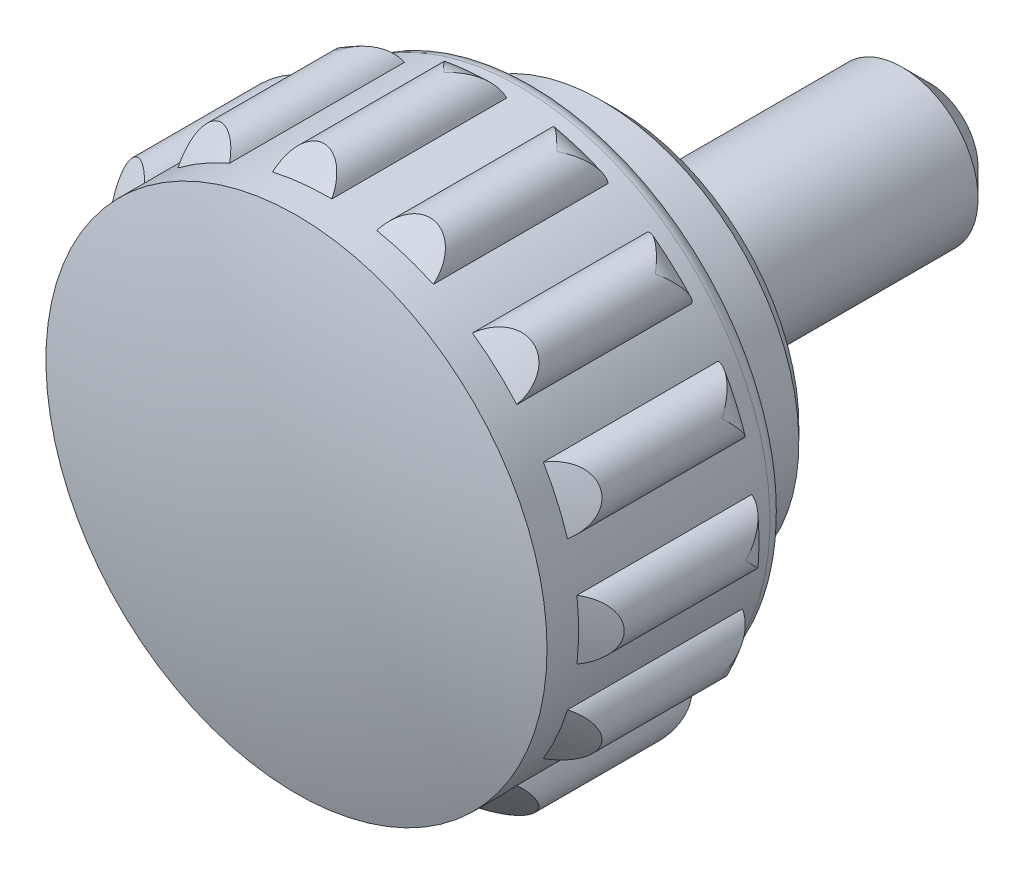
ISO-10303-21;
HEADER;
FILE_DESCRIPTION(('STEP AP214'),'2;1');
FILE_NAME('part.step','',(''),(''),'','','');
FILE_SCHEMA(('AUTOMOTIVE_DESIGN { 1 0 10303 214 1 1 1 1 }'));
ENDSEC;
DATA;
#1=APPLICATION_CONTEXT('core data for automotive mechanical design processes');
#2=APPLICATION_PROTOCOL_DEFINITION('international standard','automotive_design',2000,#1);
#3=PRODUCT_CONTEXT('',#1,'mechanical');
#4=PRODUCT('Part','Part','',(#3));
#5=PRODUCT_RELATED_PRODUCT_CATEGORY('part','',(#4));
#6=PRODUCT_DEFINITION_FORMATION('','',#4);
#7=PRODUCT_DEFINITION_CONTEXT('part definition',#1,'design');
#8=PRODUCT_DEFINITION('design','',#6,#7);
#9=PRODUCT_DEFINITION_SHAPE('','',#8);
#10=(LENGTH_UNIT() NAMED_UNIT(*) SI_UNIT(.MILLI.,.METRE.));
#11=(NAMED_UNIT(*) PLANE_ANGLE_UNIT() SI_UNIT($,.RADIAN.));
#12=(NAMED_UNIT(*) SI_UNIT($,.STERADIAN.) SOLID_ANGLE_UNIT());
#13=UNCERTAINTY_MEASURE_WITH_UNIT(LENGTH_MEASURE(1.E-05),#10,'distance_accuracy_value','');
#14=(GEOMETRIC_REPRESENTATION_CONTEXT(3) GLOBAL_UNCERTAINTY_ASSIGNED_CONTEXT((#13)) GLOBAL_UNIT_ASSIGNED_CONTEXT((#10,
#11,#12)) REPRESENTATION_CONTEXT('',''));
#15=CARTESIAN_POINT('',(0.,0.,0.));
#16=DIRECTION('',(0.,0.,1.));
#17=DIRECTION('',(1.,0.,0.));
#18=AXIS2_PLACEMENT_3D('',#15,#16,#17);
#19=CARTESIAN_POINT('',(0.,0.,5.05));
#20=DIRECTION('',(0.,0.,-1.));
#21=DIRECTION('',(0.,1.,0.));
#22=AXIS2_PLACEMENT_3D('',#19,#20,#21);
#23=TOROIDAL_SURFACE('',#22,7.95000000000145,1.04999999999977);
#24=CARTESIAN_POINT('',(7.08380552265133,4.22835383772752,4.04371119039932));
#25=CARTESIAN_POINT('',(7.13715963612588,4.24066279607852,4.05923512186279));
#26=CARTESIAN_POINT('',(7.19019720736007,4.24826583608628,4.07838353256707));
#27=CARTESIAN_POINT('',(7.29389489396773,4.25511771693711,4.12222892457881));
#28=CARTESIAN_POINT('',(7.34457379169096,4.25445129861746,4.1468670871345));
#29=CARTESIAN_POINT('',(7.45403067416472,4.24508011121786,4.20639555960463));
#30=CARTESIAN_POINT('',(7.51206178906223,4.23459858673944,4.24234509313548));
#31=CARTESIAN_POINT('',(7.62291326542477,4.20487592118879,4.31878278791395));
#32=CARTESIAN_POINT('',(7.67570733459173,4.18559306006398,4.35929186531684));
#33=CARTESIAN_POINT('',(7.79126183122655,4.13255085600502,4.45674693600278));
#34=CARTESIAN_POINT('',(7.85184584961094,4.09613730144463,4.51482067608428));
#35=CARTESIAN_POINT('',(7.96222763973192,4.01363592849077,4.63405882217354));
#36=CARTESIAN_POINT('',(8.01202766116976,3.96755013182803,4.69522258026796));
#37=CARTESIAN_POINT('',(8.09016745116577,3.87950142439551,4.8046240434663));
#38=CARTESIAN_POINT('',(8.12080039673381,3.8391127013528,4.85252342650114));
#39=CARTESIAN_POINT('',(8.17540487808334,3.75465416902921,4.94873993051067));
#40=CARTESIAN_POINT('',(8.19938824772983,3.71059108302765,4.99705614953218));
#41=CARTESIAN_POINT('',(8.2205973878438,3.66356644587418,5.04689275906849));
#42=CARTESIAN_POINT('',(8.22125503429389,3.66209888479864,5.04844640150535));
#43=CARTESIAN_POINT('',(8.22190911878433,3.6606297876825,5.05));
#44=B_SPLINE_CURVE_WITH_KNOTS('',3,(#24,#25,#26,#27,#28,#29,#30,#31,#32,#33,#34,#35,#36,#37,#38,
#39,#40,#41,#42,#43),.UNSPECIFIED.,.F.,.F.,(4,2,2,2,2,2,2,2,2,4),(0.,0.169958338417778,
0.338176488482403,0.544284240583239,0.751379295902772,1.02439161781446,1.29734693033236,
1.50618922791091,1.71465743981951,1.72136565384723),.UNSPECIFIED.);
#45=CARTESIAN_POINT('',(7.08400552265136,4.22839990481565,4.0437694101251));
#46=VERTEX_POINT('',#45);
#47=CARTESIAN_POINT('',(8.22190911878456,3.66062978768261,5.05));
#48=VERTEX_POINT('',#47);
#49=EDGE_CURVE('E554',#46,#48,#44,.T.);
#50=ORIENTED_EDGE('',*,*,#49,.T.);
#51=CARTESIAN_POINT('',(8.22190911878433,3.6606297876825,5.05));
#52=CARTESIAN_POINT('',(8.22256319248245,3.6591607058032,5.04844641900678));
#53=CARTESIAN_POINT('',(8.22321375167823,3.65768998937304,5.04689277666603));
#54=CARTESIAN_POINT('',(8.25445272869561,3.58660548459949,4.97188045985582));
#55=CARTESIAN_POINT('',(8.27717361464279,3.51336492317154,4.89830525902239));
#56=CARTESIAN_POINT('',(8.30551077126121,3.36186236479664,4.75269918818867));
#57=CARTESIAN_POINT('',(8.31108777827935,3.28358925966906,4.68067223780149));
#58=CARTESIAN_POINT('',(8.30408516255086,3.14318728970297,4.5568524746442));
#59=CARTESIAN_POINT('',(8.29544586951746,3.08156271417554,4.50426622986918));
#60=CARTESIAN_POINT('',(8.26577136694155,2.95829302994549,4.40271591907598));
#61=CARTESIAN_POINT('',(8.24475510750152,2.89664809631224,4.3537464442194));
#62=CARTESIAN_POINT('',(8.19605583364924,2.79076923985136,4.27315471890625));
#63=CARTESIAN_POINT('',(8.17141792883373,2.74608669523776,4.24028379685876));
#64=CARTESIAN_POINT('',(8.113963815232,2.65916047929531,4.17894644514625));
#65=CARTESIAN_POINT('',(8.08117715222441,2.61690866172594,4.1504646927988));
#66=CARTESIAN_POINT('',(8.02060284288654,2.55109587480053,4.10870681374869));
#67=CARTESIAN_POINT('',(7.99533575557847,2.52632713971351,4.09366841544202));
#68=CARTESIAN_POINT('',(7.94132570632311,2.47887007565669,4.06640469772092));
#69=CARTESIAN_POINT('',(7.91256783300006,2.45619145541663,4.05419214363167));
#70=CARTESIAN_POINT('',(7.88215305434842,2.43489025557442,4.04367058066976));
#71=B_SPLINE_CURVE_WITH_KNOTS('',3,(#51,#52,#53,#54,#55,#56,#57,#58,#59,#60,#61,#62,#63,#64,#65,
#66,#67,#68,#69,#70),.UNSPECIFIED.,.F.,.F.,(4,2,2,2,2,2,2,2,2,4),(0.,0.00670821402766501,
0.323872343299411,0.641762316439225,0.885326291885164,1.12851831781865,1.30999751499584,
1.49082806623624,1.60587369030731,1.72142928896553),.UNSPECIFIED.);
#72=CARTESIAN_POINT('',(7.88243842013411,2.43509025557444,4.04376941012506));
#73=VERTEX_POINT('',#72);
#74=EDGE_CURVE('E559',#48,#73,#71,.T.);
#75=ORIENTED_EDGE('',*,*,#74,.T.);
#76=CARTESIAN_POINT('',(0.,0.,4.04376941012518));
#77=DIRECTION('',(0.,0.,-1.));
#78=DIRECTION('',(0.,1.,0.));
#79=AXIS2_PLACEMENT_3D('',#76,#77,#78);
#80=CIRCLE('',#79,8.2500000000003);
#81=EDGE_CURVE('E626',#46,#73,#80,.T.);
#82=ORIENTED_EDGE('',*,*,#81,.F.);
#83=EDGE_LOOP('',(#50,#75,#82));
#84=FACE_BOUND('',#83,.T.);
#85=ADVANCED_FACE('F14',(#84),#23,.T.);
#86=CARTESIAN_POINT('',(4.75151588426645,6.74400959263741,4.0436984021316));
#87=CARTESIAN_POINT('',(4.79524813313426,6.77695656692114,4.0592197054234));
#88=CARTESIAN_POINT('',(4.84060548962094,6.80547607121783,4.07836547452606));
#89=CARTESIAN_POINT('',(4.93254668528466,6.85391663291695,4.12220566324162));
#90=CARTESIAN_POINT('',(4.9791132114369,6.87392273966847,4.14684126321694));
#91=CARTESIAN_POINT('',(5.0829139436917,6.90988630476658,4.20636378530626));
#92=CARTESIAN_POINT('',(5.14018861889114,6.92391705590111,4.24230988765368));
#93=CARTESIAN_POINT('',(5.25354112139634,6.94185740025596,4.31874081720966));
#94=CARTESIAN_POINT('',(5.30961190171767,6.94571819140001,4.35924656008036));
#95=CARTESIAN_POINT('',(5.43674685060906,6.94427007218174,4.45669448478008));
#96=CARTESIAN_POINT('',(5.50690251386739,6.93565123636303,4.51476450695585));
#97=CARTESIAN_POINT('',(5.64129594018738,6.90518894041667,4.63399556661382));
#98=CARTESIAN_POINT('',(5.70553493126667,6.88334823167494,4.69515595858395));
#99=CARTESIAN_POINT('',(5.81274535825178,6.83469761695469,4.80456540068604));
#100=CARTESIAN_POINT('',(5.85717005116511,6.81025652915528,4.85247632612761));
#101=CARTESIAN_POINT('',(5.94142902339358,6.75529895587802,4.94871623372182));
#102=CARTESIAN_POINT('',(5.98127138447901,6.72479343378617,4.99704431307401));
#103=CARTESIAN_POINT('',(6.01978268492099,6.69045267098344,5.04689275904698));
#104=CARTESIAN_POINT('',(6.02098038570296,6.68937947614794,5.04844640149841));
#105=CARTESIAN_POINT('',(6.02217545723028,6.68830342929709,5.05));
#106=B_SPLINE_CURVE_WITH_KNOTS('',3,(#86,#87,#88,#89,#90,#91,#92,#93,#94,#95,#96,#97,#98,#99,
#100,#101,#102,#103,#104,#105),.UNSPECIFIED.,.F.,.F.,(4,2,2,2,2,2,2,2,2,4),(0.,
0.169952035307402,0.338163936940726,0.544261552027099,0.751346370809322,1.02434724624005,
1.29729133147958,1.50618490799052,1.71470422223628,1.721412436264),.UNSPECIFIED.);
#107=CARTESIAN_POINT('',(4.75171588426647,6.7441601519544,4.0437694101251));
#108=VERTEX_POINT('',#107);
#109=CARTESIAN_POINT('',(6.02217545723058,6.68830342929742,5.05));
#110=VERTEX_POINT('',#109);
#111=EDGE_CURVE('E520',#108,#110,#106,.T.);
#112=ORIENTED_EDGE('',*,*,#111,.T.);
#113=CARTESIAN_POINT('',(6.02217545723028,6.68830342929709,5.05));
#114=CARTESIAN_POINT('',(6.02337051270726,6.6872273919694,5.04844641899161));
#115=CARTESIAN_POINT('',(6.02456302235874,6.686148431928,5.04689277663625));
#116=CARTESIAN_POINT('',(6.08201391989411,6.63391554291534,4.97188045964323));
#117=CARTESIAN_POINT('',(6.13256010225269,6.57624837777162,4.89830525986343));
#118=CARTESIAN_POINT('',(6.22006902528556,6.44936966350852,4.75269918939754));
#119=CARTESIAN_POINT('',(6.25700041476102,6.38013199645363,4.68067223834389));
#120=CARTESIAN_POINT('',(6.30770983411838,6.24902019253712,4.55685247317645));
#121=CARTESIAN_POINT('',(6.32488242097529,6.18920942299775,4.50426622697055));
#122=CARTESIAN_POINT('',(6.34791170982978,6.06452725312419,4.40271591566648));
#123=CARTESIAN_POINT('',(6.35378565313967,5.9996637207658,4.3537464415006));
#124=CARTESIAN_POINT('',(6.35236146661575,5.88313080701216,4.27315472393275));
#125=CARTESIAN_POINT('',(6.3480276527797,5.83229014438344,4.24028380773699));
#126=CARTESIAN_POINT('',(6.33089677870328,5.72951038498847,4.17894644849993));
#127=CARTESIAN_POINT('',(6.31813002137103,5.6775758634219,4.15046468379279));
#128=CARTESIAN_POINT('',(6.28956685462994,5.59283212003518,4.10871518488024));
#129=CARTESIAN_POINT('',(6.27656627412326,5.55994466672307,4.09368393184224));
#130=CARTESIAN_POINT('',(6.24654782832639,5.49465585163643,4.06643139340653));
#131=CARTESIAN_POINT('',(6.22951243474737,5.4622572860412,4.05422284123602));
#132=CARTESIAN_POINT('',(6.21040533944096,5.43044218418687,4.04370324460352));
#133=B_SPLINE_CURVE_WITH_KNOTS('',3,(#113,#114,#115,#116,#117,#118,#119,#120,#121,#122,#123,
#124,#125,#126,#127,#128,#129,#130,#131,#132),.UNSPECIFIED.,.F.,.F.,(4,2,2,2,2,2,2,2,2,4),(0.,
0.00670821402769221,0.323872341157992,0.641762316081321,0.885326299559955,1.1285183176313,
1.30999749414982,1.49082806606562,1.60581443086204,1.72130979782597),.UNSPECIFIED.);
#134=CARTESIAN_POINT('',(6.21052537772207,5.43064218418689,4.04376941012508));
#135=VERTEX_POINT('',#134);
#136=EDGE_CURVE('E542',#110,#135,#133,.T.);
#137=ORIENTED_EDGE('',*,*,#136,.T.);
#138=EDGE_CURVE('E632',#108,#135,#80,.T.);
#139=ORIENTED_EDGE('',*,*,#138,.F.);
#140=EDGE_LOOP('',(#112,#137,#139));
#141=FACE_BOUND('',#140,.T.);
#142=ADVANCED_FACE('F332',(#141),#23,.T.);
#143=CARTESIAN_POINT('',(1.59761140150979,8.0934333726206,4.043652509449));
#144=CARTESIAN_POINT('',(1.62415173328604,8.14131919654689,4.05916437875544));
#145=CARTESIAN_POINT('',(1.6539776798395,8.18582277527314,4.07830066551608));
#146=CARTESIAN_POINT('',(1.71824804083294,8.26747596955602,4.12212217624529));
#147=CARTESIAN_POINT('',(1.7526420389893,8.30469621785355,4.14674857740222));
#148=CARTESIAN_POINT('',(1.83281908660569,8.37977782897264,4.20624973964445));
#149=CARTESIAN_POINT('',(1.87942276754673,8.41589637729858,4.24218352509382));
#150=CARTESIAN_POINT('',(1.97565441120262,8.47840316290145,4.3185901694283));
#151=CARTESIAN_POINT('',(2.0252957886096,8.50474397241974,4.35908394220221));
#152=CARTESIAN_POINT('',(2.14200489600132,8.55515286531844,4.45650621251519));
#153=CARTESIAN_POINT('',(2.20958945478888,8.57582806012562,4.51456288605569));
#154=CARTESIAN_POINT('',(2.34473374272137,8.60269288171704,4.63376850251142));
#155=CARTESIAN_POINT('',(2.41229347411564,8.6088854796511,4.69491680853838));
#156=CARTESIAN_POINT('',(2.53006225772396,8.6080788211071,4.80435488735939));
#157=CARTESIAN_POINT('',(2.58063381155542,8.60382611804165,4.85230724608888));
#158=CARTESIAN_POINT('',(2.68005196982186,8.58789010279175,4.94863116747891));
#159=CARTESIAN_POINT('',(2.72890150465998,8.57622012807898,4.99700182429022));
#160=CARTESIAN_POINT('',(2.77809286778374,8.56049884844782,5.04689275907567));
#161=CARTESIAN_POINT('',(2.77962352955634,8.56000558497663,5.04844640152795));
#162=CARTESIAN_POINT('',(2.78115294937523,8.55950864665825,5.05));
#163=B_SPLINE_CURVE_WITH_KNOTS('',3,(#143,#144,#145,#146,#147,#148,#149,#150,#151,#152,#153,
#154,#155,#156,#157,#158,#159,#160,#161,#162),.UNSPECIFIED.,.F.,.F.,(4,2,2,2,2,2,2,2,2,4),(0.,
0.169929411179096,0.338118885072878,0.544180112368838,0.751228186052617,1.02418796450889,
1.29709173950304,1.50616939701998,1.71487215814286,1.7215803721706),.UNSPECIFIED.);
#164=CARTESIAN_POINT('',(1.59781140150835,8.09379384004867,4.0437694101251));
#165=VERTEX_POINT('',#164);
#166=CARTESIAN_POINT('',(2.78115294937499,8.55950864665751,5.05));
#167=VERTEX_POINT('',#166);
#168=EDGE_CURVE('E789',#165,#167,#163,.T.);
#169=ORIENTED_EDGE('',*,*,#168,.T.);
#170=CARTESIAN_POINT('',(2.78115294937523,8.55950864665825,5.05));
#171=CARTESIAN_POINT('',(2.78268235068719,8.55901171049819,5.04844641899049));
#172=CARTESIAN_POINT('',(2.78421061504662,8.55851106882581,5.04689277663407));
#173=CARTESIAN_POINT('',(2.85793965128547,8.53416133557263,4.97188045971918));
#174=CARTESIAN_POINT('',(2.9275712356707,8.5020387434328,4.89830526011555));
#175=CARTESIAN_POINT('',(3.059120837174,8.42172235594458,4.75269918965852));
#176=CARTESIAN_POINT('',(3.12102083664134,8.37349194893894,4.68067223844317));
#177=CARTESIAN_POINT('',(3.22067417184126,8.2743407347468,4.5568524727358));
#178=CARTESIAN_POINT('',(3.26068934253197,8.22668559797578,4.50426622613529));
#179=CARTESIAN_POINT('',(3.3324404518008,8.1221496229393,4.40271591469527));
#180=CARTESIAN_POINT('',(3.36418894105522,8.06528298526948,4.35374644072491));
#181=CARTESIAN_POINT('',(3.41028608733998,7.95824560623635,4.27315472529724));
#182=CARTESIAN_POINT('',(3.42700571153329,7.91003763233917,4.2402838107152));
#183=CARTESIAN_POINT('',(3.45316017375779,7.80917589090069,4.17894644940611));
#184=CARTESIAN_POINT('',(3.46262083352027,7.75653862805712,4.1504646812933));
#185=CARTESIAN_POINT('',(3.47099500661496,7.66750861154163,4.10871749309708));
#186=CARTESIAN_POINT('',(3.47249495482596,7.63218175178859,4.09368821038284));
#187=CARTESIAN_POINT('',(3.47162831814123,7.56033842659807,4.06643875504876));
#188=CARTESIAN_POINT('',(3.46924459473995,7.52381738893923,4.05423130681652));
#189=CARTESIAN_POINT('',(3.46473162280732,7.48698674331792,4.04371225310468));
#190=B_SPLINE_CURVE_WITH_KNOTS('',3,(#170,#171,#172,#173,#174,#175,#176,#177,#178,#179,#180,
#181,#182,#183,#184,#185,#186,#187,#188,#189),.UNSPECIFIED.,.F.,.F.,(4,2,2,2,2,2,2,2,2,4),(0.,
0.00670821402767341,0.323872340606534,0.641762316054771,0.885326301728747,1.12851831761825,
1.30999748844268,1.49082806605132,1.60579809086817,1.721276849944),.UNSPECIFIED.);
#191=CARTESIAN_POINT('',(3.46475607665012,7.48718674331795,4.04376941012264));
#192=VERTEX_POINT('',#191);
#193=EDGE_CURVE('E521',#167,#192,#190,.T.);
#194=ORIENTED_EDGE('',*,*,#193,.T.);
#195=EDGE_CURVE('E292',#165,#192,#80,.T.);
#196=ORIENTED_EDGE('',*,*,#195,.F.);
#197=EDGE_LOOP('',(#169,#194,#196));
#198=FACE_BOUND('',#197,.T.);
#199=ADVANCED_FACE('F340',(#198),#23,.T.);
#200=CARTESIAN_POINT('',(-1.8323691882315,8.04393704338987,4.0437694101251));
#201=VERTEX_POINT('',#200);
#202=CARTESIAN_POINT('',(0.119898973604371,8.24912869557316,4.043769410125));
#203=VERTEX_POINT('',#202);
#204=EDGE_CURVE('E288',#201,#203,#80,.T.);
#205=ORIENTED_EDGE('',*,*,#204,.F.);
#206=CARTESIAN_POINT('',(-1.83238678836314,8.04373704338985,4.04371245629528));
#207=CARTESIAN_POINT('',(-1.827605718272,8.0982836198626,4.05923664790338));
#208=CARTESIAN_POINT('',(-1.81844685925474,8.1510748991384,4.07838532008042));
#209=CARTESIAN_POINT('',(-1.79291849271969,8.2518147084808,4.12223122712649));
#210=CARTESIAN_POINT('',(-1.776623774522,8.29980728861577,4.14686964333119));
#211=CARTESIAN_POINT('',(-1.73388656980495,8.40101116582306,4.20639870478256));
#212=CARTESIAN_POINT('',(-1.70598507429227,8.45296307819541,4.24234857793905));
#213=CARTESIAN_POINT('',(-1.64346140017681,8.54920423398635,4.31878694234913));
#214=CARTESIAN_POINT('',(-1.60880766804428,8.59345557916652,4.35929634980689));
#215=CARTESIAN_POINT('',(-1.52265240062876,8.6869632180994,4.45675212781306));
#216=CARTESIAN_POINT('',(-1.46929911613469,8.73332941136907,4.51482623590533));
#217=CARTESIAN_POINT('',(-1.35672494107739,8.81281385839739,4.63406508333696));
#218=CARTESIAN_POINT('',(-1.29750527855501,8.845934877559,4.6952291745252));
#219=CARTESIAN_POINT('',(-1.18962009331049,8.8930404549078,4.80462984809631));
#220=CARTESIAN_POINT('',(-1.14174313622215,8.90969263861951,4.85252808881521));
#221=CARTESIAN_POINT('',(-1.04454687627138,8.93552447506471,4.94874227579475));
#222=CARTESIAN_POINT('',(-0.995230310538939,8.94471745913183,4.99705732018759));
#223=CARTESIAN_POINT('',(-0.943954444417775,8.95035700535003,5.04689275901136));
#224=CARTESIAN_POINT('',(-0.942355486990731,8.95052896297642,5.04844640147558));
#225=CARTESIAN_POINT('',(-0.940756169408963,8.95069705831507,5.05));
#226=B_SPLINE_CURVE_WITH_KNOTS('',3,(#206,#207,#208,#209,#210,#211,#212,#213,#214,#215,#216,
#217,#218,#219,#220,#221,#222,#223,#224,#225),.UNSPECIFIED.,.F.,.F.,(4,2,2,2,2,2,2,2,2,4),(0.,
0.169958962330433,0.338177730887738,0.544286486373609,0.7513825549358,1.0243960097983,
1.29735243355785,1.50618965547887,1.71465280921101,1.72136102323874),.UNSPECIFIED.);
#227=CARTESIAN_POINT('',(-0.940756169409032,8.95069705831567,5.05));
#228=VERTEX_POINT('',#227);
#229=EDGE_CURVE('E790',#201,#228,#226,.T.);
#230=ORIENTED_EDGE('',*,*,#229,.T.);
#231=CARTESIAN_POINT('',(-0.940756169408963,8.95069705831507,5.05));
#232=CARTESIAN_POINT('',(-0.939156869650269,8.95086514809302,5.04844641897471));
#233=CARTESIAN_POINT('',(-0.937557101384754,8.95102939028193,5.04689277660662));
#234=CARTESIAN_POINT('',(-0.860300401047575,8.95877289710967,4.97188245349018));
#235=CARTESIAN_POINT('',(-0.783625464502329,8.95774943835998,4.89830926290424));
#236=CARTESIAN_POINT('',(-0.630781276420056,8.93788375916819,4.75270310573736));
#237=CARTESIAN_POINT('',(-0.554613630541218,8.9189997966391,4.68067415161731));
#238=CARTESIAN_POINT('',(-0.423233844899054,8.86894826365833,4.55684166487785));
#239=CARTESIAN_POINT('',(-0.367284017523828,8.84168225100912,4.50424505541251));
#240=CARTESIAN_POINT('',(-0.259218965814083,8.77536263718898,4.40269611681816));
#241=CARTESIAN_POINT('',(-0.207096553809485,8.73633187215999,4.35373695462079));
#242=CARTESIAN_POINT('',(-0.121490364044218,8.65733692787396,4.2731845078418));
#243=CARTESIAN_POINT('',(-0.0866370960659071,8.62013321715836,4.24034084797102));
#244=CARTESIAN_POINT('',(-0.0217109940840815,8.53863931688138,4.1789954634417));
#245=CARTESIAN_POINT('',(0.00837058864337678,8.4943624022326,4.15048579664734));
#246=CARTESIAN_POINT('',(0.0523429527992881,8.41624413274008,4.10863395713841));
#247=CARTESIAN_POINT('',(0.0681557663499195,8.38441580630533,4.0935342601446));
#248=CARTESIAN_POINT('',(0.0966180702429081,8.3182437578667,4.06625125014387));
#249=CARTESIAN_POINT('',(0.10927253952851,8.28390410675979,4.05406334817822));
#250=CARTESIAN_POINT('',(0.131910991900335,8.20982091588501,4.03213326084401));
#251=CARTESIAN_POINT('',(0.141546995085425,8.16987001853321,4.02271472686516));
#252=CARTESIAN_POINT('',(0.152310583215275,8.10858344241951,4.01205542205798));
#253=CARTESIAN_POINT('',(0.155287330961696,8.08785118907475,4.00907603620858));
#254=CARTESIAN_POINT('',(0.159943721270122,8.04609002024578,4.00434271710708));
#255=CARTESIAN_POINT('',(0.161622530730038,8.02506092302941,4.0025895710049));
#256=CARTESIAN_POINT('',(0.162630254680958,8.00395354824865,4.00147340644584));
#257=B_SPLINE_CURVE_WITH_KNOTS('',3,(#231,#232,#233,#234,#235,#236,#237,#238,#239,#240,#241,
#242,#243,#244,#245,#246,#247,#248,#249,#250,#251,#252,#253,#254,#255,#256),.UNSPECIFIED.,.F.,
.F.,(4,2,2,2,2,2,2,2,2,2,2,2,4),(0.,0.00670821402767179,0.323863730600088,0.641762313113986,
0.885375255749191,1.12851834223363,1.3098413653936,1.49082799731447,1.60639403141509,
1.72177671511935,1.84766325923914,1.91106210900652,1.97450161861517),.UNSPECIFIED.);
#258=EDGE_CURVE('E796',#228,#203,#257,.T.);
#259=ORIENTED_EDGE('',*,*,#258,.T.);
#260=EDGE_LOOP('',(#205,#230,#259));
#261=FACE_BOUND('',#260,.T.);
#262=ADVANCED_FACE('F836',(#261),#23,.T.);
#263=CARTESIAN_POINT('',(-4.94564774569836,6.60301045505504,4.04370941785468));
#264=CARTESIAN_POINT('',(-4.96346655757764,6.65478535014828,4.05923298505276));
#265=CARTESIAN_POINT('',(-4.97657217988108,6.70673738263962,4.07838102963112));
#266=CARTESIAN_POINT('',(-4.99422652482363,6.80915034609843,4.12222570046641));
#267=CARTESIAN_POINT('',(-4.99886148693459,6.85962109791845,4.1468635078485));
#268=CARTESIAN_POINT('',(-5.00098378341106,6.96945748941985,4.20639115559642));
#269=CARTESIAN_POINT('',(-4.99662605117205,7.02826609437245,4.24234021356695));
#270=CARTESIAN_POINT('',(-4.9786543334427,7.14161682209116,4.31877697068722));
#271=CARTESIAN_POINT('',(-4.96499610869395,7.19613715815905,4.35928558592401));
#272=CARTESIAN_POINT('',(-4.92432442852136,7.31660293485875,4.45673966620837));
#273=CARTESIAN_POINT('',(-4.89444380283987,7.38066135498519,4.51481289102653));
#274=CARTESIAN_POINT('',(-4.82393382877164,7.49906241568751,4.63405005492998));
#275=CARTESIAN_POINT('',(-4.78330672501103,7.55340708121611,4.69521334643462));
#276=CARTESIAN_POINT('',(-4.7039080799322,7.64032434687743,4.80461591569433));
#277=CARTESIAN_POINT('',(-4.66694160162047,7.67501274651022,4.8525168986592));
#278=CARTESIAN_POINT('',(-4.58865109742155,7.73814899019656,4.94873664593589));
#279=CARTESIAN_POINT('',(-4.54733499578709,7.76660790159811,4.99705450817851));
#280=CARTESIAN_POINT('',(-4.50278345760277,7.79261712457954,5.04689275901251));
#281=CARTESIAN_POINT('',(-4.50139267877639,7.7934245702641,5.04844640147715));
#282=CARTESIAN_POINT('',(-4.50000000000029,7.79422863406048,5.05));
#283=B_SPLINE_CURVE_WITH_KNOTS('',3,(#263,#264,#265,#266,#267,#268,#269,#270,#271,#272,#273,
#274,#275,#276,#277,#278,#279,#280,#281,#282),.UNSPECIFIED.,.F.,.F.,(4,2,2,2,2,2,2,2,2,4),(0.,
0.16995746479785,0.338174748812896,0.544281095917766,0.751374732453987,1.02438546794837,
1.29733922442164,1.50618862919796,1.71466392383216,1.72137213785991),.UNSPECIFIED.);
#284=CARTESIAN_POINT('',(-4.94571649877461,6.60321045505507,4.0437694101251));
#285=VERTEX_POINT('',#284);
#286=CARTESIAN_POINT('',(-4.5000000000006,7.79422863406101,5.05));
#287=VERTEX_POINT('',#286);
#288=EDGE_CURVE('E820',#285,#287,#283,.T.);
#289=ORIENTED_EDGE('',*,*,#288,.T.);
#290=CARTESIAN_POINT('',(-4.50000000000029,7.79422863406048,5.05));
#291=CARTESIAN_POINT('',(-4.49860733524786,7.79503268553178,5.04844641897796));
#292=CARTESIAN_POINT('',(-4.49721267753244,7.79583341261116,5.04689277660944));
#293=CARTESIAN_POINT('',(-4.42978294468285,7.83433161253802,4.97188045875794));
#294=CARTESIAN_POINT('',(-4.35931858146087,7.86458375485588,4.89830525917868));
#295=CARTESIAN_POINT('',(-4.21160800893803,7.90860200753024,4.75269918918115));
#296=CARTESIAN_POINT('',(-4.13434664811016,7.92233023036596,4.68067223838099));
#297=CARTESIAN_POINT('',(-3.99398184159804,7.93004197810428,4.55685247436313));
#298=CARTESIAN_POINT('',(-3.93179179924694,7.92789153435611,4.50426622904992));
#299=CARTESIAN_POINT('',(-3.80609556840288,7.911264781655,4.40271591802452));
#300=CARTESIAN_POINT('',(-3.74259153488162,7.8968073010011,4.35374644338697));
#301=CARTESIAN_POINT('',(-3.63220223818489,7.85944216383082,4.27315472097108));
#302=CARTESIAN_POINT('',(-3.5851891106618,7.83960982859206,4.24028380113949));
#303=CARTESIAN_POINT('',(-3.49273349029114,7.79155671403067,4.17894644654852));
#304=CARTESIAN_POINT('',(-3.44728598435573,7.76336616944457,4.15046468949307));
#305=CARTESIAN_POINT('',(-3.37550746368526,7.71000707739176,4.1087099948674));
#306=CARTESIAN_POINT('',(-3.34823851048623,7.68747221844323,4.09367431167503));
#307=CARTESIAN_POINT('',(-3.29540553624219,7.63872966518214,4.06641484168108));
#308=CARTESIAN_POINT('',(-3.26984960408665,7.61250614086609,4.05420380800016));
#309=CARTESIAN_POINT('',(-3.24548975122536,7.58449149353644,4.04368299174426));
#310=B_SPLINE_CURVE_WITH_KNOTS('',3,(#290,#291,#292,#293,#294,#295,#296,#297,#298,#299,#300,
#301,#302,#303,#304,#305,#306,#307,#308,#309),.UNSPECIFIED.,.F.,.F.,(4,2,2,2,2,2,2,2,2,4),(0.,
0.00670821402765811,0.323872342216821,0.641762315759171,0.885326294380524,1.12851831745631,
1.30999750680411,1.49082806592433,1.60585117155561,1.72138388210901),.UNSPECIFIED.);
#311=CARTESIAN_POINT('',(-3.24568975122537,7.58472135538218,4.04376941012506));
#312=VERTEX_POINT('',#311);
#313=EDGE_CURVE('E826',#287,#312,#310,.T.);
#314=ORIENTED_EDGE('',*,*,#313,.T.);
#315=EDGE_CURVE('E291',#285,#312,#80,.T.);
#316=ORIENTED_EDGE('',*,*,#315,.F.);
#317=EDGE_LOOP('',(#289,#314,#316));
#318=FACE_BOUND('',#317,.T.);
#319=ADVANCED_FACE('F838',(#318),#23,.T.);
#320=CARTESIAN_POINT('',(-7.20371816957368,4.02052879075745,4.04369187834));
#321=CARTESIAN_POINT('',(-7.24105634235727,4.06057616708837,4.05921184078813));
#322=CARTESIAN_POINT('',(-7.27416135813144,4.10270263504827,4.07835626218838));
#323=CARTESIAN_POINT('',(-7.33194852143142,4.18907431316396,4.12219379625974));
#324=CARTESIAN_POINT('',(-7.35671344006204,4.23329341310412,4.14682808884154));
#325=CARTESIAN_POINT('',(-7.40333212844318,4.33276367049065,4.20634757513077));
#326=CARTESIAN_POINT('',(-7.42327409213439,4.38825650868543,4.24229192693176));
#327=CARTESIAN_POINT('',(-7.45296751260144,4.49911009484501,4.31871940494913));
#328=CARTESIAN_POINT('',(-7.46266970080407,4.55446893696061,4.35922344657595));
#329=CARTESIAN_POINT('',(-7.47452265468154,4.68105656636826,4.45666772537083));
#330=CARTESIAN_POINT('',(-7.47328669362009,4.7517278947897,4.51473585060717));
#331=CARTESIAN_POINT('',(-7.45704426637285,4.8885678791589,4.63396329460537));
#332=CARTESIAN_POINT('',(-7.44204065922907,4.95473746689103,4.6951219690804));
#333=CARTESIAN_POINT('',(-7.40486563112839,5.06645263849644,4.80453548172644));
#334=CARTESIAN_POINT('',(-7.38520087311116,5.11319531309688,4.85245229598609));
#335=CARTESIAN_POINT('',(-7.33934771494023,5.20274952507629,4.94870414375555));
#336=CARTESIAN_POINT('',(-7.31317106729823,5.24556795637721,4.99703827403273));
#337=CARTESIAN_POINT('',(-7.28304030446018,5.28746294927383,5.04689275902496));
#338=CARTESIAN_POINT('',(-7.28209818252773,5.28876626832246,5.0484464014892));
#339=CARTESIAN_POINT('',(-7.28115294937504,5.29006727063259,5.05));
#340=B_SPLINE_CURVE_WITH_KNOTS('',3,(#320,#321,#322,#323,#324,#325,#326,#327,#328,#329,#330,
#331,#332,#333,#334,#335,#336,#337,#338,#339),.UNSPECIFIED.,.F.,.F.,(4,2,2,2,2,2,2,2,2,4),(0.,
0.169948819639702,0.338157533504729,0.54424997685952,0.751329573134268,1.02432460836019,
1.2972629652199,1.5061827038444,1.714728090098,1.72143630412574),.UNSPECIFIED.);
#341=CARTESIAN_POINT('',(-7.20390449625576,4.02072879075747,4.0437694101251));
#342=VERTEX_POINT('',#341);
#343=CARTESIAN_POINT('',(-7.28115294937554,5.29006727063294,5.05));
#344=VERTEX_POINT('',#343);
#345=EDGE_CURVE('E1370',#342,#344,#340,.T.);
#346=ORIENTED_EDGE('',*,*,#345,.T.);
#347=CARTESIAN_POINT('',(-7.28115294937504,5.29006727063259,5.05));
#348=CARTESIAN_POINT('',(-7.28020772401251,5.2913682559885,5.04844641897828));
#349=CARTESIAN_POINT('',(-7.27925932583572,5.29266701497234,5.04689277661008));
#350=CARTESIAN_POINT('',(-7.23331782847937,5.35526301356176,4.97188045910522));
#351=CARTESIAN_POINT('',(-7.1812500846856,5.41156015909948,4.89830525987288));
#352=CARTESIAN_POINT('',(-7.06421359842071,5.51185213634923,4.7526991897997));
#353=CARTESIAN_POINT('',(-6.99921560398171,5.55581851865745,4.68067223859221));
#354=CARTESIAN_POINT('',(-6.87412262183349,5.61995506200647,4.55685247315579));
#355=CARTESIAN_POINT('',(-6.81643452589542,5.64328550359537,4.50426622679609));
#356=CARTESIAN_POINT('',(-6.69484259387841,5.67922147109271,4.40271591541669));
#357=CARTESIAN_POINT('',(-6.63094838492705,5.69184332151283,4.35374644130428));
#358=CARTESIAN_POINT('',(-6.51490498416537,5.70260794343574,4.27315472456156));
#359=CARTESIAN_POINT('',(-6.46388982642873,5.70361216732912,4.24028380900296));
#360=CARTESIAN_POINT('',(-6.35988243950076,5.69731854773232,4.17894644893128));
#361=CARTESIAN_POINT('',(-6.30689792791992,5.69005036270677,4.15046468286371));
#362=CARTESIAN_POINT('',(-6.21963467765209,5.6705022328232,4.10871610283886));
#363=CARTESIAN_POINT('',(-6.18557039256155,5.66101119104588,4.09368563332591));
#364=CARTESIAN_POINT('',(-6.11750530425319,5.63798349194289,4.0664343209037));
#365=CARTESIAN_POINT('',(-6.0835054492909,5.62442911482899,4.05422620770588));
#366=CARTESIAN_POINT('',(-6.04986923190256,5.608753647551,4.04370682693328));
#367=B_SPLINE_CURVE_WITH_KNOTS('',3,(#347,#348,#349,#350,#351,#352,#353,#354,#355,#356,#357,
#358,#359,#360,#361,#362,#363,#364,#365,#366),.UNSPECIFIED.,.F.,.F.,(4,2,2,2,2,2,2,2,2,4),(0.,
0.00670821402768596,0.323872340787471,0.641762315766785,0.885326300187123,1.12851831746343,
1.3099974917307,1.49082806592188,1.60580793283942,1.72129669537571),.UNSPECIFIED.);
#368=CARTESIAN_POINT('',(-6.0500692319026,5.60884678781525,4.04376941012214));
#369=VERTEX_POINT('',#368);
#370=EDGE_CURVE('E1373',#344,#369,#367,.T.);
#371=ORIENTED_EDGE('',*,*,#370,.T.);
#372=EDGE_CURVE('E651',#342,#369,#80,.T.);
#373=ORIENTED_EDGE('',*,*,#372,.F.);
#374=EDGE_LOOP('',(#346,#371,#373));
#375=FACE_BOUND('',#374,.T.);
#376=ADVANCED_FACE('F844',(#375),#23,.T.);
#377=CARTESIAN_POINT('',(-8.21600125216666,0.742826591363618,4.0436244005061));
#378=CARTESIAN_POINT('',(-8.26639816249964,0.764209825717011,4.0591304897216));
#379=CARTESIAN_POINT('',(-8.31377569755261,0.789214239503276,4.07826096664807));
#380=CARTESIAN_POINT('',(-8.40170127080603,0.84458522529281,4.12207103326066));
#381=CARTESIAN_POINT('',(-8.44231427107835,0.87489427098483,4.14669179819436));
#382=CARTESIAN_POINT('',(-8.52536864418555,0.946770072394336,4.20617987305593));
#383=CARTESIAN_POINT('',(-8.56616305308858,0.989335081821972,4.24210611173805));
#384=CARTESIAN_POINT('',(-8.63839265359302,1.07849035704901,4.31849787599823));
#385=CARTESIAN_POINT('',(-8.6697820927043,1.12509892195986,4.35898431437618));
#386=CARTESIAN_POINT('',(-8.7321257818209,1.23588385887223,4.45639086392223));
#387=CARTESIAN_POINT('',(-8.75976003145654,1.30092917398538,4.51443935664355));
#388=CARTESIAN_POINT('',(-8.80062155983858,1.43251061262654,4.63362937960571));
#389=CARTESIAN_POINT('',(-8.81385176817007,1.49904643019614,4.69477027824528));
#390=CARTESIAN_POINT('',(-8.82538142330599,1.61627624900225,4.80422589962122));
#391=CARTESIAN_POINT('',(-8.82644494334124,1.66704322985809,4.85220364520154));
#392=CARTESIAN_POINT('',(-8.82099346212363,1.76763774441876,4.94857904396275));
#393=CARTESIAN_POINT('',(-8.81449205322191,1.81746680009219,4.99697578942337));
#394=CARTESIAN_POINT('',(-8.80399331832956,1.8680583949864,5.04689275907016));
#395=CARTESIAN_POINT('',(-8.80366275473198,1.86963223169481,5.04844640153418));
#396=CARTESIAN_POINT('',(-8.80332840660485,1.87120521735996,5.05));
#397=B_SPLINE_CURVE_WITH_KNOTS('',3,(#377,#378,#379,#380,#381,#382,#383,#384,#385,#386,#387,
#388,#389,#390,#391,#392,#393,#394,#395,#396),.UNSPECIFIED.,.F.,.F.,(4,2,2,2,2,2,2,2,2,4),(0.,
0.169915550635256,0.338091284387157,0.544130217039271,0.75115577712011,1.02409036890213,
1.29696943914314,1.50615989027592,1.71497505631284,1.72168327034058),.UNSPECIFIED.);
#398=CARTESIAN_POINT('',(-8.21647196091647,0.743026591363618,4.0437694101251));
#399=VERTEX_POINT('',#398);
#400=CARTESIAN_POINT('',(-8.80332840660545,1.87120521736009,5.05));
#401=VERTEX_POINT('',#400);
#402=EDGE_CURVE('E1354',#399,#401,#397,.T.);
#403=ORIENTED_EDGE('',*,*,#402,.T.);
#404=CARTESIAN_POINT('',(-8.80332840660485,1.87120521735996,5.05));
#405=CARTESIAN_POINT('',(-8.80299405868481,1.87277818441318,5.04844641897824));
#406=CARTESIAN_POINT('',(-8.80265590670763,1.87435040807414,5.04689277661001));
#407=CARTESIAN_POINT('',(-8.78614634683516,1.95022078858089,4.97188045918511));
#408=CARTESIAN_POINT('',(-8.76147820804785,2.02282864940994,4.89830526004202));
#409=CARTESIAN_POINT('',(-8.69535247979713,2.16205295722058,4.75269918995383));
#410=CARTESIAN_POINT('',(-8.65385659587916,2.22865531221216,4.68067223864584));
#411=CARTESIAN_POINT('',(-8.56566515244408,2.33812686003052,4.55685247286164));
#412=CARTESIAN_POINT('',(-8.52245379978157,2.38290414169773,4.50426622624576));
#413=CARTESIAN_POINT('',(-8.4259905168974,2.46518917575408,4.40271591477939));
#414=CARTESIAN_POINT('',(-8.37275402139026,2.50270792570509,4.35374644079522));
#415=CARTESIAN_POINT('',(-8.27112146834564,2.55974099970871,4.27315472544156));
#416=CARTESIAN_POINT('',(-8.22492525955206,2.58140813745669,4.24028381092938));
#417=CARTESIAN_POINT('',(-8.12734993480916,2.61796224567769,4.17894644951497));
#418=CARTESIAN_POINT('',(-8.07598993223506,2.63287317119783,4.1504646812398));
#419=CARTESIAN_POINT('',(-7.98832319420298,2.65050759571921,4.10871759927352));
#420=CARTESIAN_POINT('',(-7.95334688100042,2.65569196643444,4.09368840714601));
#421=CARTESIAN_POINT('',(-7.88180702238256,2.6623397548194,4.06643909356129));
#422=CARTESIAN_POINT('',(-7.84523713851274,2.66378660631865,4.05423169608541));
#423=CARTESIAN_POINT('',(-7.8081367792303,2.6631482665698,4.04371266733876));
#424=B_SPLINE_CURVE_WITH_KNOTS('',3,(#404,#405,#406,#407,#408,#409,#410,#411,#412,#413,#414,
#415,#416,#417,#418,#419,#420,#421,#422,#423),.UNSPECIFIED.,.F.,.F.,(4,2,2,2,2,2,2,2,2,4),(0.,
0.0067082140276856,0.323872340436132,0.641762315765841,0.885326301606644,1.12851831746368,
1.30999748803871,1.49082806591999,1.60579733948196,1.72127533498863),.UNSPECIFIED.);
#425=CARTESIAN_POINT('',(-7.80833677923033,2.6631516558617,4.04376941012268));
#426=VERTEX_POINT('',#425);
#427=EDGE_CURVE('E1357',#401,#426,#424,.T.);
#428=ORIENTED_EDGE('',*,*,#427,.T.);
#429=EDGE_CURVE('E657',#399,#426,#80,.T.);
#430=ORIENTED_EDGE('',*,*,#429,.F.);
#431=EDGE_LOOP('',(#403,#428,#430));
#432=FACE_BOUND('',#431,.T.);
#433=ADVANCED_FACE('F993',(#432),#23,.T.);
#434=CARTESIAN_POINT('',(-7.80813677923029,-2.66314826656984,4.04371266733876));
#435=CARTESIAN_POINT('',(-7.86288432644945,-2.66409501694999,4.05923690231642));
#436=CARTESIAN_POINT('',(-7.91634378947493,-2.66050447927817,4.07838561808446));
#437=CARTESIAN_POINT('',(-8.01920020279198,-2.6456460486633,4.12223161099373));
#438=CARTESIAN_POINT('',(-8.06863314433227,-2.63445713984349,4.14687006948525));
#439=CARTESIAN_POINT('',(-8.17374989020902,-2.60253263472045,4.20639922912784));
#440=CARTESIAN_POINT('',(-8.22833371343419,-2.5802143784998,4.24234915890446));
#441=CARTESIAN_POINT('',(-8.33058315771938,-2.52809303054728,4.31878763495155));
#442=CARTESIAN_POINT('',(-8.37821438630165,-2.49825459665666,4.35929709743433));
#443=CARTESIAN_POINT('',(-8.48021542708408,-2.42234536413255,4.45675299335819));
#444=CARTESIAN_POINT('',(-8.53190452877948,-2.37413086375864,4.51482716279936));
#445=CARTESIAN_POINT('',(-8.62272068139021,-2.27048161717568,4.63406612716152));
#446=CARTESIAN_POINT('',(-8.661850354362,-2.21504838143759,4.69523027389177));
#447=CARTESIAN_POINT('',(-8.71997473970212,-2.11267815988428,4.80463081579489));
#448=CARTESIAN_POINT('',(-8.74154007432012,-2.06680427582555,4.85252886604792));
#449=CARTESIAN_POINT('',(-8.7773899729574,-1.97284099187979,4.94874266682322));
#450=CARTESIAN_POINT('',(-8.7916875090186,-1.92475570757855,4.99705751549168));
#451=CARTESIAN_POINT('',(-8.80265590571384,-1.87435042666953,5.04689275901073));
#452=CARTESIAN_POINT('',(-8.80299405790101,-1.87277820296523,5.04844640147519));
#453=CARTESIAN_POINT('',(-8.80332840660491,-1.87120521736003,5.05));
#454=B_SPLINE_CURVE_WITH_KNOTS('',3,(#434,#435,#436,#437,#438,#439,#440,#441,#442,#443,#444,
#445,#446,#447,#448,#449,#450,#451,#452,#453),.UNSPECIFIED.,.F.,.F.,(4,2,2,2,2,2,2,2,2,4),(0.,
0.169959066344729,0.338177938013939,0.54428686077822,0.751383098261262,1.02439674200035,
1.29735335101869,1.5061897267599,1.71465203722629,1.72136025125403),.UNSPECIFIED.);
#455=CARTESIAN_POINT('',(-7.80833677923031,-2.66315165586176,4.0437694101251));
#456=VERTEX_POINT('',#455);
#457=CARTESIAN_POINT('',(-8.80332840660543,-1.87120521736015,5.05));
#458=VERTEX_POINT('',#457);
#459=EDGE_CURVE('E1341',#456,#458,#454,.T.);
#460=ORIENTED_EDGE('',*,*,#459,.T.);
#461=CARTESIAN_POINT('',(-8.80332840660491,-1.87120521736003,5.05));
#462=CARTESIAN_POINT('',(-8.80366274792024,-1.8696322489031,5.04844641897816));
#463=CARTESIAN_POINT('',(-8.80399331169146,-1.8680584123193,5.04689277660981));
#464=CARTESIAN_POINT('',(-8.81977034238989,-1.79203232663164,4.97188045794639));
#465=CARTESIAN_POINT('',(-8.82676715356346,-1.71566830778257,4.89830525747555));
#466=CARTESIAN_POINT('',(-8.82298592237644,-1.56158481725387,4.75269918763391));
#467=CARTESIAN_POINT('',(-8.81216716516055,-1.4838626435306,4.68067223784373));
#468=CARTESIAN_POINT('',(-8.77612636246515,-1.34798472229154,4.5568524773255));
#469=CARTESIAN_POINT('',(-8.75486338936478,-1.28950300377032,4.50426623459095));
#470=CARTESIAN_POINT('',(-8.70020814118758,-1.17509673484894,4.40271592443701));
#471=CARTESIAN_POINT('',(-8.66683443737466,-1.11916841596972,4.35374644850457));
#472=CARTESIAN_POINT('',(-8.59718589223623,-1.02572840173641,4.27315471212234));
#473=CARTESIAN_POINT('',(-8.56379634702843,-0.987144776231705,4.24028378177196));
#474=CARTESIAN_POINT('',(-8.48952478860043,-0.914063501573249,4.17894644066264));
#475=CARTESIAN_POINT('',(-8.44866998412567,-0.879551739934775,4.15046470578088));
#476=CARTESIAN_POINT('',(-8.375715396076,-0.827756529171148,4.10869497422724));
#477=CARTESIAN_POINT('',(-8.34582783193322,-0.808769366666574,4.09364647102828));
#478=CARTESIAN_POINT('',(-8.28308101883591,-0.773556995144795,4.06636694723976));
#479=CARTESIAN_POINT('',(-8.25020916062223,-0.757344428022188,4.0541487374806));
#480=CARTESIAN_POINT('',(-8.21600125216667,-0.742826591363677,4.0436244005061));
#481=B_SPLINE_CURVE_WITH_KNOTS('',3,(#461,#462,#463,#464,#465,#466,#467,#468,#469,#470,#471,
#472,#473,#474,#475,#476,#477,#478,#479,#480),.UNSPECIFIED.,.F.,.F.,(4,2,2,2,2,2,2,2,2,4),(0.,
0.00670821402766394,0.323872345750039,0.641762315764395,0.885326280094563,1.12851831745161,
1.3099975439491,1.49082806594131,1.60595750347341,1.72159829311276),.UNSPECIFIED.);
#482=CARTESIAN_POINT('',(-8.21647196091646,-0.743026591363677,4.04376941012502));
#483=VERTEX_POINT('',#482);
#484=EDGE_CURVE('E1344',#458,#483,#481,.T.);
#485=ORIENTED_EDGE('',*,*,#484,.T.);
#486=EDGE_CURVE('E663',#456,#483,#80,.T.);
#487=ORIENTED_EDGE('',*,*,#486,.F.);
#488=EDGE_LOOP('',(#460,#485,#487));
#489=FACE_BOUND('',#488,.T.);
#490=ADVANCED_FACE('F1000',(#489),#23,.T.);
#491=CARTESIAN_POINT('',(-6.04986923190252,-5.60875364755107,4.04370682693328));
#492=CARTESIAN_POINT('',(-6.09949744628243,-5.63188712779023,4.05922986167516));
#493=CARTESIAN_POINT('',(-6.14979454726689,-5.65035181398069,4.07837737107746));
#494=CARTESIAN_POINT('',(-6.24980036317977,-5.67861537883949,4.12222098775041));
#495=CARTESIAN_POINT('',(-6.29950982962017,-5.68850105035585,4.14685827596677));
#496=CARTESIAN_POINT('',(-6.40852193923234,-5.70209382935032,4.20638471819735));
#497=CARTESIAN_POINT('',(-6.46746348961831,-5.70390779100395,4.24233308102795));
#498=CARTESIAN_POINT('',(-6.58207115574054,-5.69788428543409,4.31876846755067));
#499=CARTESIAN_POINT('',(-6.63772022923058,-5.69000054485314,4.35927640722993));
#500=CARTESIAN_POINT('',(-6.76177706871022,-5.66214552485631,4.45672903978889));
#501=CARTESIAN_POINT('',(-6.82860788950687,-5.63912553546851,4.51480151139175));
#502=CARTESIAN_POINT('',(-6.95373072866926,-5.58138018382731,4.63403723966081));
#503=CARTESIAN_POINT('',(-7.01202452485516,-5.54665726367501,4.69519984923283));
#504=CARTESIAN_POINT('',(-7.10676790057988,-5.47677903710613,4.80460403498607));
#505=CARTESIAN_POINT('',(-7.14513265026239,-5.44363973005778,4.85250735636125));
#506=CARTESIAN_POINT('',(-7.21611071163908,-5.37237459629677,4.94873184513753));
#507=CARTESIAN_POINT('',(-7.24873420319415,-5.33425780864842,4.99705211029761));
#508=CARTESIAN_POINT('',(-7.27925931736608,-5.29266703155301,5.04689275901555));
#509=CARTESIAN_POINT('',(-7.28020771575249,-5.29136827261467,5.04844640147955));
#510=CARTESIAN_POINT('',(-7.28115294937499,-5.29006727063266,5.05));
#511=B_SPLINE_CURVE_WITH_KNOTS('',3,(#491,#492,#493,#494,#495,#496,#497,#498,#499,#500,#501,
#502,#503,#504,#505,#506,#507,#508,#509,#510),.UNSPECIFIED.,.F.,.F.,(4,2,2,2,2,2,2,2,2,4),(0.,
0.169956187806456,0.338172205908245,0.544276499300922,0.751368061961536,1.02437647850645,
1.29732796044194,1.50618775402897,1.71467340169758,1.72138161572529),.UNSPECIFIED.);
#512=CARTESIAN_POINT('',(-6.05006923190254,-5.60884678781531,4.0437694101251));
#513=VERTEX_POINT('',#512);
#514=CARTESIAN_POINT('',(-7.28115294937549,-5.29006727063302,5.05));
#515=VERTEX_POINT('',#514);
#516=EDGE_CURVE('E1329',#513,#515,#511,.T.);
#517=ORIENTED_EDGE('',*,*,#516,.T.);
#518=CARTESIAN_POINT('',(-7.28115294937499,-5.29006727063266,5.05));
#519=CARTESIAN_POINT('',(-7.28209816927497,-5.28876628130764,5.04844641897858));
#520=CARTESIAN_POINT('',(-7.28304029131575,-5.28746296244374,5.04689277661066));
#521=CARTESIAN_POINT('',(-7.32837592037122,-5.22442677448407,4.97188045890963));
#522=CARTESIAN_POINT('',(-7.36582786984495,-5.15751063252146,4.89830525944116));
#523=CARTESIAN_POINT('',(-7.42504494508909,-5.01521039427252,4.75269918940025));
#524=CARTESIAN_POINT('',(-7.44677397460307,-4.93980726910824,4.68067223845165));
#525=CARTESIAN_POINT('',(-7.46911559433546,-4.8010174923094,4.55685247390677));
#526=CARTESIAN_POINT('',(-7.47347756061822,-4.73894335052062,4.5042662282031));
#527=CARTESIAN_POINT('',(-7.47008072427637,-4.61219772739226,4.40271591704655));
#528=CARTESIAN_POINT('',(-7.46234042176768,-4.54753035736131,4.3537464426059));
#529=CARTESIAN_POINT('',(-7.43671879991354,-4.43384006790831,4.27315472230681));
#530=CARTESIAN_POINT('',(-7.42190931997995,-4.38501144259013,4.24028380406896));
#531=CARTESIAN_POINT('',(-7.38378368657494,-4.28803938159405,4.17894644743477));
#532=CARTESIAN_POINT('',(-7.36049812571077,-4.23989412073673,4.15046468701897));
#533=CARTESIAN_POINT('',(-7.31493673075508,-4.16293547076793,4.10871227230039));
#534=CARTESIAN_POINT('',(-7.29537871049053,-4.13346444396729,4.09367853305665));
#535=CARTESIAN_POINT('',(-7.25243283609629,-4.0758336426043,4.06642210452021));
#536=CARTESIAN_POINT('',(-7.22902840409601,-4.04768025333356,4.05421215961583));
#537=CARTESIAN_POINT('',(-7.20371816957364,-4.02052879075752,4.04369187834));
#538=B_SPLINE_CURVE_WITH_KNOTS('',3,(#518,#519,#520,#521,#522,#523,#524,#525,#526,#527,#528,
#529,#530,#531,#532,#533,#534,#535,#536,#537),.UNSPECIFIED.,.F.,.F.,(4,2,2,2,2,2,2,2,2,4),(0.,
0.00670821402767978,0.323872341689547,0.641762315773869,0.885326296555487,1.12851831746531,
1.30999750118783,1.49082806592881,1.60583504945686,1.72135137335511),.UNSPECIFIED.);
#539=CARTESIAN_POINT('',(-7.20390449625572,-4.02072879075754,4.04376941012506));
#540=VERTEX_POINT('',#539);
#541=EDGE_CURVE('E1335',#515,#540,#538,.T.);
#542=ORIENTED_EDGE('',*,*,#541,.T.);
#543=EDGE_CURVE('E669',#513,#540,#80,.T.);
#544=ORIENTED_EDGE('',*,*,#543,.F.);
#545=EDGE_LOOP('',(#517,#542,#544));
#546=FACE_BOUND('',#545,.T.);
#547=ADVANCED_FACE('F1008',(#546),#23,.T.);
#548=CARTESIAN_POINT('',(-3.24548975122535,-7.58449149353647,4.04368299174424));
#549=CARTESIAN_POINT('',(-3.28141287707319,-7.62581158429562,4.05920112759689));
#550=CARTESIAN_POINT('',(-3.31984628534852,-7.66313930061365,4.07834371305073));
#551=CARTESIAN_POINT('',(-3.39970089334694,-7.72963987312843,4.12217763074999));
#552=CARTESIAN_POINT('',(-3.44108747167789,-7.75889231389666,4.14681014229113));
#553=CARTESIAN_POINT('',(-3.53513599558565,-7.81565543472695,4.20632549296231));
#554=CARTESIAN_POINT('',(-3.5882381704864,-7.84129020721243,4.24226746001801));
#555=CARTESIAN_POINT('',(-3.69537664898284,-7.88241171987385,4.31869023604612));
#556=CARTESIAN_POINT('',(-3.74941620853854,-7.89784926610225,4.35919196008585));
#557=CARTESIAN_POINT('',(-3.87406782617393,-7.92287429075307,4.4566312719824));
#558=CARTESIAN_POINT('',(-3.94447960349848,-7.92903537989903,4.51469681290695));
#559=CARTESIAN_POINT('',(-4.08226514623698,-7.92719225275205,4.63391933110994));
#560=CARTESIAN_POINT('',(-4.14963953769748,-7.91919096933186,4.69507566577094));
#561=CARTESIAN_POINT('',(-4.26463726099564,-7.8939013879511,4.80449472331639));
#562=CARTESIAN_POINT('',(-4.31318845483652,-7.87922959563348,4.85241955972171));
#563=CARTESIAN_POINT('',(-4.40706213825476,-7.84298475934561,4.94868767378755));
#564=CARTESIAN_POINT('',(-4.45239025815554,-7.82142413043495,4.99703004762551));
#565=CARTESIAN_POINT('',(-4.49721266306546,-7.79583342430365,5.04689275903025));
#566=CARTESIAN_POINT('',(-4.49860732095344,-7.79503269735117,5.04844640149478));
#567=CARTESIAN_POINT('',(-4.50000000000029,-7.79422863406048,5.05));
#568=B_SPLINE_CURVE_WITH_KNOTS('',3,(#548,#549,#550,#551,#552,#553,#554,#555,#556,#557,#558,
#559,#560,#561,#562,#563,#564,#565,#566,#567),.UNSPECIFIED.,.F.,.F.,(4,2,2,2,2,2,2,2,2,4),(0.,
0.169944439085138,0.338148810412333,0.544234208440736,0.751306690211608,1.02429376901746,
1.2972243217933,1.50617970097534,1.71476060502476,1.72146881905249),.UNSPECIFIED.);
#569=CARTESIAN_POINT('',(-3.24568975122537,-7.58472135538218,4.0437694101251));
#570=VERTEX_POINT('',#569);
#571=CARTESIAN_POINT('',(-4.5000000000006,-7.79422863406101,5.05));
#572=VERTEX_POINT('',#571);
#573=EDGE_CURVE('E1309',#570,#572,#568,.T.);
#574=ORIENTED_EDGE('',*,*,#573,.T.);
#575=CARTESIAN_POINT('',(-4.50000000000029,-7.79422863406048,5.05));
#576=CARTESIAN_POINT('',(-4.50139266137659,-7.79342457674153,5.04844641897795));
#577=CARTESIAN_POINT('',(-4.50278344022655,-7.79261713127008,5.04689277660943));
#578=CARTESIAN_POINT('',(-4.56983872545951,-7.75347036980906,4.97188045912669));
#579=CARTESIAN_POINT('',(-4.63127003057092,-7.70757251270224,4.89830525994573));
#580=CARTESIAN_POINT('',(-4.74324624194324,-7.60166053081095,4.75269918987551));
#581=CARTESIAN_POINT('',(-4.79376591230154,-7.5416143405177,4.68067223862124));
#582=CARTESIAN_POINT('',(-4.87062688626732,-7.42391072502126,4.5568524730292));
#583=CARTESIAN_POINT('',(-4.8998595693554,-7.36897734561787,4.50426622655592));
#584=CARTESIAN_POINT('',(-4.94830849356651,-7.25180783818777,4.4027159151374));
#585=CARTESIAN_POINT('',(-4.96753996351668,-7.18958299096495,4.35374644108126));
#586=CARTESIAN_POINT('',(-4.99037545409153,-7.0753004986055,4.27315472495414));
#587=CARTESIAN_POINT('',(-4.99670671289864,-7.02466977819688,4.24028380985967));
#588=CARTESIAN_POINT('',(-5.00131930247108,-6.92057429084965,4.17894644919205));
#589=CARTESIAN_POINT('',(-4.99962932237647,-6.86712029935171,4.15046468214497));
#590=CARTESIAN_POINT('',(-4.98930993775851,-6.77829316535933,4.10871676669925));
#591=CARTESIAN_POINT('',(-4.9834318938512,-6.74342484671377,4.09368686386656));
#592=CARTESIAN_POINT('',(-4.96764605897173,-6.67332847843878,4.0664364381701));
#593=CARTESIAN_POINT('',(-4.95772054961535,-6.63809951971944,4.0542286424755));
#594=CARTESIAN_POINT('',(-4.94564774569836,-6.60301045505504,4.04370941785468));
#595=B_SPLINE_CURVE_WITH_KNOTS('',3,(#575,#576,#577,#578,#579,#580,#581,#582,#583,#584,#585,
#586,#587,#588,#589,#590,#591,#592,#593,#594),.UNSPECIFIED.,.F.,.F.,(4,2,2,2,2,2,2,2,2,4),(0.,
0.00670821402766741,0.32387234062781,0.64176231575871,0.885326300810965,1.12851831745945,
1.30999749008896,1.49082806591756,1.60580323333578,1.72128721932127),.UNSPECIFIED.);
#596=CARTESIAN_POINT('',(-4.94571649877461,-6.60321045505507,4.0437694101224));
#597=VERTEX_POINT('',#596);
#598=EDGE_CURVE('E1312',#572,#597,#595,.T.);
#599=ORIENTED_EDGE('',*,*,#598,.T.);
#600=EDGE_CURVE('E675',#570,#597,#80,.T.);
#601=ORIENTED_EDGE('',*,*,#600,.F.);
#602=EDGE_LOOP('',(#574,#599,#601));
#603=FACE_BOUND('',#602,.T.);
#604=ADVANCED_FACE('F1016',(#603),#23,.T.);
#605=CARTESIAN_POINT('',(0.120105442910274,-8.24845398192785,4.04356941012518));
#606=CARTESIAN_POINT('',(0.104119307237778,-8.30080710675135,4.05906418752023));
#607=CARTESIAN_POINT('',(0.0842163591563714,-8.35053767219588,4.07818329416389));
#608=CARTESIAN_POINT('',(0.0383635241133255,-8.44377003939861,4.12197096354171));
#609=CARTESIAN_POINT('',(0.0124776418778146,-8.48733040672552,4.14658069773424));
#610=CARTESIAN_POINT('',(-0.0502952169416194,-8.57744641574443,4.20604315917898));
#611=CARTESIAN_POINT('',(-0.0883469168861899,-8.62246946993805,4.24195462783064));
#612=CARTESIAN_POINT('',(-0.169432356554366,-8.70363172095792,4.3183172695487));
#613=CARTESIAN_POINT('',(-0.21248907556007,-8.73972735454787,4.3587893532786));
#614=CARTESIAN_POINT('',(-0.316117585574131,-8.81332890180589,4.45616513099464));
#615=CARTESIAN_POINT('',(-0.377901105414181,-8.84762443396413,4.51419760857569));
#616=CARTESIAN_POINT('',(-0.504458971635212,-8.90204713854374,4.63335710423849));
#617=CARTESIAN_POINT('',(-0.569232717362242,-8.92217714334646,4.69448350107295));
#618=CARTESIAN_POINT('',(-0.684653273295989,-8.94594423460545,4.80397344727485));
#619=CARTESIAN_POINT('',(-0.735083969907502,-8.95232741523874,4.85200087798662));
#620=CARTESIAN_POINT('',(-0.835803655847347,-8.9574422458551,4.94847702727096));
#621=CARTESIAN_POINT('',(-0.886092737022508,-8.95618761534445,4.99692483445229));
#622=CARTESIAN_POINT('',(-0.937557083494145,-8.95102939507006,5.04689275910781));
#623=CARTESIAN_POINT('',(-0.939156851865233,-8.95086515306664,5.04844640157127));
#624=CARTESIAN_POINT('',(-0.940756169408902,-8.95069705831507,5.05));
#625=B_SPLINE_CURVE_WITH_KNOTS('',3,(#605,#606,#607,#608,#609,#610,#611,#612,#613,#614,#615,
#616,#617,#618,#619,#620,#621,#622,#623,#624),.UNSPECIFIED.,.F.,.F.,(4,2,2,2,2,2,2,2,2,4),(0.,
0.169888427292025,0.338037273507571,0.544032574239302,0.751014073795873,1.02389935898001,
1.29673006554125,1.5061412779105,1.71517644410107,1.72188465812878),.UNSPECIFIED.);
#626=CARTESIAN_POINT('',(0.11989897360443,-8.24912869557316,4.0437694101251));
#627=VERTEX_POINT('',#626);
#628=CARTESIAN_POINT('',(-0.940756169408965,-8.95069705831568,5.05));
#629=VERTEX_POINT('',#628);
#630=EDGE_CURVE('E1296',#627,#629,#625,.T.);
#631=ORIENTED_EDGE('',*,*,#630,.T.);
#632=CARTESIAN_POINT('',(-0.940756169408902,-8.95069705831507,5.05));
#633=CARTESIAN_POINT('',(-0.94235546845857,-8.95052896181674,5.04844641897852));
#634=CARTESIAN_POINT('',(-0.943954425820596,-8.95035700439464,5.04689277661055));
#635=CARTESIAN_POINT('',(-1.02113489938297,-8.94186849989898,4.97188045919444));
#636=CARTESIAN_POINT('',(-1.09592352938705,-8.92492508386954,4.89830526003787));
#637=CARTESIAN_POINT('',(-1.24129717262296,-8.87371450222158,4.75269918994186));
#638=CARTESIAN_POINT('',(-1.31187217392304,-8.83940777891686,4.68067223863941));
#639=CARTESIAN_POINT('',(-1.42996254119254,-8.76314235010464,4.55685247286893));
#640=CARTESIAN_POINT('',(-1.47901134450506,-8.72484821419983,4.50426622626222));
#641=CARTESIAN_POINT('',(-1.57092877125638,-8.63751449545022,4.40271591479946));
#642=CARTESIAN_POINT('',(-1.61380671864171,-8.58849141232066,4.35374644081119));
#643=CARTESIAN_POINT('',(-1.68115085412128,-8.49337719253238,4.27315472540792));
#644=CARTESIAN_POINT('',(-1.70752811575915,-8.44969888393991,4.24028381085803));
#645=CARTESIAN_POINT('',(-1.7540813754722,-8.35647903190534,4.17894644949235));
#646=CARTESIAN_POINT('',(-1.77427919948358,-8.3069590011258,4.15046468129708));
#647=CARTESIAN_POINT('',(-1.80098072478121,-8.22161569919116,4.10871754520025));
#648=CARTESIAN_POINT('',(-1.80979273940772,-8.18737278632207,4.09368830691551));
#649=CARTESIAN_POINT('',(-1.82388208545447,-8.11691946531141,4.06643892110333));
#650=CARTESIAN_POINT('',(-1.82914360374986,-8.08070102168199,4.05423149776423));
#651=CARTESIAN_POINT('',(-1.83238678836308,-8.04373704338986,4.04371245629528));
#652=B_SPLINE_CURVE_WITH_KNOTS('',3,(#632,#633,#634,#635,#636,#637,#638,#639,#640,#641,#642,
#643,#644,#645,#646,#647,#648,#649,#650,#651),.UNSPECIFIED.,.F.,.F.,(4,2,2,2,2,2,2,2,2,4),(0.,
0.00670821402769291,0.323872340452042,0.641762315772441,0.885326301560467,1.12851831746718,
1.30999748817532,1.49082806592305,1.60579772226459,1.72127610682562),.UNSPECIFIED.);
#653=CARTESIAN_POINT('',(-1.83236918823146,-8.04393704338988,4.04376941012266));
#654=VERTEX_POINT('',#653);
#655=EDGE_CURVE('E1299',#629,#654,#652,.T.);
#656=ORIENTED_EDGE('',*,*,#655,.T.);
#657=EDGE_CURVE('E681',#627,#654,#80,.T.);
#658=ORIENTED_EDGE('',*,*,#657,.F.);
#659=EDGE_LOOP('',(#631,#656,#658));
#660=FACE_BOUND('',#659,.T.);
#661=ADVANCED_FACE('F1024',(#660),#23,.T.);
#662=CARTESIAN_POINT('',(3.4647316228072,-7.48698674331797,4.04371225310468));
#663=CARTESIAN_POINT('',(3.47139593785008,-7.5413353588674,4.05923640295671));
#664=CARTESIAN_POINT('',(3.47341318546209,-7.59487723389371,4.07838503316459));
#665=CARTESIAN_POINT('',(3.46938774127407,-7.69872324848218,4.12223085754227));
#666=CARTESIAN_POINT('',(3.46342736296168,-7.74905492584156,4.14686923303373));
#667=CARTESIAN_POINT('',(3.44266563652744,-7.85693279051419,4.2063981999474));
#668=CARTESIAN_POINT('',(3.42617532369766,-7.91355046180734,4.24234801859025));
#669=CARTESIAN_POINT('',(3.38502772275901,-8.02068790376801,4.31878627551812));
#670=CARTESIAN_POINT('',(3.36033169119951,-8.07117716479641,4.35929562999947));
#671=CARTESIAN_POINT('',(3.29550059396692,-8.18055414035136,4.45675129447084));
#672=CARTESIAN_POINT('',(3.25295335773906,-8.23699991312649,4.51482534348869));
#673=CARTESIAN_POINT('',(3.15936509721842,-8.33815297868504,4.63406407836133));
#674=CARTESIAN_POINT('',(3.10832584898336,-8.38286272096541,4.69522811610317));
#675=CARTESIAN_POINT('',(3.01259195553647,-8.45136973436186,4.80462891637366));
#676=CARTESIAN_POINT('',(2.96922325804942,-8.47761235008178,4.85252734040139));
#677=CARTESIAN_POINT('',(2.87952138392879,-8.52308816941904,4.94874189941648));
#678=CARTESIAN_POINT('',(2.83319365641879,-8.5423338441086,4.99705713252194));
#679=CARTESIAN_POINT('',(2.78421063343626,-8.55851106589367,5.04689275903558));
#680=CARTESIAN_POINT('',(2.78268236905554,-8.55901170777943,5.04844640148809));
#681=CARTESIAN_POINT('',(2.7811529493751,-8.55950864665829,5.05));
#682=B_SPLINE_CURVE_WITH_KNOTS('',3,(#662,#663,#664,#665,#666,#667,#668,#669,#670,#671,#672,
#673,#674,#675,#676,#677,#678,#679,#680,#681),.UNSPECIFIED.,.F.,.F.,(4,2,2,2,2,2,2,2,2,4),(0.,
0.169958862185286,0.338177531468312,0.544286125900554,0.751382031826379,1.0243953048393,
1.29735155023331,1.50618958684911,1.71465355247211,1.72136176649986),.UNSPECIFIED.);
#683=CARTESIAN_POINT('',(3.46475607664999,-7.48718674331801,4.0437694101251));
#684=VERTEX_POINT('',#683);
#685=CARTESIAN_POINT('',(2.78115294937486,-8.55950864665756,5.05));
#686=VERTEX_POINT('',#685);
#687=EDGE_CURVE('E1269',#684,#686,#682,.T.);
#688=ORIENTED_EDGE('',*,*,#687,.T.);
#689=CARTESIAN_POINT('',(2.7811529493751,-8.55950864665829,5.05));
#690=CARTESIAN_POINT('',(2.77962354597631,-8.56000557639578,5.04844641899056));
#691=CARTESIAN_POINT('',(2.77809288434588,-8.56049884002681,5.04689277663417));
#692=CARTESIAN_POINT('',(2.70413242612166,-8.58413633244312,4.9718804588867));
#693=CARTESIAN_POINT('',(2.62891810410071,-8.59907702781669,4.89830525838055));
#694=CARTESIAN_POINT('',(2.47528345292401,-8.61142262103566,4.75269918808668));
#695=CARTESIAN_POINT('',(2.39685618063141,-8.60878730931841,4.68067223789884));
#696=CARTESIAN_POINT('',(2.2579553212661,-8.58714705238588,4.55685247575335));
#697=CARTESIAN_POINT('',(2.19757138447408,-8.57211356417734,4.50426623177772));
#698=CARTESIAN_POINT('',(2.07807881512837,-8.52971643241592,4.40271592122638));
#699=CARTESIAN_POINT('',(2.01896837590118,-8.50237165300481,4.35374644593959));
#700=CARTESIAN_POINT('',(1.91875998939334,-8.44287179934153,4.27315471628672));
#701=CARTESIAN_POINT('',(1.8768975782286,-8.41369826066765,4.24028379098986));
#702=CARTESIAN_POINT('',(1.79645314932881,-8.34747263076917,4.17894644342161));
#703=CARTESIAN_POINT('',(1.75785994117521,-8.31044907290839,4.15046469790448));
#704=CARTESIAN_POINT('',(1.69873285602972,-8.24331982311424,4.1087021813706));
#705=CARTESIAN_POINT('',(1.6767349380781,-8.21559372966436,4.09365982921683));
#706=CARTESIAN_POINT('',(1.63517294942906,-8.15690031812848,4.06638992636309));
#707=CARTESIAN_POINT('',(1.61562010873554,-8.12591916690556,4.054175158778));
#708=CARTESIAN_POINT('',(1.59761140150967,-8.09343337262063,4.043652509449));
#709=B_SPLINE_CURVE_WITH_KNOTS('',3,(#689,#690,#691,#692,#693,#694,#695,#696,#697,#698,#699,
#700,#701,#702,#703,#704,#705,#706,#707,#708),.UNSPECIFIED.,.F.,.F.,(4,2,2,2,2,2,2,2,2,4),(0.,
0.00670821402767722,0.32387234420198,0.641762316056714,0.885326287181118,1.12851831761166,
1.30999752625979,1.49082806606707,1.60590648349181,1.72149541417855),.UNSPECIFIED.);
#710=CARTESIAN_POINT('',(1.59781140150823,-8.0937938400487,4.04376941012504));
#711=VERTEX_POINT('',#710);
#712=EDGE_CURVE('E1290',#686,#711,#709,.T.);
#713=ORIENTED_EDGE('',*,*,#712,.T.);
#714=EDGE_CURVE('E687',#684,#711,#80,.T.);
#715=ORIENTED_EDGE('',*,*,#714,.F.);
#716=EDGE_LOOP('',(#688,#713,#715));
#717=FACE_BOUND('',#716,.T.);
#718=ADVANCED_FACE('F1032',(#717),#23,.T.);
#719=CARTESIAN_POINT('',(6.2104053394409,-5.43044218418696,4.0437032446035));
#720=CARTESIAN_POINT('',(6.23860003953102,-5.47737971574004,4.05922554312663));
#721=CARTESIAN_POINT('',(6.26222153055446,-5.52547056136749,4.07837231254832));
#722=CARTESIAN_POINT('',(6.3007847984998,-5.62197304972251,4.12221447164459));
#723=CARTESIAN_POINT('',(6.3158129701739,-5.67037636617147,4.14685104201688));
#724=CARTESIAN_POINT('',(6.34072753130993,-5.77736928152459,4.2063758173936));
#725=CARTESIAN_POINT('',(6.34869345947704,-5.83579768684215,4.24232321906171));
#726=CARTESIAN_POINT('',(6.35468452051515,-5.95040602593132,4.3187567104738));
#727=CARTESIAN_POINT('',(6.35266185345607,-6.00657384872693,4.35926371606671));
#728=CARTESIAN_POINT('',(6.33792925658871,-6.13286198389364,4.45671434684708));
#729=CARTESIAN_POINT('',(6.3220224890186,-6.20173271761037,4.51478577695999));
#730=CARTESIAN_POINT('',(6.27767524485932,-6.33220598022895,4.63401952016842));
#731=CARTESIAN_POINT('',(6.24923738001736,-6.39381002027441,4.69518118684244));
#732=CARTESIAN_POINT('',(6.18964593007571,-6.49534252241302,4.80458760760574));
#733=CARTESIAN_POINT('',(6.16069697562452,-6.53696448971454,4.85249416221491));
#734=CARTESIAN_POINT('',(6.09723786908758,-6.6150090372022,4.94872520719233));
#735=CARTESIAN_POINT('',(6.06273777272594,-6.65144079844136,4.99704879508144));
#736=CARTESIAN_POINT('',(6.02456303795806,-6.68614842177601,5.04689275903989));
#737=CARTESIAN_POINT('',(6.0233705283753,-6.68722738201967,5.04844640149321));
#738=CARTESIAN_POINT('',(6.02217545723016,-6.68830342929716,5.05));
#739=B_SPLINE_CURVE_WITH_KNOTS('',3,(#719,#720,#721,#722,#723,#724,#725,#726,#727,#728,#729,
#730,#731,#732,#733,#734,#735,#736,#737,#738),.UNSPECIFIED.,.F.,.F.,(4,2,2,2,2,2,2,2,2,4),(0.,
0.169954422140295,0.338168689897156,0.544270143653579,0.751358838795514,1.02436404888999,
1.29731238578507,1.50618654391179,1.71468650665,1.72139472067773),.UNSPECIFIED.);
#740=CARTESIAN_POINT('',(6.21052537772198,-5.43064218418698,4.0437694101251));
#741=VERTEX_POINT('',#740);
#742=CARTESIAN_POINT('',(6.02217545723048,-6.68830342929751,5.05));
#743=VERTEX_POINT('',#742);
#744=EDGE_CURVE('E708',#741,#743,#739,.T.);
#745=ORIENTED_EDGE('',*,*,#744,.T.);
#746=CARTESIAN_POINT('',(6.02217545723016,-6.68830342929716,5.05));
#747=CARTESIAN_POINT('',(6.02098039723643,-6.68937946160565,5.04844641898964));
#748=CARTESIAN_POINT('',(6.0197826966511,-6.69045265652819,5.04689277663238));
#749=CARTESIAN_POINT('',(5.96183069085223,-6.74212900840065,4.97188045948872));
#750=CARTESIAN_POINT('',(5.89919591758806,-6.78637043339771,4.89830525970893));
#751=CARTESIAN_POINT('',(5.76386508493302,-6.86013753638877,4.75269918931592));
#752=CARTESIAN_POINT('',(5.69114632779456,-6.8896293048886,4.68067223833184));
#753=CARTESIAN_POINT('',(5.55545219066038,-6.92635601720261,4.55685247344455));
#754=CARTESIAN_POINT('',(5.49417404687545,-6.93718260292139,4.50426622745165));
#755=CARTESIAN_POINT('',(5.36776768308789,-6.94705289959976,4.40271591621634));
#756=CARTESIAN_POINT('',(5.30264548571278,-6.94611457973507,4.35374644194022));
#757=CARTESIAN_POINT('',(5.18689981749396,-6.93251718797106,4.27315472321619));
#758=CARTESIAN_POINT('',(5.13679067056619,-6.9228928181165,4.24028380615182));
#759=CARTESIAN_POINT('',(5.03636461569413,-6.89511237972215,4.17894644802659));
#760=CARTESIAN_POINT('',(4.98604909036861,-6.87698692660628,4.15046468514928));
#761=CARTESIAN_POINT('',(4.90475282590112,-6.83972098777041,4.10871394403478));
#762=CARTESIAN_POINT('',(4.87340208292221,-6.82335255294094,4.0936816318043));
#763=CARTESIAN_POINT('',(4.8116041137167,-6.78667059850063,4.06642743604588));
#764=CARTESIAN_POINT('',(4.78116150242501,-6.76633993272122,4.05421829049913));
#765=CARTESIAN_POINT('',(4.75151588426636,-6.74400959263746,4.04369840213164));
#766=B_SPLINE_CURVE_WITH_KNOTS('',3,(#746,#747,#748,#749,#750,#751,#752,#753,#754,#755,#756,
#757,#758,#759,#760,#761,#762,#763,#764,#765),.UNSPECIFIED.,.F.,.F.,(4,2,2,2,2,2,2,2,2,4),(0.,
0.00670821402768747,0.323872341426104,0.641762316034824,0.885326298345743,1.12851831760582,
1.30999749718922,1.49082806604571,1.6058232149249,1.72132751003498),.UNSPECIFIED.);
#767=CARTESIAN_POINT('',(4.75171588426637,-6.74416015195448,4.04376941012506));
#768=VERTEX_POINT('',#767);
#769=EDGE_CURVE('E1267',#743,#768,#766,.T.);
#770=ORIENTED_EDGE('',*,*,#769,.T.);
#771=EDGE_CURVE('E693',#741,#768,#80,.T.);
#772=ORIENTED_EDGE('',*,*,#771,.F.);
#773=EDGE_LOOP('',(#745,#770,#772));
#774=FACE_BOUND('',#773,.T.);
#775=ADVANCED_FACE('F358',(#774),#23,.T.);
#776=CARTESIAN_POINT('',(7.88215305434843,-2.43489025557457,4.04367058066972));
#777=CARTESIAN_POINT('',(7.92700200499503,-2.46629468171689,4.05918616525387));
#778=CARTESIAN_POINT('',(7.96814323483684,-2.50061304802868,4.07832618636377));
#779=CARTESIAN_POINT('',(8.04262840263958,-2.57307387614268,4.12215505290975));
#780=CARTESIAN_POINT('',(8.07604786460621,-2.61117358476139,4.14678507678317));
#781=CARTESIAN_POINT('',(8.14233346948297,-2.69876785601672,4.20629465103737));
#782=CARTESIAN_POINT('',(8.17338022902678,-2.74889634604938,4.24223328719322));
#783=CARTESIAN_POINT('',(8.22547962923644,-2.85114344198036,4.31864949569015));
#784=CARTESIAN_POINT('',(8.24648369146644,-2.9032704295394,4.35914798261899));
#785=CARTESIAN_POINT('',(8.28440767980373,-3.02461766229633,4.45658035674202));
#786=CARTESIAN_POINT('',(8.29789914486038,-3.0939970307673,4.51464228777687));
#787=CARTESIAN_POINT('',(8.31047747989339,-3.23121582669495,4.63385792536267));
#788=CARTESIAN_POINT('',(8.30956732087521,-3.29905556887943,4.69501099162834));
#789=CARTESIAN_POINT('',(8.29644417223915,-3.41607823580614,4.80443779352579));
#790=CARTESIAN_POINT('',(8.28692808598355,-3.46590975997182,4.85237383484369));
#791=CARTESIAN_POINT('',(8.26069145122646,-3.56308212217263,4.94866466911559));
#792=CARTESIAN_POINT('',(8.24398384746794,-3.61042726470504,4.99701855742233));
#793=CARTESIAN_POINT('',(8.22321376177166,-3.65768997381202,5.04689275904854));
#794=CARTESIAN_POINT('',(8.22256320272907,-3.65916069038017,5.04844640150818));
#795=CARTESIAN_POINT('',(8.22190911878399,-3.66062978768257,5.05));
#796=B_SPLINE_CURVE_WITH_KNOTS('',3,(#776,#777,#778,#779,#780,#781,#782,#783,#784,#785,#786,
#787,#788,#789,#790,#791,#792,#793,#794,#795),.UNSPECIFIED.,.F.,.F.,(4,2,2,2,2,2,2,2,2,4),(0.,
0.169938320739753,0.338136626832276,0.544212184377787,0.751274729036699,1.02425069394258,
1.29717034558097,1.50617550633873,1.71480602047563,1.72151423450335),.UNSPECIFIED.);
#797=CARTESIAN_POINT('',(7.88243842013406,-2.43509025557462,4.0437694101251));
#798=VERTEX_POINT('',#797);
#799=CARTESIAN_POINT('',(8.22190911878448,-3.66062978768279,5.05));
#800=VERTEX_POINT('',#799);
#801=EDGE_CURVE('E705',#798,#800,#796,.T.);
#802=ORIENTED_EDGE('',*,*,#801,.T.);
#803=CARTESIAN_POINT('',(8.22190911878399,-3.66062978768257,5.05));
#804=CARTESIAN_POINT('',(8.22125503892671,-3.66209886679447,5.04844641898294));
#805=CARTESIAN_POINT('',(8.22059739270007,-3.66356642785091,5.04689277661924));
#806=CARTESIAN_POINT('',(8.18867426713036,-3.73434632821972,4.9718804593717));
#807=CARTESIAN_POINT('',(8.149449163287,-3.80023873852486,4.89830526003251));
#808=CARTESIAN_POINT('',(8.05582207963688,-3.9226723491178,4.75269918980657));
#809=CARTESIAN_POINT('',(8.00138557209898,-3.97919180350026,4.68067223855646));
#810=CARTESIAN_POINT('',(7.89236090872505,-4.06793510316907,4.5568524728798));
#811=CARTESIAN_POINT('',(7.84078410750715,-4.10274974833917,4.5042662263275));
#812=CARTESIAN_POINT('',(7.72932075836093,-4.16318081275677,4.40271591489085));
#813=CARTESIAN_POINT('',(7.66944702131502,-4.18881119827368,4.35374644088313));
#814=CARTESIAN_POINT('',(7.55817753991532,-4.22346736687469,4.27315472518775));
#815=CARTESIAN_POINT('',(7.5084859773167,-4.23505629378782,4.24028381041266));
#816=CARTESIAN_POINT('',(7.4054428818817,-4.2505245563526,4.17894644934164));
#817=CARTESIAN_POINT('',(7.35210506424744,-4.25443129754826,4.15046468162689));
#818=CARTESIAN_POINT('',(7.26268683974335,-4.25345341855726,4.10871722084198));
#819=CARTESIAN_POINT('',(7.2273961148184,-4.2512524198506,4.09368770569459));
#820=CARTESIAN_POINT('',(7.15603571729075,-4.24288058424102,4.06643788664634));
#821=CARTESIAN_POINT('',(7.11996328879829,-4.23669222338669,4.05423030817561));
#822=CARTESIAN_POINT('',(7.08380552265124,-4.22835383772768,4.04371119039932));
#823=B_SPLINE_CURVE_WITH_KNOTS('',3,(#803,#804,#805,#806,#807,#808,#809,#810,#811,#812,#813,
#814,#815,#816,#817,#818,#819,#820,#821,#822),.UNSPECIFIED.,.F.,.F.,(4,2,2,2,2,2,2,2,2,4),(0.,
0.00670821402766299,0.323872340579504,0.641762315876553,0.885326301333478,1.12851831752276,
1.30999748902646,1.49082806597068,1.60580001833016,1.72128073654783),.UNSPECIFIED.);
#824=CARTESIAN_POINT('',(7.08400552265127,-4.2283999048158,4.04376941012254));
#825=VERTEX_POINT('',#824);
#826=EDGE_CURVE('E706',#800,#825,#823,.T.);
#827=ORIENTED_EDGE('',*,*,#826,.T.);
#828=EDGE_CURVE('E698',#798,#825,#80,.T.);
#829=ORIENTED_EDGE('',*,*,#828,.F.);
#830=EDGE_LOOP('',(#802,#827,#829));
#831=FACE_BOUND('',#830,.T.);
#832=ADVANCED_FACE('F348',(#831),#23,.T.);
#833=CARTESIAN_POINT('',(8.19120624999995,0.981549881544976,4.04371160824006));
#834=CARTESIAN_POINT('',(8.24495419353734,0.971093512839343,4.05923562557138));
#835=CARTESIAN_POINT('',(8.29649887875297,0.956466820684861,4.07838412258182));
#836=CARTESIAN_POINT('',(8.39401835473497,0.920548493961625,4.12222968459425));
#837=CARTESIAN_POINT('',(8.44004477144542,0.899326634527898,4.14686793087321));
#838=CARTESIAN_POINT('',(8.53622699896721,0.846245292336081,4.20639659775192));
#839=CARTESIAN_POINT('',(8.584977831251,0.813066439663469,4.24234624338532));
#840=CARTESIAN_POINT('',(8.67415635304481,0.740825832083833,4.3187841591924));
#841=CARTESIAN_POINT('',(8.71454305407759,0.701736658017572,4.35929334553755));
#842=CARTESIAN_POINT('',(8.79853301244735,0.606279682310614,4.45674864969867));
#843=CARTESIAN_POINT('',(8.83906845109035,0.548372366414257,4.51482251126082));
#844=CARTESIAN_POINT('',(8.90635069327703,0.428107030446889,4.63406088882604));
#845=CARTESIAN_POINT('',(8.93310037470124,0.365749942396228,4.69522475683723));
#846=CARTESIAN_POINT('',(8.96867160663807,0.253531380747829,4.80462595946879));
#847=CARTESIAN_POINT('',(8.98022843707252,0.204175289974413,4.85252496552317));
#848=CARTESIAN_POINT('',(8.99575948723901,0.104809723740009,4.94874070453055));
#849=CARTESIAN_POINT('',(8.99974725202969,0.0548015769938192,4.99705653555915));
#850=CARTESIAN_POINT('',(8.99999612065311,0.00321629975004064,5.04689275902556));
#851=CARTESIAN_POINT('',(8.99999999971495,0.00160812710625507,5.04844640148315));
#852=CARTESIAN_POINT('',(9.0000000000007,0.,5.05));
#853=B_SPLINE_CURVE_WITH_KNOTS('',3,(#833,#834,#835,#836,#837,#838,#839,#840,#841,#842,#843,
#844,#845,#846,#847,#848,#849,#850,#851,#852),.UNSPECIFIED.,.F.,.F.,(4,2,2,2,2,2,2,2,2,4),(0.,
0.169958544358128,0.338176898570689,0.544284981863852,0.751380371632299,1.02439306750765,
1.29734874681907,1.50618936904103,1.71465591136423,1.72136412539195),.UNSPECIFIED.);
#854=CARTESIAN_POINT('',(8.19140625,0.981510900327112,4.04376941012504));
#855=VERTEX_POINT('',#854);
#856=CARTESIAN_POINT('',(9.00000000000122,0.,5.05));
#857=VERTEX_POINT('',#856);
#858=EDGE_CURVE('E261',#855,#857,#853,.T.);
#859=ORIENTED_EDGE('',*,*,#858,.T.);
#860=CARTESIAN_POINT('',(9.0000000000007,0.,5.05));
#861=CARTESIAN_POINT('',(8.99999999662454,-0.00160810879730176,5.04844641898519));
#862=CARTESIAN_POINT('',(8.99999611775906,-0.00321628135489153,5.04689277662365));
#863=CARTESIAN_POINT('',(8.99962167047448,-0.0808612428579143,4.97188045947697));
#864=CARTESIAN_POINT('',(8.9905886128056,-0.157011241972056,4.89830526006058));
#865=CARTESIAN_POINT('',(8.95485425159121,-0.306941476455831,4.75269918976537));
#866=CARTESIAN_POINT('',(8.92811256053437,-0.380715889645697,4.68067223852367));
#867=CARTESIAN_POINT('',(8.86460872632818,-0.506131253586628,4.55685247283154));
#868=CARTESIAN_POINT('',(8.83165136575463,-0.558914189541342,4.50426622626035));
#869=CARTESIAN_POINT('',(8.75440405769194,-0.659456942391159,4.40271591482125));
#870=CARTESIAN_POINT('',(8.71013149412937,-0.707224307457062,4.353746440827));
#871=CARTESIAN_POINT('',(8.62257769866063,-0.784141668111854,4.27315472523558));
#872=CARTESIAN_POINT('',(8.58189583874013,-0.814940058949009,4.24028381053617));
#873=CARTESIAN_POINT('',(8.49405279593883,-0.870982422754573,4.17894644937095));
#874=CARTESIAN_POINT('',(8.44691528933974,-0.896245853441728,4.15046468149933));
#875=CARTESIAN_POINT('',(8.36483014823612,-0.931722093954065,4.10871732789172));
#876=CARTESIAN_POINT('',(8.33169546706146,-0.94406534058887,4.09368790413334));
#877=CARTESIAN_POINT('',(8.26309985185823,-0.965442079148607,4.06643822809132));
#878=CARTESIAN_POINT('',(8.22762927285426,-0.974460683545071,4.05423070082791));
#879=CARTESIAN_POINT('',(8.19120624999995,-0.981549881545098,4.04371160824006));
#880=B_SPLINE_CURVE_WITH_KNOTS('',3,(#860,#861,#862,#863,#864,#865,#866,#867,#868,#869,#870,
#871,#872,#873,#874,#875,#876,#877,#878,#879),.UNSPECIFIED.,.F.,.F.,(4,2,2,2,2,2,2,2,2,4),(0.,
0.00670821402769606,0.323872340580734,0.641762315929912,0.885326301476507,1.12851831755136,
1.30999748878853,1.49082806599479,1.60579926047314,1.72127920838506),.UNSPECIFIED.);
#881=CARTESIAN_POINT('',(8.19140624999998,-0.981510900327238,4.04376941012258));
#882=VERTEX_POINT('',#881);
#883=EDGE_CURVE('E29',#857,#882,#880,.T.);
#884=ORIENTED_EDGE('',*,*,#883,.T.);
#885=EDGE_CURVE('E360',#855,#882,#80,.T.);
#886=ORIENTED_EDGE('',*,*,#885,.F.);
#887=EDGE_LOOP('',(#859,#884,#886));
#888=FACE_BOUND('',#887,.T.);
#889=ADVANCED_FACE('F335',(#888),#23,.T.);
#890=CARTESIAN_POINT('',(0.,0.,-10.));
#891=DIRECTION('',(0.,0.,-1.));
#892=DIRECTION('',(0.,1.,0.));
#893=AXIS2_PLACEMENT_3D('',#890,#891,#892);
#894=CYLINDRICAL_SURFACE('',#893,2.5);
#895=CARTESIAN_POINT('',(0.,0.,-9.1));
#896=DIRECTION('',(0.,0.,-1.));
#897=DIRECTION('',(-1.,0.,0.));
#898=AXIS2_PLACEMENT_3D('',#895,#896,#897);
#899=CIRCLE('',#898,2.5);
#900=CARTESIAN_POINT('',(-2.5,0.,-9.1));
#901=VERTEX_POINT('',#900);
#902=EDGE_CURVE('E9',#901,#901,#899,.F.);
#903=ORIENTED_EDGE('',*,*,#902,.T.);
#904=EDGE_LOOP('',(#903));
#905=FACE_BOUND('',#904,.T.);
#906=CARTESIAN_POINT('',(0.,0.,0.));
#907=DIRECTION('',(0.,0.,-1.));
#908=DIRECTION('',(0.,1.,0.));
#909=AXIS2_PLACEMENT_3D('',#906,#907,#908);
#910=CIRCLE('',#909,2.5);
#911=CARTESIAN_POINT('',(0.,2.5,0.));
#912=VERTEX_POINT('',#911);
#913=EDGE_CURVE('E314',#912,#912,#910,.T.);
#914=ORIENTED_EDGE('',*,*,#913,.T.);
#915=EDGE_LOOP('',(#914));
#916=FACE_BOUND('',#915,.T.);
#917=ADVANCED_FACE('F347',(#905,#916),#894,.T.);
#918=CARTESIAN_POINT('',(2.5,0.,0.));
#919=DIRECTION('',(0.,0.,-1.));
#920=DIRECTION('',(0.,1.,0.));
#921=AXIS2_PLACEMENT_3D('',#918,#919,#920);
#922=PLANE('',#921);
#923=CARTESIAN_POINT('',(0.,0.,0.));
#924=DIRECTION('',(0.,0.,-1.));
#925=DIRECTION('',(0.,1.,0.));
#926=AXIS2_PLACEMENT_3D('',#923,#924,#925);
#927=CIRCLE('',#926,3.5);
#928=CARTESIAN_POINT('',(0.,3.5,0.));
#929=VERTEX_POINT('',#928);
#930=EDGE_CURVE('E311',#929,#929,#927,.T.);
#931=ORIENTED_EDGE('',*,*,#930,.T.);
#932=EDGE_LOOP('',(#931));
#933=FACE_BOUND('',#932,.T.);
#934=ORIENTED_EDGE('',*,*,#913,.F.);
#935=EDGE_LOOP('',(#934));
#936=FACE_BOUND('',#935,.T.);
#937=ADVANCED_FACE('F355',(#933,#936),#922,.T.);
#938=CARTESIAN_POINT('',(0.,0.,-10.));
#939=DIRECTION('',(0.,0.,-1.));
#940=DIRECTION('',(0.,1.,0.));
#941=AXIS2_PLACEMENT_3D('',#938,#939,#940);
#942=CYLINDRICAL_SURFACE('',#941,3.5);
#943=CARTESIAN_POINT('',(0.,0.,0.3));
#944=DIRECTION('',(0.,0.,-1.));
#945=DIRECTION('',(0.,1.,0.));
#946=AXIS2_PLACEMENT_3D('',#943,#944,#945);
#947=CIRCLE('',#946,3.5);
#948=CARTESIAN_POINT('',(0.,3.5,0.3));
#949=VERTEX_POINT('',#948);
#950=EDGE_CURVE('E308',#949,#949,#947,.T.);
#951=ORIENTED_EDGE('',*,*,#950,.T.);
#952=EDGE_LOOP('',(#951));
#953=FACE_BOUND('',#952,.T.);
#954=ORIENTED_EDGE('',*,*,#930,.F.);
#955=EDGE_LOOP('',(#954));
#956=FACE_BOUND('',#955,.T.);
#957=ADVANCED_FACE('F578',(#953,#956),#942,.T.);
#958=CARTESIAN_POINT('',(6.00000000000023,0.,0.3));
#959=DIRECTION('',(0.,0.,-1.));
#960=DIRECTION('',(0.,1.,0.));
#961=AXIS2_PLACEMENT_3D('',#958,#959,#960);
#962=PLANE('',#961);
#963=CARTESIAN_POINT('',(0.,0.,0.3));
#964=DIRECTION('',(0.,0.,-1.));
#965=DIRECTION('',(0.,1.,0.));
#966=AXIS2_PLACEMENT_3D('',#963,#964,#965);
#967=CIRCLE('',#966,6.00000000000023);
#968=CARTESIAN_POINT('',(0.,6.00000000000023,0.3));
#969=VERTEX_POINT('',#968);
#970=EDGE_CURVE('E305',#969,#969,#967,.T.);
#971=ORIENTED_EDGE('',*,*,#970,.T.);
#972=EDGE_LOOP('',(#971));
#973=FACE_BOUND('',#972,.T.);
#974=ORIENTED_EDGE('',*,*,#950,.F.);
#975=EDGE_LOOP('',(#974));
#976=FACE_BOUND('',#975,.T.);
#977=ADVANCED_FACE('F582',(#973,#976),#962,.T.);
#978=CARTESIAN_POINT('',(0.,0.,0.3));
#979=DIRECTION('',(0.,0.,1.));
#980=DIRECTION('',(0.,-1.,0.));
#981=AXIS2_PLACEMENT_3D('',#978,#979,#980);
#982=CONICAL_SURFACE('',#981,6.00000000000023,0.78539816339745);
#983=CARTESIAN_POINT('',(0.,0.,0.8));
#984=DIRECTION('',(0.,0.,-1.));
#985=DIRECTION('',(0.,1.,0.));
#986=AXIS2_PLACEMENT_3D('',#983,#984,#985);
#987=CIRCLE('',#986,6.5000000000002);
#988=CARTESIAN_POINT('',(0.,6.5000000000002,0.8));
#989=VERTEX_POINT('',#988);
#990=EDGE_CURVE('E302',#989,#989,#987,.T.);
#991=ORIENTED_EDGE('',*,*,#990,.T.);
#992=EDGE_LOOP('',(#991));
#993=FACE_BOUND('',#992,.T.);
#994=ORIENTED_EDGE('',*,*,#970,.F.);
#995=EDGE_LOOP('',(#994));
#996=FACE_BOUND('',#995,.T.);
#997=ADVANCED_FACE('F586',(#993,#996),#982,.T.);
#998=CARTESIAN_POINT('',(0.,0.,-10.));
#999=DIRECTION('',(0.,0.,-1.));
#1000=DIRECTION('',(0.,1.,0.));
#1001=AXIS2_PLACEMENT_3D('',#998,#999,#1000);
#1002=CYLINDRICAL_SURFACE('',#1001,6.5000000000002);
#1003=CARTESIAN_POINT('',(0.,0.,2.9999999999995));
#1004=DIRECTION('',(0.,0.,-1.));
#1005=DIRECTION('',(0.,1.,0.));
#1006=AXIS2_PLACEMENT_3D('',#1003,#1004,#1005);
#1007=CIRCLE('',#1006,6.5000000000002);
#1008=CARTESIAN_POINT('',(0.,6.5000000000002,2.9999999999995));
#1009=VERTEX_POINT('',#1008);
#1010=EDGE_CURVE('E299',#1009,#1009,#1007,.T.);
#1011=ORIENTED_EDGE('',*,*,#1010,.T.);
#1012=EDGE_LOOP('',(#1011));
#1013=FACE_BOUND('',#1012,.T.);
#1014=ORIENTED_EDGE('',*,*,#990,.F.);
#1015=EDGE_LOOP('',(#1014));
#1016=FACE_BOUND('',#1015,.T.);
#1017=ADVANCED_FACE('F590',(#1013,#1016),#1002,.T.);
#1018=CARTESIAN_POINT('',(7.7500000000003,0.,2.9999999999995));
#1019=DIRECTION('',(0.,0.,-1.));
#1020=DIRECTION('',(0.,1.,0.));
#1021=AXIS2_PLACEMENT_3D('',#1018,#1019,#1020);
#1022=PLANE('',#1021);
#1023=CARTESIAN_POINT('',(0.,0.,2.9999999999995));
#1024=DIRECTION('',(0.,0.,-1.));
#1025=DIRECTION('',(0.,1.,0.));
#1026=AXIS2_PLACEMENT_3D('',#1023,#1024,#1025);
#1027=CIRCLE('',#1026,7.7500000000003);
#1028=CARTESIAN_POINT('',(0.,7.7500000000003,2.9999999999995));
#1029=VERTEX_POINT('',#1028);
#1030=EDGE_CURVE('E296',#1029,#1029,#1027,.T.);
#1031=ORIENTED_EDGE('',*,*,#1030,.T.);
#1032=EDGE_LOOP('',(#1031));
#1033=FACE_BOUND('',#1032,.T.);
#1034=ORIENTED_EDGE('',*,*,#1010,.F.);
#1035=EDGE_LOOP('',(#1034));
#1036=FACE_BOUND('',#1035,.T.);
#1037=ADVANCED_FACE('F594',(#1033,#1036),#1022,.T.);
#1038=CARTESIAN_POINT('',(0.,0.,3.4999999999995));
#1039=DIRECTION('',(0.,0.,-1.));
#1040=DIRECTION('',(0.,1.,0.));
#1041=AXIS2_PLACEMENT_3D('',#1038,#1039,#1040);
#1042=TOROIDAL_SURFACE('',#1041,7.7500000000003,0.5);
#1043=CARTESIAN_POINT('',(0.,0.,3.4999999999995));
#1044=DIRECTION('',(0.,0.,-1.));
#1045=DIRECTION('',(0.,1.,0.));
#1046=AXIS2_PLACEMENT_3D('',#1043,#1044,#1045);
#1047=CIRCLE('',#1046,8.2500000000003);
#1048=CARTESIAN_POINT('',(0.,8.2500000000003,3.4999999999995));
#1049=VERTEX_POINT('',#1048);
#1050=EDGE_CURVE('E293',#1049,#1049,#1047,.T.);
#1051=ORIENTED_EDGE('',*,*,#1050,.T.);
#1052=EDGE_LOOP('',(#1051));
#1053=FACE_BOUND('',#1052,.T.);
#1054=ORIENTED_EDGE('',*,*,#1030,.F.);
#1055=EDGE_LOOP('',(#1054));
#1056=FACE_BOUND('',#1055,.T.);
#1057=ADVANCED_FACE('F597',(#1053,#1056),#1042,.T.);
#1058=CARTESIAN_POINT('',(7.30836366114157,3.25389314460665,9.7999999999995));
#1059=DIRECTION('',(0.,0.,-1.));
#1060=DIRECTION('',(0.,1.,0.));
#1061=AXIS2_PLACEMENT_3D('',#1058,#1059,#1060);
#1062=CYLINDRICAL_SURFACE('',#1061,0.999999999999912);
#1063=ORIENTED_EDGE('',*,*,#74,.F.);
#1064=ORIENTED_EDGE('',*,*,#49,.F.);
#1065=DIRECTION('',(0.,0.,-1.));
#1066=VECTOR('',#1065,1.);
#1067=CARTESIAN_POINT('',(7.08400552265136,4.22839990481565,9.7999999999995));
#1068=LINE('',#1067,#1066);
#1069=CARTESIAN_POINT('',(7.08400552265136,4.22839990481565,9.7999999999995));
#1070=VERTEX_POINT('',#1069);
#1071=EDGE_CURVE('E771',#1070,#46,#1068,.T.);
#1072=ORIENTED_EDGE('',*,*,#1071,.F.);
#1073=CARTESIAN_POINT('',(7.88226635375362,2.4349696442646,9.8001999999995));
#1074=CARTESIAN_POINT('',(7.90720584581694,2.45245510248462,9.77120955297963));
#1075=CARTESIAN_POINT('',(7.93151262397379,2.47118154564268,9.74244386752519));
#1076=CARTESIAN_POINT('',(7.97870322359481,2.51119088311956,9.68545358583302));
#1077=CARTESIAN_POINT('',(8.00158521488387,2.53247696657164,9.65722971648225));
#1078=CARTESIAN_POINT('',(8.06813314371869,2.60059293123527,9.57315223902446));
#1079=CARTESIAN_POINT('',(8.10927759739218,2.65139029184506,9.51838176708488));
#1080=CARTESIAN_POINT('',(8.17462926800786,2.75153704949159,9.42477808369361));
#1081=CARTESIAN_POINT('',(8.20057774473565,2.79890128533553,9.38503108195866));
#1082=CARTESIAN_POINT('',(8.24521769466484,2.89986713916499,9.30979298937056));
#1083=CARTESIAN_POINT('',(8.26393342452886,2.95344711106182,9.27428795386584));
#1084=CARTESIAN_POINT('',(8.28935886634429,3.05447617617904,9.2158703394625));
#1085=CARTESIAN_POINT('',(8.29775932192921,3.10087004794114,9.19187630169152));
#1086=CARTESIAN_POINT('',(8.30786883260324,3.19650357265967,9.14851219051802));
#1087=CARTESIAN_POINT('',(8.3095830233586,3.24574101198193,9.12913857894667));
#1088=CARTESIAN_POINT('',(8.30571113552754,3.33813262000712,9.09866684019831));
#1089=CARTESIAN_POINT('',(8.30120444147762,3.38106151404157,9.08675519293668));
#1090=CARTESIAN_POINT('',(8.28636736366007,3.46697766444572,9.06768326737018));
#1091=CARTESIAN_POINT('',(8.27604032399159,3.50996487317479,9.06052026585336));
#1092=CARTESIAN_POINT('',(8.24950123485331,3.59483752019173,9.05137975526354));
#1093=CARTESIAN_POINT('',(8.23326877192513,3.63671858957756,9.04942043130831));
#1094=CARTESIAN_POINT('',(8.19535821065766,3.71783781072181,9.05087722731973));
#1095=CARTESIAN_POINT('',(8.17368023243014,3.75707602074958,9.05429322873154));
#1096=CARTESIAN_POINT('',(8.12708261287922,3.82961267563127,9.06592065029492));
#1097=CARTESIAN_POINT('',(8.10241731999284,3.86312198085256,9.07384841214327));
#1098=CARTESIAN_POINT('',(8.04985263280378,3.92611225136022,9.09383454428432));
#1099=CARTESIAN_POINT('',(8.02195246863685,3.95559225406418,9.10589389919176));
#1100=CARTESIAN_POINT('',(7.96155016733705,4.01230868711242,9.13466060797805));
#1101=CARTESIAN_POINT('',(7.9288590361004,4.03919616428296,9.15165493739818));
#1102=CARTESIAN_POINT('',(7.86173232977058,4.08786255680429,9.1890697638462));
#1103=CARTESIAN_POINT('',(7.82729643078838,4.10964051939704,9.20949089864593));
#1104=CARTESIAN_POINT('',(7.73978509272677,4.15804130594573,9.26415664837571));
#1105=CARTESIAN_POINT('',(7.68608441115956,4.18155079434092,9.30017181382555));
#1106=CARTESIAN_POINT('',(7.57828064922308,4.21847372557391,9.37681890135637));
#1107=CARTESIAN_POINT('',(7.52417686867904,4.23183872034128,9.41747192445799));
#1108=CARTESIAN_POINT('',(7.40302373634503,4.25175248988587,9.51300407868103));
#1109=CARTESIAN_POINT('',(7.33627522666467,4.25561718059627,9.56882962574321));
#1110=CARTESIAN_POINT('',(7.23908623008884,4.25201064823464,9.6545404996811));
#1111=CARTESIAN_POINT('',(7.20733520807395,4.2492790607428,9.68328630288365));
#1112=CARTESIAN_POINT('',(7.14481964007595,4.24093034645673,9.74134250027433));
#1113=CARTESIAN_POINT('',(7.11405381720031,4.23531712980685,9.77065207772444));
#1114=CARTESIAN_POINT('',(7.08380552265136,4.22835383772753,9.80019534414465));
#1115=B_SPLINE_CURVE_WITH_KNOTS('',3,(#1073,#1074,#1075,#1076,#1077,#1078,#1079,#1080,#1081,
#1082,#1083,#1084,#1085,#1086,#1087,#1088,#1089,#1090,#1091,#1092,#1093,#1094,#1095,#1096,#1097,
#1098,#1099,#1100,#1101,#1102,#1103,#1104,#1105,#1106,#1107,#1108,#1109,#1110,#1111,#1112,#1113,
#1114),.UNSPECIFIED.,.F.,.F.,(4,2,2,2,2,2,2,2,2,2,2,2,2,2,2,2,2,2,2,2,4),(0.,0.126090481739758,
0.25233972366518,0.506946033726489,0.707460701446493,0.907296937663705,1.06541475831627,
1.22341110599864,1.35717406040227,1.49086023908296,1.62501299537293,1.75916279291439,
1.88568621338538,2.01223980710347,2.14856433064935,2.28491425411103,2.49016908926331,
2.69639811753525,2.956372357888,3.08503890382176,3.21353131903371),.UNSPECIFIED.);
#1116=CARTESIAN_POINT('',(7.88243842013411,2.43509025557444,9.7999999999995));
#1117=VERTEX_POINT('',#1116);
#1118=EDGE_CURVE('E548',#1117,#1070,#1115,.T.);
#1119=ORIENTED_EDGE('',*,*,#1118,.F.);
#1120=DIRECTION('',(0.,0.,-1.));
#1121=VECTOR('',#1120,1.);
#1122=CARTESIAN_POINT('',(7.88243842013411,2.43509025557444,9.7999999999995));
#1123=LINE('',#1122,#1121);
#1124=EDGE_CURVE('E262',#1117,#73,#1123,.T.);
#1125=ORIENTED_EDGE('',*,*,#1124,.T.);
#1126=EDGE_LOOP('',(#1063,#1064,#1072,#1119,#1125));
#1127=FACE_BOUND('',#1126,.T.);
#1128=ADVANCED_FACE('F536',(#1127),#1062,.T.);
#1129=CARTESIAN_POINT('',(5.35304485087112,5.94515860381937,9.7999999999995));
#1130=DIRECTION('',(0.,0.,-1.));
#1131=DIRECTION('',(0.,1.,0.));
#1132=AXIS2_PLACEMENT_3D('',#1129,#1130,#1131);
#1133=CYLINDRICAL_SURFACE('',#1132,1.);
#1134=ORIENTED_EDGE('',*,*,#136,.F.);
#1135=ORIENTED_EDGE('',*,*,#111,.F.);
#1136=DIRECTION('',(0.,0.,-1.));
#1137=VECTOR('',#1136,1.);
#1138=CARTESIAN_POINT('',(4.75171588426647,6.7441601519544,9.7999999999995));
#1139=LINE('',#1138,#1137);
#1140=CARTESIAN_POINT('',(4.75171588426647,6.7441601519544,9.7999999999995));
#1141=VERTEX_POINT('',#1140);
#1142=EDGE_CURVE('E767',#1141,#108,#1139,.T.);
#1143=ORIENTED_EDGE('',*,*,#1142,.F.);
#1144=CARTESIAN_POINT('',(6.21041724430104,5.43046201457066,9.8001999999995));
#1145=CARTESIAN_POINT('',(6.22608862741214,5.45657958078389,9.77120955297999));
#1146=CARTESIAN_POINT('',(6.24067724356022,5.4835734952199,9.74244386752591));
#1147=CARTESIAN_POINT('',(6.26751473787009,5.53931798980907,9.68545358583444));
#1148=CARTESIAN_POINT('',(6.27976064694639,5.56807073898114,9.65722971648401));
#1149=CARTESIAN_POINT('',(6.31284994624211,5.65736525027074,9.57315223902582));
#1150=CARTESIAN_POINT('',(6.32977612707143,5.72050590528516,9.51838176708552));
#1151=CARTESIAN_POINT('',(6.34874449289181,5.83857543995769,9.42477808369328));
#1152=CARTESIAN_POINT('',(6.35318483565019,5.89239901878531,9.38503108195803));
#1153=CARTESIAN_POINT('',(6.3528989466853,6.00279261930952,9.30979298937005));
#1154=CARTESIAN_POINT('',(6.3482036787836,6.05935273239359,9.27428795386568));
#1155=CARTESIAN_POINT('',(6.33033875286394,6.16198883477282,9.21587033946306));
#1156=CARTESIAN_POINT('',(6.31914286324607,6.20778851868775,9.19187630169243));
#1157=CARTESIAN_POINT('',(6.28948070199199,6.29926599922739,9.14851219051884));
#1158=CARTESIAN_POINT('',(6.27102002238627,6.34494386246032,9.1291385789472));
#1159=CARTESIAN_POINT('',(6.22990382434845,6.42777295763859,9.09866684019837));
#1160=CARTESIAN_POINT('',(6.20832600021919,6.4651574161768,9.08675519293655));
#1161=CARTESIAN_POINT('',(6.15982640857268,6.53761094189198,9.06768326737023));
#1162=CARTESIAN_POINT('',(6.13290771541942,6.57268132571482,9.06052026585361));
#1163=CARTESIAN_POINT('',(6.07414223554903,6.63942192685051,9.0513797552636));
#1164=CARTESIAN_POINT('',(6.04227857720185,6.67107985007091,9.04942043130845));
#1165=CARTESIAN_POINT('',(5.97465139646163,6.72976633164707,9.05087722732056));
#1166=CARTESIAN_POINT('',(5.9388879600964,6.75679499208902,9.05429322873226));
#1167=CARTESIAN_POINT('',(5.86681560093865,6.80410756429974,9.06592065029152));
#1168=CARTESIAN_POINT('',(5.83065327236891,6.82468755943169,9.07384841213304));
#1169=CARTESIAN_POINT('',(5.75701258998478,6.86085205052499,9.09383454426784));
#1170=CARTESIAN_POINT('',(5.71953392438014,6.87643535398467,9.10589389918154));
#1171=CARTESIAN_POINT('',(5.64128502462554,6.9036805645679,9.13466060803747));
#1172=CARTESIAN_POINT('',(5.6004840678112,6.91494681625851,9.15165493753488));
#1173=CARTESIAN_POINT('',(5.51936636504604,6.93210288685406,9.18906976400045));
#1174=CARTESIAN_POINT('',(5.47904971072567,6.93799170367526,9.20949089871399));
#1175=CARTESIAN_POINT('',(5.3794177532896,6.94661395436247,9.26415664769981));
#1176=CARTESIAN_POINT('',(5.3207975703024,6.94624890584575,9.30017181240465));
#1177=CARTESIAN_POINT('',(5.20729602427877,6.93613194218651,9.37681889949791));
#1178=CARTESIAN_POINT('',(5.1524337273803,6.92633548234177,9.41747192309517));
#1179=CARTESIAN_POINT('',(5.03365430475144,6.89524997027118,9.51300477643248));
#1180=CARTESIAN_POINT('',(4.97110382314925,6.87163108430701,9.5688310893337));
#1181=CARTESIAN_POINT('',(4.88378318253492,6.82880526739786,9.6545431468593));
#1182=CARTESIAN_POINT('',(4.85588792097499,6.81339525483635,9.68328934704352));
#1183=CARTESIAN_POINT('',(4.80217229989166,6.78034034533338,9.74134634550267));
#1184=CARTESIAN_POINT('',(4.77634918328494,6.76269850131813,9.7706563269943));
#1185=CARTESIAN_POINT('',(4.75154800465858,6.74403377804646,9.8001999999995));
#1186=B_SPLINE_CURVE_WITH_KNOTS('',3,(#1144,#1145,#1146,#1147,#1148,#1149,#1150,#1151,#1152,
#1153,#1154,#1155,#1156,#1157,#1158,#1159,#1160,#1161,#1162,#1163,#1164,#1165,#1166,#1167,#1168,
#1169,#1170,#1171,#1172,#1173,#1174,#1175,#1176,#1177,#1178,#1179,#1180,#1181,#1182,#1183,#1184,
#1185),.UNSPECIFIED.,.F.,.F.,(4,2,2,2,2,2,2,2,2,2,2,2,2,2,2,2,2,2,2,2,4),(0.,0.12609048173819,
0.252339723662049,0.506946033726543,0.707460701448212,0.907296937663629,1.06541475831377,
1.22341110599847,1.35717406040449,1.49086023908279,1.62501299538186,1.7591627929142,
1.88568621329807,2.01223980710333,2.14856433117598,2.28491425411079,2.49016908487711,
2.69639811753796,2.95637576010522,3.08504397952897,3.21353805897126),.UNSPECIFIED.);
#1187=CARTESIAN_POINT('',(6.21052537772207,5.43064218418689,9.7999999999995));
#1188=VERTEX_POINT('',#1187);
#1189=EDGE_CURVE('E512',#1188,#1141,#1186,.T.);
#1190=ORIENTED_EDGE('',*,*,#1189,.F.);
#1191=DIRECTION('',(0.,0.,-1.));
#1192=VECTOR('',#1191,1.);
#1193=CARTESIAN_POINT('',(6.21052537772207,5.43064218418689,9.7999999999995));
#1194=LINE('',#1193,#1192);
#1195=EDGE_CURVE('E769',#1188,#135,#1194,.T.);
#1196=ORIENTED_EDGE('',*,*,#1195,.T.);
#1197=EDGE_LOOP('',(#1134,#1135,#1143,#1190,#1196));
#1198=FACE_BOUND('',#1197,.T.);
#1199=ADVANCED_FACE('F531',(#1198),#1133,.T.);
#1200=CARTESIAN_POINT('',(2.47213595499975,7.60845213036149,9.7999999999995));
#1201=DIRECTION('',(0.,0.,-1.));
#1202=DIRECTION('',(0.,1.,0.));
#1203=AXIS2_PLACEMENT_3D('',#1200,#1201,#1202);
#1204=CYLINDRICAL_SURFACE('',#1203,1.);
#1205=ORIENTED_EDGE('',*,*,#193,.F.);
#1206=ORIENTED_EDGE('',*,*,#168,.F.);
#1207=DIRECTION('',(0.,0.,-1.));
#1208=VECTOR('',#1207,1.);
#1209=CARTESIAN_POINT('',(1.59781140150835,8.09379384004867,9.7999999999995));
#1210=LINE('',#1209,#1208);
#1211=CARTESIAN_POINT('',(1.59781140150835,8.09379384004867,9.7999999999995));
#1212=VERTEX_POINT('',#1211);
#1213=EDGE_CURVE('E763',#1212,#165,#1210,.T.);
#1214=ORIENTED_EDGE('',*,*,#1213,.F.);
#1215=CARTESIAN_POINT('',(3.46473057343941,7.48697816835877,9.8001999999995));
#1216=CARTESIAN_POINT('',(3.46473092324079,7.48698102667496,9.8001972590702));
#1217=CARTESIAN_POINT('',(3.4647312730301,7.48698388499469,9.80019451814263));
#1218=CARTESIAN_POINT('',(3.47215698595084,7.54766561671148,9.74200511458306));
#1219=CARTESIAN_POINT('',(3.47413886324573,7.60993790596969,9.68460015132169));
#1220=CARTESIAN_POINT('',(3.46593468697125,7.73648789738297,9.57267424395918));
#1221=CARTESIAN_POINT('',(3.45572892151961,7.80076868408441,9.51815812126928));
#1222=CARTESIAN_POINT('',(3.42511265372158,7.91603005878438,9.42481230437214));
#1223=CARTESIAN_POINT('',(3.40729499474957,7.9669691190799,9.38509250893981));
#1224=CARTESIAN_POINT('',(3.36214771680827,8.06770746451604,9.3098447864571));
#1225=CARTESIAN_POINT('',(3.3348346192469,8.11750857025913,9.27430972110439));
#1226=CARTESIAN_POINT('',(3.27673710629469,8.2040492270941,9.21586274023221));
#1227=CARTESIAN_POINT('',(3.24787569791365,8.24134096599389,9.19186546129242));
#1228=CARTESIAN_POINT('',(3.18356843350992,8.31284366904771,9.14850327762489));
#1229=CARTESIAN_POINT('',(3.14812964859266,8.34705788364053,9.12913344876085));
#1230=CARTESIAN_POINT('',(3.07688480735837,8.40599647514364,9.09866516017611));
#1231=CARTESIAN_POINT('',(3.04196754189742,8.43137161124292,9.08675398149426));
#1232=CARTESIAN_POINT('',(2.96819143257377,8.47783426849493,9.0676823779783));
#1233=CARTESIAN_POINT('',(2.92933468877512,8.49892405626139,9.06051943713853));
#1234=CARTESIAN_POINT('',(2.84850310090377,8.53599228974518,9.05137937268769));
#1235=CARTESIAN_POINT('',(2.80651791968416,8.55195277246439,9.04942030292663));
#1236=CARTESIAN_POINT('',(2.72086759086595,8.57805852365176,9.05087754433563));
#1237=CARTESIAN_POINT('',(2.67720246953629,8.58820388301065,9.05429377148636));
#1238=CARTESIAN_POINT('',(2.59211581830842,8.60211135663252,9.06592181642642));
#1239=CARTESIAN_POINT('',(2.55070777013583,8.60620339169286,9.0738501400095));
#1240=CARTESIAN_POINT('',(2.4687243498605,8.60928810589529,9.0938369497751));
#1241=CARTESIAN_POINT('',(2.42814911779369,8.60827993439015,9.10589612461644));
#1242=CARTESIAN_POINT('',(2.34559333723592,8.60134337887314,9.13465979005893));
#1243=CARTESIAN_POINT('',(2.30374534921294,8.59504191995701,9.15165058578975));
#1244=CARTESIAN_POINT('',(2.22266154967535,8.5777224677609,9.18906462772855));
#1245=CARTESIAN_POINT('',(2.18342724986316,8.56670177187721,9.20948983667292));
#1246=CARTESIAN_POINT('',(2.08883453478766,8.53403113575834,9.26419472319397));
#1247=CARTESIAN_POINT('',(2.03537843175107,8.5098248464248,9.30025062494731));
#1248=CARTESIAN_POINT('',(1.93581771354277,8.45439839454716,9.37691180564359));
#1249=CARTESIAN_POINT('',(1.88973270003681,8.42316004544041,9.41752874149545));
#1250=CARTESIAN_POINT('',(1.79418940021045,8.34671260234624,9.51273534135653));
#1251=CARTESIAN_POINT('',(1.74688074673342,8.29997353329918,9.56824252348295));
#1252=CARTESIAN_POINT('',(1.66377935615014,8.20068881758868,9.68229278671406));
#1253=CARTESIAN_POINT('',(1.62796918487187,8.14815212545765,9.74083111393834));
#1254=CARTESIAN_POINT('',(1.59379459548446,8.08655376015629,9.80788082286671));
#1255=CARTESIAN_POINT('',(1.58997265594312,8.0794638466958,9.81557554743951));
#1256=CARTESIAN_POINT('',(1.58624327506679,8.07234237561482,9.8232826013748));
#1257=B_SPLINE_CURVE_WITH_KNOTS('',3,(#1215,#1216,#1217,#1218,#1219,#1220,#1221,#1222,#1223,
#1224,#1225,#1226,#1227,#1228,#1229,#1230,#1231,#1232,#1233,#1234,#1235,#1236,#1237,#1238,#1239,
#1240,#1241,#1242,#1243,#1244,#1245,#1246,#1247,#1248,#1249,#1250,#1251,#1252,#1253,#1254,#1255,
#1256),.UNSPECIFIED.,.F.,.F.,(4,2,2,2,2,2,2,2,2,2,2,2,2,2,2,2,2,2,2,2,4),(0.,
1.19266614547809E-05,0.253201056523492,0.50680024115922,0.707147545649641,0.907147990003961,
1.06528875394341,1.22326048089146,1.35702013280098,1.49070885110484,1.62486077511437,
1.75901060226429,1.88553856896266,2.0120876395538,2.1483861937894,2.28476290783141,
2.49023706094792,2.69624885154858,2.95492791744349,3.21321289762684,3.2466284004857),.UNSPECIFIED.);
#1258=CARTESIAN_POINT('',(3.46475607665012,7.48718674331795,9.7999999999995));
#1259=VERTEX_POINT('',#1258);
#1260=EDGE_CURVE('E503',#1259,#1212,#1257,.T.);
#1261=ORIENTED_EDGE('',*,*,#1260,.F.);
#1262=DIRECTION('',(0.,0.,-1.));
#1263=VECTOR('',#1262,1.);
#1264=CARTESIAN_POINT('',(3.46475607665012,7.48718674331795,9.7999999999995));
#1265=LINE('',#1264,#1263);
#1266=EDGE_CURVE('E765',#1259,#192,#1265,.T.);
#1267=ORIENTED_EDGE('',*,*,#1266,.T.);
#1268=EDGE_LOOP('',(#1205,#1206,#1214,#1261,#1267));
#1269=FACE_BOUND('',#1268,.T.);
#1270=ADVANCED_FACE('F535',(#1269),#1204,.T.);
#1271=CARTESIAN_POINT('',(-0.836227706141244,7.95617516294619,9.7999999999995));
#1272=DIRECTION('',(0.,0.,-1.));
#1273=DIRECTION('',(0.,1.,0.));
#1274=AXIS2_PLACEMENT_3D('',#1271,#1272,#1273);
#1275=CYLINDRICAL_SURFACE('',#1274,1.);
#1276=DIRECTION('',(0.,0.,-1.));
#1277=VECTOR('',#1276,1.);
#1278=CARTESIAN_POINT('',(-1.8323691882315,8.04393704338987,9.7999999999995));
#1279=LINE('',#1278,#1277);
#1280=CARTESIAN_POINT('',(-1.8323691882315,8.04393704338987,9.7999999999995));
#1281=VERTEX_POINT('',#1280);
#1282=EDGE_CURVE('E759',#1281,#201,#1279,.T.);
#1283=ORIENTED_EDGE('',*,*,#1282,.F.);
#1284=CARTESIAN_POINT('',(0.126754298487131,8.22574084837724,9.82328260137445));
#1285=CARTESIAN_POINT('',(0.124587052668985,8.2334821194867,9.81557551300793));
#1286=CARTESIAN_POINT('',(0.122322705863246,8.2412117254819,9.80788078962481));
#1287=CARTESIAN_POINT('',(0.10205908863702,8.30740233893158,9.74199268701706));
#1288=CARTESIAN_POINT('',(0.0785381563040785,8.36509861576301,9.6845855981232));
#1289=CARTESIAN_POINT('',(0.0195688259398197,8.47736396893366,9.57266608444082));
#1290=CARTESIAN_POINT('',(-0.0158947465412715,8.53192896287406,9.51815744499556));
#1291=CARTESIAN_POINT('',(-0.0907361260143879,8.62476436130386,9.42482018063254));
#1292=CARTESIAN_POINT('',(-0.127730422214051,8.66405116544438,9.38510165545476));
#1293=CARTESIAN_POINT('',(-0.209947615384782,8.73771830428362,9.30985289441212));
#1294=CARTESIAN_POINT('',(-0.255156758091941,8.77210667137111,9.27431581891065));
#1295=CARTESIAN_POINT('',(-0.343432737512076,8.82753738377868,9.21586656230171));
#1296=CARTESIAN_POINT('',(-0.384967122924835,8.84986659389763,9.19186879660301));
#1297=CARTESIAN_POINT('',(-0.472797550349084,8.88903212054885,9.14850598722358));
#1298=CARTESIAN_POINT('',(-0.519088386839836,8.90587435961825,9.12913595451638));
#1299=CARTESIAN_POINT('',(-0.60814589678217,8.93074011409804,9.09866719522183));
#1300=CARTESIAN_POINT('',(-0.650365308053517,8.93971960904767,9.08675576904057));
#1301=CARTESIAN_POINT('',(-0.736661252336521,8.9521585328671,9.06768360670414));
#1302=CARTESIAN_POINT('',(-0.780736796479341,8.95562086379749,9.06052037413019));
#1303=CARTESIAN_POINT('',(-0.869657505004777,8.95660778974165,9.05137976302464));
#1304=CARTESIAN_POINT('',(-0.914504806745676,8.9541117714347,9.04942043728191));
#1305=CARTESIAN_POINT('',(-1.00336877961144,8.94312392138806,9.05087721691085));
#1306=CARTESIAN_POINT('',(-1.04738546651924,8.93463220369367,9.05429322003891));
#1307=CARTESIAN_POINT('',(-1.13077303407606,8.91272986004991,9.06592087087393));
#1308=CARTESIAN_POINT('',(-1.17026578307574,8.89962610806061,9.07384903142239));
#1309=CARTESIAN_POINT('',(-1.24641625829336,8.86909883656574,9.09383549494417));
#1310=CARTESIAN_POINT('',(-1.28307352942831,8.85167462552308,9.10589445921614));
#1311=CARTESIAN_POINT('',(-1.35566911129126,8.81176064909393,9.13465706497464));
#1312=CARTESIAN_POINT('',(-1.39133474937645,8.78898415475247,9.15164683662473));
#1313=CARTESIAN_POINT('',(-1.45836457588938,8.7401830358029,9.18906014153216));
#1314=CARTESIAN_POINT('',(-1.4897259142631,8.71415628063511,9.20948593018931));
#1315=CARTESIAN_POINT('',(-1.56286753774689,8.64582231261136,9.26420157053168));
#1316=CARTESIAN_POINT('',(-1.60186734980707,8.60195175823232,9.30026960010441));
#1317=CARTESIAN_POINT('',(-1.67027093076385,8.51082131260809,9.37693237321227));
#1318=CARTESIAN_POINT('',(-1.69965544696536,8.46355484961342,9.41753598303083));
#1319=CARTESIAN_POINT('',(-1.75578264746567,8.35497534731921,9.51263779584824));
#1320=CARTESIAN_POINT('',(-1.77996130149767,8.29314235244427,9.56804670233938));
#1321=CARTESIAN_POINT('',(-1.81554031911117,8.1686561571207,9.68207371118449));
#1322=CARTESIAN_POINT('',(-1.82691527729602,8.10600157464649,9.74069795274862));
#1323=CARTESIAN_POINT('',(-1.83588755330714,8.00389914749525,9.83825580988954));
#1324=CARTESIAN_POINT('',(-1.83697165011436,7.96422092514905,9.87667622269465));
#1325=CARTESIAN_POINT('',(-1.83450089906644,7.88543580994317,9.95398668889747));
#1326=CARTESIAN_POINT('',(-1.83094445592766,7.8463291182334,9.99287689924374));
#1327=CARTESIAN_POINT('',(-1.81936344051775,7.76920547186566,10.0706126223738));
#1328=CARTESIAN_POINT('',(-1.81136493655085,7.73118350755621,10.1094570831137));
#1329=CARTESIAN_POINT('',(-1.79098341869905,7.65627326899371,10.1870388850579));
#1330=CARTESIAN_POINT('',(-1.77860321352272,7.6193842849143,10.2257762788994));
#1331=CARTESIAN_POINT('',(-1.76405958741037,7.58317650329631,10.2643418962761));
#1332=B_SPLINE_CURVE_WITH_KNOTS('',3,(#1284,#1285,#1286,#1287,#1288,#1289,#1290,#1291,#1292,
#1293,#1294,#1295,#1296,#1297,#1298,#1299,#1300,#1301,#1302,#1303,#1304,#1305,#1306,#1307,#1308,
#1309,#1310,#1311,#1312,#1313,#1314,#1315,#1316,#1317,#1318,#1319,#1320,#1321,#1322,#1323,#1324,
#1325,#1326,#1327,#1328,#1329,#1330,#1331),.UNSPECIFIED.,.F.,.F.,(4,2,2,2,2,2,2,2,2,2,2,2,2,2,2,
2,2,2,2,2,2,2,2,4),(0.,0.0334155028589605,0.286648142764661,0.540203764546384,0.740545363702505,
0.940554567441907,1.09869729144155,1.25666874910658,1.39042850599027,1.52411788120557,
1.65827043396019,1.79242043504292,1.91894880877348,2.04549744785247,2.18178977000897,
2.31817190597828,2.52370921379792,2.72965558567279,2.98787989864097,3.24661568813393,
3.41215920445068,3.57775964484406,3.74239837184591,3.90693175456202),.UNSPECIFIED.);
#1333=CARTESIAN_POINT('',(0.119898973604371,8.24912869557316,9.8));
#1334=VERTEX_POINT('',#1333);
#1335=EDGE_CURVE('E37',#1334,#1281,#1332,.T.);
#1336=ORIENTED_EDGE('',*,*,#1335,.F.);
#1337=DIRECTION('',(0.,0.,-1.));
#1338=VECTOR('',#1337,1.);
#1339=CARTESIAN_POINT('',(0.119898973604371,8.24912869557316,9.7999999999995));
#1340=LINE('',#1339,#1338);
#1341=EDGE_CURVE('E761',#1334,#203,#1340,.T.);
#1342=ORIENTED_EDGE('',*,*,#1341,.T.);
#1343=ORIENTED_EDGE('',*,*,#258,.F.);
#1344=ORIENTED_EDGE('',*,*,#229,.F.);
#1345=EDGE_LOOP('',(#1283,#1336,#1342,#1343,#1344));
#1346=FACE_BOUND('',#1345,.T.);
#1347=ADVANCED_FACE('F807',(#1346),#1275,.T.);
#1348=CARTESIAN_POINT('',(-4.,6.9282032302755,9.7999999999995));
#1349=DIRECTION('',(0.,0.,-1.));
#1350=DIRECTION('',(0.,1.,0.));
#1351=AXIS2_PLACEMENT_3D('',#1348,#1349,#1350);
#1352=CYLINDRICAL_SURFACE('',#1351,1.);
#1353=ORIENTED_EDGE('',*,*,#313,.F.);
#1354=ORIENTED_EDGE('',*,*,#288,.F.);
#1355=DIRECTION('',(0.,0.,-1.));
#1356=VECTOR('',#1355,1.);
#1357=CARTESIAN_POINT('',(-4.94571649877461,6.60321045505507,9.7999999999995));
#1358=LINE('',#1357,#1356);
#1359=CARTESIAN_POINT('',(-4.94571649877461,6.60321045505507,9.7999999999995));
#1360=VERTEX_POINT('',#1359);
#1361=EDGE_CURVE('E755',#1360,#285,#1358,.T.);
#1362=ORIENTED_EDGE('',*,*,#1361,.F.);
#1363=CARTESIAN_POINT('',(-3.24555181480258,7.5845628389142,9.8001999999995));
#1364=CARTESIAN_POINT('',(-3.26554837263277,7.60753798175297,9.77120955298));
#1365=CARTESIAN_POINT('',(-3.28671298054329,7.62975415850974,9.74244386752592));
#1366=CARTESIAN_POINT('',(-3.33143590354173,7.67250412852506,9.68545358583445));
#1367=CARTESIAN_POINT('',(-3.35499719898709,7.6930357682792,9.65722971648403));
#1368=CARTESIAN_POINT('',(-3.42969617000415,7.7520990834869,9.57315223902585));
#1369=CARTESIAN_POINT('',(-3.48451602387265,7.78770837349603,9.51838176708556));
#1370=CARTESIAN_POINT('',(-3.59094527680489,7.84223385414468,9.42477808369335));
#1371=CARTESIAN_POINT('',(-3.64076240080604,7.86308927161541,9.38503108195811));
#1372=CARTESIAN_POINT('',(-3.74584129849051,7.89693087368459,9.30979298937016));
#1373=CARTESIAN_POINT('',(-3.80108408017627,7.90994344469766,9.27428795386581));
#1374=CARTESIAN_POINT('',(-3.90421737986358,7.92466919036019,9.21587033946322));
#1375=CARTESIAN_POINT('',(-3.9512351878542,7.92817414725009,9.19187630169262));
#1376=CARTESIAN_POINT('',(-4.04740155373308,7.92823185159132,9.14851219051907));
#1377=CARTESIAN_POINT('',(-4.09654844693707,7.92478993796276,9.12913857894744));
#1378=CARTESIAN_POINT('',(-4.18802920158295,7.91128170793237,9.09866684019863));
#1379=CARTESIAN_POINT('',(-4.23025184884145,7.90231241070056,9.08675519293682));
#1380=CARTESIAN_POINT('',(-4.31414644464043,7.87857592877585,9.06768326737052));
#1381=CARTESIAN_POINT('',(-4.35581869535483,7.86381207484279,9.0605202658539));
#1382=CARTESIAN_POINT('',(-4.43745231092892,7.82854676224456,9.05137975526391));
#1383=CARTESIAN_POINT('',(-4.47740719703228,7.80802545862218,9.04942043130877));
#1384=CARTESIAN_POINT('',(-4.55411930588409,7.76184330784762,9.05087722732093));
#1385=CARTESIAN_POINT('',(-4.59087659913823,7.7361825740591,9.05429322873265));
#1386=CARTESIAN_POINT('',(-4.65814511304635,7.68225807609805,9.06592065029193));
#1387=CARTESIAN_POINT('',(-4.68889262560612,7.65422522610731,9.07384841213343));
#1388=CARTESIAN_POINT('',(-4.74604332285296,7.5953642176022,9.09383454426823));
#1389=CARTESIAN_POINT('',(-4.77244546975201,7.5645353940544,9.10589389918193));
#1390=CARTESIAN_POINT('',(-4.82253744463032,7.49853550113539,9.13466060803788));
#1391=CARTESIAN_POINT('',(-4.84586047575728,7.46321294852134,9.15165493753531));
#1392=CARTESIAN_POINT('',(-4.88724361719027,7.39136694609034,9.1890697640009));
#1393=CARTESIAN_POINT('',(-4.90530274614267,7.35484327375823,9.20949089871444));
#1394=CARTESIAN_POINT('',(-4.94429096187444,7.2627520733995,9.26415664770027));
#1395=CARTESIAN_POINT('',(-4.96205841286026,7.20688816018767,9.30017181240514));
#1396=CARTESIAN_POINT('',(-4.98751051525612,7.09581546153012,9.37681889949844));
#1397=CARTESIAN_POINT('',(-4.99514691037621,7.04061104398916,9.41747192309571));
#1398=CARTESIAN_POINT('',(-5.00228769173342,6.91803914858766,9.51300477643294));
#1399=CARTESIAN_POINT('',(-4.99915395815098,6.85125146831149,9.56883108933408));
#1400=CARTESIAN_POINT('',(-4.98540774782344,6.7549706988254,9.65454314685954));
#1401=CARTESIAN_POINT('',(-4.97937206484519,6.72367877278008,9.68328934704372));
#1402=CARTESIAN_POINT('',(-4.96453401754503,6.66237765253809,9.74134634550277));
#1403=CARTESIAN_POINT('',(-4.95573540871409,6.63236677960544,9.77065632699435));
#1404=CARTESIAN_POINT('',(-4.94564818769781,6.60301174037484,9.8001999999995));
#1405=B_SPLINE_CURVE_WITH_KNOTS('',3,(#1363,#1364,#1365,#1366,#1367,#1368,#1369,#1370,#1371,
#1372,#1373,#1374,#1375,#1376,#1377,#1378,#1379,#1380,#1381,#1382,#1383,#1384,#1385,#1386,#1387,
#1388,#1389,#1390,#1391,#1392,#1393,#1394,#1395,#1396,#1397,#1398,#1399,#1400,#1401,#1402,#1403,
#1404),.UNSPECIFIED.,.F.,.F.,(4,2,2,2,2,2,2,2,2,2,2,2,2,2,2,2,2,2,2,2,4),(0.,0.126090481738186,
0.252339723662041,0.506946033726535,0.707460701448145,0.907296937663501,1.0654147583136,
1.22341110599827,1.35717406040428,1.49086023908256,1.62501299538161,1.75916279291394,
1.88568621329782,2.01223980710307,2.14856433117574,2.28491425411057,2.49016908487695,
2.69639811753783,2.95637576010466,3.0850439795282,3.21353805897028),.UNSPECIFIED.);
#1406=CARTESIAN_POINT('',(-3.24568975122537,7.58472135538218,9.7999999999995));
#1407=VERTEX_POINT('',#1406);
#1408=EDGE_CURVE('E485',#1407,#1360,#1405,.T.);
#1409=ORIENTED_EDGE('',*,*,#1408,.F.);
#1410=DIRECTION('',(0.,0.,-1.));
#1411=VECTOR('',#1410,1.);
#1412=CARTESIAN_POINT('',(-3.24568975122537,7.58472135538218,9.7999999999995));
#1413=LINE('',#1412,#1411);
#1414=EDGE_CURVE('E757',#1407,#312,#1413,.T.);
#1415=ORIENTED_EDGE('',*,*,#1414,.T.);
#1416=EDGE_LOOP('',(#1353,#1354,#1362,#1409,#1415));
#1417=FACE_BOUND('',#1416,.T.);
#1418=ADVANCED_FACE('F810',(#1417),#1352,.T.);
#1419=CARTESIAN_POINT('',(-6.4721359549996,4.70228201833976,9.7999999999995));
#1420=DIRECTION('',(0.,0.,-1.));
#1421=DIRECTION('',(0.,1.,0.));
#1422=AXIS2_PLACEMENT_3D('',#1419,#1420,#1421);
#1423=CYLINDRICAL_SURFACE('',#1422,1.);
#1424=ORIENTED_EDGE('',*,*,#370,.F.);
#1425=ORIENTED_EDGE('',*,*,#345,.F.);
#1426=DIRECTION('',(0.,0.,-1.));
#1427=VECTOR('',#1426,1.);
#1428=CARTESIAN_POINT('',(-7.20390449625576,4.02072879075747,9.7999999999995));
#1429=LINE('',#1428,#1427);
#1430=CARTESIAN_POINT('',(-7.20390449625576,4.02072879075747,9.7999999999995));
#1431=VERTEX_POINT('',#1430);
#1432=EDGE_CURVE('E751',#1431,#342,#1429,.T.);
#1433=ORIENTED_EDGE('',*,*,#1432,.F.);
#1434=CARTESIAN_POINT('',(-6.0498692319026,5.60875364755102,9.80020999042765));
#1435=CARTESIAN_POINT('',(-6.04987240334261,5.60875512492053,9.80020666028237));
#1436=CARTESIAN_POINT('',(-6.04987557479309,5.6087566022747,9.80020333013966));
#1437=CARTESIAN_POINT('',(-6.10529292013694,5.63457126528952,9.74201326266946));
#1438=CARTESIAN_POINT('',(-6.16390466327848,5.65569981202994,9.68460820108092));
#1439=CARTESIAN_POINT('',(-6.28679554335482,5.68700431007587,9.57268202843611));
#1440=CARTESIAN_POINT('',(-6.35108370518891,5.69716246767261,9.51816573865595));
#1441=CARTESIAN_POINT('',(-6.47016474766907,5.70366352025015,9.42481921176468));
#1442=CARTESIAN_POINT('',(-6.52411690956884,5.7024594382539,9.38509891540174));
#1443=CARTESIAN_POINT('',(-6.63387669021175,5.6906525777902,9.30985018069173));
#1444=CARTESIAN_POINT('',(-6.68968093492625,5.68006607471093,9.27431460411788));
#1445=CARTESIAN_POINT('',(-6.78993974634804,5.65155525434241,9.2158667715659));
#1446=CARTESIAN_POINT('',(-6.83432521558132,5.63563049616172,9.19186914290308));
#1447=CARTESIAN_POINT('',(-6.9222009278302,5.59656673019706,9.14850625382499));
#1448=CARTESIAN_POINT('',(-6.96569207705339,5.57343545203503,9.12913606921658));
#1449=CARTESIAN_POINT('',(-7.04376240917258,5.52389102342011,9.09866716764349));
#1450=CARTESIAN_POINT('',(-7.07868584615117,5.49852428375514,9.08675572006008));
#1451=CARTESIAN_POINT('',(-7.14567301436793,5.44271714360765,9.06768357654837));
#1452=CARTESIAN_POINT('',(-7.17773825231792,5.41227944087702,9.06052036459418));
#1453=CARTESIAN_POINT('',(-7.23797113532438,5.34685898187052,9.05137977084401));
#1454=CARTESIAN_POINT('',(-7.26612489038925,5.31186084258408,9.04942044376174));
#1455=CARTESIAN_POINT('',(-7.31742094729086,5.23846974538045,9.05087720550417));
#1456=CARTESIAN_POINT('',(-7.34056332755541,5.20007684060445,9.05429321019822));
#1457=CARTESIAN_POINT('',(-7.38008385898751,5.12345232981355,9.06592085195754));
#1458=CARTESIAN_POINT('',(-7.39677163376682,5.08533550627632,9.07384897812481));
#1459=CARTESIAN_POINT('',(-7.4250400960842,5.00831794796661,9.09383541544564));
#1460=CARTESIAN_POINT('',(-7.43661993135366,4.96941708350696,9.1058944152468));
#1461=CARTESIAN_POINT('',(-7.45553444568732,4.88875847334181,9.13465770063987));
#1462=CARTESIAN_POINT('',(-7.46247336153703,4.84701151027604,9.15164828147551));
#1463=CARTESIAN_POINT('',(-7.47105830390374,4.76454438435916,9.18906190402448));
#1464=CARTESIAN_POINT('',(-7.472701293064,4.72382482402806,9.20948690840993));
#1465=CARTESIAN_POINT('',(-7.47086100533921,4.62376627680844,9.26419121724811));
#1466=CARTESIAN_POINT('',(-7.46435867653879,4.56544651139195,9.30024673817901));
#1467=CARTESIAN_POINT('',(-7.44241172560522,4.45363116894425,9.3769071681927));
#1468=CARTESIAN_POINT('',(-7.42694374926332,4.4001486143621,9.41752373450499));
#1469=CARTESIAN_POINT('',(-7.38376281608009,4.28565665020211,9.51273069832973));
#1470=CARTESIAN_POINT('',(-7.35393024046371,4.22621904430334,9.56823873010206));
#1471=CARTESIAN_POINT('',(-7.28518375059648,4.1165020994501,9.68229081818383));
#1472=CARTESIAN_POINT('',(-7.246283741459,4.06620894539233,9.74083012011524));
#1473=CARTESIAN_POINT('',(-7.19826232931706,4.01467373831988,9.80787761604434));
#1474=CARTESIAN_POINT('',(-7.1927028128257,4.00885035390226,9.81556912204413));
#1475=CARTESIAN_POINT('',(-7.18708472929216,4.00310518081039,9.823272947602));
#1476=B_SPLINE_CURVE_WITH_KNOTS('',3,(#1434,#1435,#1436,#1437,#1438,#1439,#1440,#1441,#1442,
#1443,#1444,#1445,#1446,#1447,#1448,#1449,#1450,#1451,#1452,#1453,#1454,#1455,#1456,#1457,#1458,
#1459,#1460,#1461,#1462,#1463,#1464,#1465,#1466,#1467,#1468,#1469,#1470,#1471,#1472,#1473,#1474,
#1475),.UNSPECIFIED.,.F.,.F.,(4,2,2,2,2,2,2,2,2,2,2,2,2,2,2,2,2,2,2,2,4),(0.,
1.44905043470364E-05,0.253203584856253,0.506802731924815,0.707151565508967,0.907153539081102,
1.06529514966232,1.22326772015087,1.35702775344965,1.49071685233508,1.62486917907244,
1.75901940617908,1.88554736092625,2.01209641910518,2.14839456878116,2.28477087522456,
2.49024391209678,2.69625459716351,2.95493803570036,3.21322735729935,3.24662891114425),.UNSPECIFIED.);
#1477=CARTESIAN_POINT('',(-6.0500692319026,5.60884678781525,9.7999999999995));
#1478=VERTEX_POINT('',#1477);
#1479=EDGE_CURVE('E475',#1478,#1431,#1476,.T.);
#1480=ORIENTED_EDGE('',*,*,#1479,.F.);
#1481=DIRECTION('',(0.,0.,-1.));
#1482=VECTOR('',#1481,1.);
#1483=CARTESIAN_POINT('',(-6.0500692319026,5.60884678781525,9.7999999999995));
#1484=LINE('',#1483,#1482);
#1485=EDGE_CURVE('E753',#1478,#369,#1484,.T.);
#1486=ORIENTED_EDGE('',*,*,#1485,.T.);
#1487=EDGE_LOOP('',(#1424,#1425,#1433,#1480,#1486));
#1488=FACE_BOUND('',#1487,.T.);
#1489=ADVANCED_FACE('F815',(#1488),#1423,.T.);
#1490=CARTESIAN_POINT('',(-7.82518080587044,1.66329352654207,9.7999999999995));
#1491=DIRECTION('',(0.,0.,-1.));
#1492=DIRECTION('',(0.,1.,0.));
#1493=AXIS2_PLACEMENT_3D('',#1490,#1491,#1492);
#1494=CYLINDRICAL_SURFACE('',#1493,1.);
#1495=ORIENTED_EDGE('',*,*,#427,.F.);
#1496=ORIENTED_EDGE('',*,*,#402,.F.);
#1497=DIRECTION('',(0.,0.,-1.));
#1498=VECTOR('',#1497,1.);
#1499=CARTESIAN_POINT('',(-8.21647196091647,0.743026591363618,9.7999999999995));
#1500=LINE('',#1499,#1498);
#1501=CARTESIAN_POINT('',(-8.21647196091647,0.743026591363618,9.7999999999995));
#1502=VERTEX_POINT('',#1501);
#1503=EDGE_CURVE('E747',#1502,#399,#1500,.T.);
#1504=ORIENTED_EDGE('',*,*,#1503,.F.);
#1505=CARTESIAN_POINT('',(-7.80813677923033,2.6631482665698,9.80019038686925));
#1506=CARTESIAN_POINT('',(-7.83859100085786,2.66366099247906,9.77119998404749));
#1507=CARTESIAN_POINT('',(-7.86926277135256,2.66279783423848,9.7424343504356));
#1508=CARTESIAN_POINT('',(-7.9309577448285,2.65816689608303,9.6854441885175));
#1509=CARTESIAN_POINT('',(-7.96198134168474,2.65439546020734,9.65722038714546));
#1510=CARTESIAN_POINT('',(-8.05585737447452,2.63840335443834,9.57314314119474));
#1511=CARTESIAN_POINT('',(-8.11900188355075,2.62149080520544,9.51837286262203));
#1512=CARTESIAN_POINT('',(-8.23073673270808,2.57888191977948,9.42477000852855));
#1513=CARTESIAN_POINT('',(-8.27956896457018,2.55581519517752,9.38502359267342));
#1514=CARTESIAN_POINT('',(-8.37502856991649,2.50037016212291,9.30978668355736));
#1515=CARTESIAN_POINT('',(-8.42166284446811,2.46802362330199,9.2742822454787));
#1516=CARTESIAN_POINT('',(-8.50161485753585,2.40123368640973,9.21586562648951));
#1517=CARTESIAN_POINT('',(-8.53568019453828,2.36863772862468,9.1918719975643));
#1518=CARTESIAN_POINT('',(-8.60007008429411,2.29721050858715,9.14850871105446));
#1519=CARTESIAN_POINT('',(-8.63039749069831,2.25838405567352,9.12913551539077));
#1520=CARTESIAN_POINT('',(-8.68157072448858,2.18136164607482,9.09866449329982));
#1521=CARTESIAN_POINT('',(-8.70315737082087,2.14398235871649,9.0867531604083));
#1522=CARTESIAN_POINT('',(-8.74165348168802,2.065753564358,9.06768186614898));
#1523=CARTESIAN_POINT('',(-8.75856562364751,2.02490606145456,9.06051918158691));
#1524=CARTESIAN_POINT('',(-8.78698122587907,1.94064337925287,9.05137928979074));
#1525=CARTESIAN_POINT('',(-8.79846560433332,1.89721973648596,9.04942026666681));
#1526=CARTESIAN_POINT('',(-8.81547531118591,1.80930983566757,9.05087762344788));
#1527=CARTESIAN_POINT('',(-8.82100077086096,1.76482360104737,9.05429388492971));
#1528=CARTESIAN_POINT('',(-8.82593790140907,1.6787510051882,9.0659217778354));
#1529=CARTESIAN_POINT('',(-8.82567926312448,1.63714355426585,9.07384977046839));
#1530=CARTESIAN_POINT('',(-8.82017776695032,1.55528673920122,9.09383633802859));
#1531=CARTESIAN_POINT('',(-8.81493372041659,1.51503770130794,9.10589589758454));
#1532=CARTESIAN_POINT('',(-8.79940379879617,1.43364964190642,9.13466305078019));
#1533=CARTESIAN_POINT('',(-8.78875989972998,1.39268185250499,9.15165763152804));
#1534=CARTESIAN_POINT('',(-8.76305808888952,1.31385387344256,9.18907294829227));
#1535=CARTESIAN_POINT('',(-8.74799935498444,1.27599426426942,9.2094943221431));
#1536=CARTESIAN_POINT('',(-8.70564972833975,1.18539933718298,9.26416074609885));
#1537=CARTESIAN_POINT('',(-8.67602301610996,1.13481529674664,9.30017635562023));
#1538=CARTESIAN_POINT('',(-8.61050974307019,1.04157866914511,9.37682432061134));
#1539=CARTESIAN_POINT('',(-8.57459413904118,0.998964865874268,9.41747777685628));
#1540=CARTESIAN_POINT('',(-8.48828379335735,0.911643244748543,9.51301019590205));
#1541=CARTESIAN_POINT('',(-8.43655487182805,0.869283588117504,9.56883550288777));
#1542=CARTESIAN_POINT('',(-8.35580776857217,0.815076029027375,9.6545459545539));
#1543=CARTESIAN_POINT('',(-8.32851518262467,0.798623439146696,9.68329160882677));
#1544=CARTESIAN_POINT('',(-8.27303203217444,0.768632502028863,9.74134749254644));
#1545=CARTESIAN_POINT('',(-8.24484273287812,0.755090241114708,9.77065690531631));
#1546=CARTESIAN_POINT('',(-8.2162785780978,0.742944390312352,9.8001999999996));
#1547=B_SPLINE_CURVE_WITH_KNOTS('',3,(#1505,#1506,#1507,#1508,#1509,#1510,#1511,#1512,#1513,
#1514,#1515,#1516,#1517,#1518,#1519,#1520,#1521,#1522,#1523,#1524,#1525,#1526,#1527,#1528,#1529,
#1530,#1531,#1532,#1533,#1534,#1535,#1536,#1537,#1538,#1539,#1540,#1541,#1542,#1543,#1544,#1545,
#1546),.UNSPECIFIED.,.F.,.F.,(4,2,2,2,2,2,2,2,2,2,2,2,2,2,2,2,2,2,2,2,4),(0.,0.126090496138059,
0.252339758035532,0.506946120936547,0.707459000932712,0.90729344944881,1.06541028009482,
1.22340564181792,1.35716815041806,1.49085388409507,1.62500616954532,1.75915549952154,
1.8856789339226,2.01223254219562,2.14855753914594,2.28490793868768,2.49016407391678,
2.6963943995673,2.95636688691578,3.08503257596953,3.21352414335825),.UNSPECIFIED.);
#1548=CARTESIAN_POINT('',(-7.80833677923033,2.6631516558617,9.7999999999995));
#1549=VERTEX_POINT('',#1548);
#1550=EDGE_CURVE('E465',#1549,#1502,#1547,.T.);
#1551=ORIENTED_EDGE('',*,*,#1550,.F.);
#1552=DIRECTION('',(0.,0.,-1.));
#1553=VECTOR('',#1552,1.);
#1554=CARTESIAN_POINT('',(-7.80833677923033,2.6631516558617,9.7999999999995));
#1555=LINE('',#1554,#1553);
#1556=EDGE_CURVE('E749',#1549,#426,#1555,.T.);
#1557=ORIENTED_EDGE('',*,*,#1556,.T.);
#1558=EDGE_LOOP('',(#1495,#1496,#1504,#1551,#1557));
#1559=FACE_BOUND('',#1558,.T.);
#1560=ADVANCED_FACE('F1056',(#1559),#1494,.T.);
#1561=CARTESIAN_POINT('',(-7.82518080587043,-1.66329352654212,9.7999999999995));
#1562=DIRECTION('',(0.,0.,-1.));
#1563=DIRECTION('',(0.,1.,0.));
#1564=AXIS2_PLACEMENT_3D('',#1561,#1562,#1563);
#1565=CYLINDRICAL_SURFACE('',#1564,1.);
#1566=ORIENTED_EDGE('',*,*,#484,.F.);
#1567=ORIENTED_EDGE('',*,*,#459,.F.);
#1568=DIRECTION('',(0.,0.,-1.));
#1569=VECTOR('',#1568,1.);
#1570=CARTESIAN_POINT('',(-7.80833677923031,-2.66315165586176,9.7999999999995));
#1571=LINE('',#1570,#1569);
#1572=CARTESIAN_POINT('',(-7.80833677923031,-2.66315165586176,9.7999999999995));
#1573=VERTEX_POINT('',#1572);
#1574=EDGE_CURVE('E743',#1573,#456,#1571,.T.);
#1575=ORIENTED_EDGE('',*,*,#1574,.F.);
#1576=CARTESIAN_POINT('',(-8.21627857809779,-0.742944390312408,9.8001999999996));
#1577=CARTESIAN_POINT('',(-8.24430851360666,-0.754862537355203,9.77120955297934));
#1578=CARTESIAN_POINT('',(-8.2719775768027,-0.768126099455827,9.74244386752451));
#1579=CARTESIAN_POINT('',(-8.3264553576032,-0.797449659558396,9.6854535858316));
#1580=CARTESIAN_POINT('',(-8.35326294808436,-0.813513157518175,9.65722971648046));
#1581=CARTESIAN_POINT('',(-8.43251875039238,-0.86630453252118,9.57315223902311));
#1582=CARTESIAN_POINT('',(-8.48332546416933,-0.90743743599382,9.51838176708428));
#1583=CARTESIAN_POINT('',(-8.56807072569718,-0.991808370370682,9.42477808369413));
#1584=CARTESIAN_POINT('',(-8.60329974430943,-1.03274259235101,9.38503108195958));
#1585=CARTESIAN_POINT('',(-8.6679561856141,-1.12222093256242,9.30979298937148));
#1586=CARTESIAN_POINT('',(-8.69740283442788,-1.17073883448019,9.27428795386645));
#1587=CARTESIAN_POINT('',(-8.74327779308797,-1.26427392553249,9.21587033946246));
#1588=CARTESIAN_POINT('',(-8.76114050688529,-1.30790742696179,9.19187630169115));
#1589=CARTESIAN_POINT('',(-8.79091242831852,-1.39934924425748,9.14851219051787));
#1590=CARTESIAN_POINT('',(-8.80282619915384,-1.44715432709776,9.12913857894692));
#1591=CARTESIAN_POINT('',(-8.81824821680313,-1.53833196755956,9.09866684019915));
#1592=CARTESIAN_POINT('',(-8.82276542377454,-1.58125975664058,9.08675519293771));
#1593=CARTESIAN_POINT('',(-8.82611554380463,-1.66838323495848,9.06768326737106));
#1594=CARTESIAN_POINT('',(-8.82495171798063,-1.71257818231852,9.06052026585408));
#1595=CARTESIAN_POINT('',(-8.81663858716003,-1.80111394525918,9.05137975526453));
#1596=CARTESIAN_POINT('',(-8.80946840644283,-1.8454547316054,9.04942043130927));
#1597=CARTESIAN_POINT('',(-8.78925191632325,-1.9326833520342,9.05087722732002));
#1598=CARTESIAN_POINT('',(-8.77620573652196,-1.97557121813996,9.05429322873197));
#1599=CARTESIAN_POINT('',(-8.74570760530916,-2.05621096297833,9.0659206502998));
#1600=CARTESIAN_POINT('',(-8.7285482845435,-2.09411621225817,9.07384841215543));
#1601=CARTESIAN_POINT('',(-8.69022867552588,-2.16665880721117,9.09383454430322));
#1602=CARTESIAN_POINT('',(-8.66906743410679,-2.20129537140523,9.10589389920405));
#1603=CARTESIAN_POINT('',(-8.62177707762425,-2.2693307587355,9.13466060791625));
#1604=CARTESIAN_POINT('',(-8.59539054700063,-2.30242754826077,9.15165493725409));
#1605=CARTESIAN_POINT('',(-8.53984903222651,-2.36398689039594,9.18906976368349));
#1606=CARTESIAN_POINT('',(-8.51069353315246,-2.39244857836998,9.20949089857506));
#1607=CARTESIAN_POINT('',(-8.43515761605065,-2.45798632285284,9.26415664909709));
#1608=CARTESIAN_POINT('',(-8.38751831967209,-2.49214707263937,9.30017181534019));
#1609=CARTESIAN_POINT('',(-8.28974703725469,-2.5506768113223,9.37681890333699));
#1610=CARTESIAN_POINT('',(-8.23960429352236,-2.5749985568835,9.41747192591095));
#1611=CARTESIAN_POINT('',(-8.12523984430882,-2.61966596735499,9.51300333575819));
#1612=CARTESIAN_POINT('',(-8.0607543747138,-2.63732385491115,9.56882806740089));
#1613=CARTESIAN_POINT('',(-7.96494067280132,-2.65400290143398,9.6545376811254));
#1614=CARTESIAN_POINT('',(-7.93331598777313,-2.65793246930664,9.68328306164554));
#1615=CARTESIAN_POINT('',(-7.87043158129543,-2.66276409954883,9.74133840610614));
#1616=CARTESIAN_POINT('',(-7.83917142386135,-2.66367025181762,9.77064755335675));
#1617=CARTESIAN_POINT('',(-7.80813677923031,-2.66314826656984,9.80019038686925));
#1618=B_SPLINE_CURVE_WITH_KNOTS('',3,(#1576,#1577,#1578,#1579,#1580,#1581,#1582,#1583,#1584,
#1585,#1586,#1587,#1588,#1589,#1590,#1591,#1592,#1593,#1594,#1595,#1596,#1597,#1598,#1599,#1600,
#1601,#1602,#1603,#1604,#1605,#1606,#1607,#1608,#1609,#1610,#1611,#1612,#1613,#1614,#1615,#1616,
#1617),.UNSPECIFIED.,.F.,.F.,(4,2,2,2,2,2,2,2,2,2,2,2,2,2,2,2,2,2,2,2,4),(0.,0.126090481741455,
0.252339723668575,0.506946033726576,0.707460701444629,0.907296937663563,1.0654147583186,
1.22341110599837,1.35717406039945,1.49086023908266,1.62501299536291,1.75916279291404,
1.88568621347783,2.01223980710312,2.14856433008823,2.28491425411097,2.49016909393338,
2.69639811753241,2.95636873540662,3.08503349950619,3.21352414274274),.UNSPECIFIED.);
#1619=CARTESIAN_POINT('',(-8.21647196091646,-0.743026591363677,9.7999999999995));
#1620=VERTEX_POINT('',#1619);
#1621=EDGE_CURVE('E455',#1620,#1573,#1618,.T.);
#1622=ORIENTED_EDGE('',*,*,#1621,.F.);
#1623=DIRECTION('',(0.,0.,-1.));
#1624=VECTOR('',#1623,1.);
#1625=CARTESIAN_POINT('',(-8.21647196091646,-0.743026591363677,9.7999999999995));
#1626=LINE('',#1625,#1624);
#1627=EDGE_CURVE('E745',#1620,#483,#1626,.T.);
#1628=ORIENTED_EDGE('',*,*,#1627,.T.);
#1629=EDGE_LOOP('',(#1566,#1567,#1575,#1622,#1628));
#1630=FACE_BOUND('',#1629,.T.);
#1631=ADVANCED_FACE('F1065',(#1630),#1565,.T.);
#1632=CARTESIAN_POINT('',(-6.47213595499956,-4.70228201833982,9.7999999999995));
#1633=DIRECTION('',(0.,0.,-1.));
#1634=DIRECTION('',(0.,1.,0.));
#1635=AXIS2_PLACEMENT_3D('',#1632,#1633,#1634);
#1636=CYLINDRICAL_SURFACE('',#1635,1.);
#1637=ORIENTED_EDGE('',*,*,#541,.F.);
#1638=ORIENTED_EDGE('',*,*,#516,.F.);
#1639=DIRECTION('',(0.,0.,-1.));
#1640=VECTOR('',#1639,1.);
#1641=CARTESIAN_POINT('',(-6.05006923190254,-5.60884678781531,9.7999999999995));
#1642=LINE('',#1641,#1640);
#1643=CARTESIAN_POINT('',(-6.05006923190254,-5.60884678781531,9.7999999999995));
#1644=VERTEX_POINT('',#1643);
#1645=EDGE_CURVE('E739',#1644,#513,#1642,.T.);
#1646=ORIENTED_EDGE('',*,*,#1645,.F.);
#1647=CARTESIAN_POINT('',(-7.18708472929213,-4.00310518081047,9.823272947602));
#1648=CARTESIAN_POINT('',(-7.19270284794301,-4.00885037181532,9.81556908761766));
#1649=CARTESIAN_POINT('',(-7.19826236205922,-4.01467375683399,9.80787758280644));
#1650=CARTESIAN_POINT('',(-7.24545100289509,-4.06531540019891,9.74199269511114));
#1651=CARTESIAN_POINT('',(-7.28365697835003,-4.114533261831,9.68458560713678));
#1652=CARTESIAN_POINT('',(-7.35139696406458,-4.22173487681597,9.57266609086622));
#1653=CARTESIAN_POINT('',(-7.38091985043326,-4.27972973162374,9.5181574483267));
#1654=CARTESIAN_POINT('',(-7.42389697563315,-4.39096197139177,9.42482018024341));
#1655=CARTESIAN_POINT('',(-7.43942319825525,-4.44264337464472,9.38510165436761));
#1656=CARTESIAN_POINT('',(-7.46211221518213,-4.55067912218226,9.30985289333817));
#1657=CARTESIAN_POINT('',(-7.46928884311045,-4.60702557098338,9.27431581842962));
#1658=CARTESIAN_POINT('',(-7.47315525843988,-4.71119016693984,9.2158665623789));
#1659=CARTESIAN_POINT('',(-7.47172572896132,-4.75832460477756,9.19186879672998));
#1660=CARTESIAN_POINT('',(-7.46172885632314,-4.85397074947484,9.14850598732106));
#1661=CARTESIAN_POINT('',(-7.45316924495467,-4.90248090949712,9.12913595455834));
#1662=CARTESIAN_POINT('',(-7.43017486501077,-4.99203985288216,9.09866719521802));
#1663=CARTESIAN_POINT('',(-7.41684163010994,-5.03309268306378,9.08675576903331));
#1664=CARTESIAN_POINT('',(-7.38446608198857,-5.11404662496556,9.06768360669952));
#1665=CARTESIAN_POINT('',(-7.36542677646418,-5.15394833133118,9.06052037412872));
#1666=CARTESIAN_POINT('',(-7.32182112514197,-5.2314493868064,9.05137976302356));
#1667=CARTESIAN_POINT('',(-7.29723585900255,-5.26904028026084,9.049420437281));
#1668=CARTESIAN_POINT('',(-7.24328811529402,-5.34050481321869,9.05087721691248));
#1669=CARTESIAN_POINT('',(-7.21392572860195,-5.37437852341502,9.05429322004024));
#1670=CARTESIAN_POINT('',(-7.15326395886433,-5.43564310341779,9.06592087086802));
#1671=CARTESIAN_POINT('',(-7.12216940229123,-5.46329295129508,9.07384903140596));
#1672=CARTESIAN_POINT('',(-7.05765677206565,-5.51397756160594,9.09383549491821));
#1673=CARTESIAN_POINT('',(-7.0242383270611,-5.53701158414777,9.10589445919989));
#1674=CARTESIAN_POINT('',(-6.95337401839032,-5.57992421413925,9.13465706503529));
#1675=CARTESIAN_POINT('',(-6.91581617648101,-5.59942331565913,9.15164683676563));
#1676=CARTESIAN_POINT('',(-6.84003825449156,-5.63307228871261,9.18906014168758));
#1677=CARTESIAN_POINT('',(-6.80181775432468,-5.64721862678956,9.20948593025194));
#1678=CARTESIAN_POINT('',(-6.70606799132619,-5.67639414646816,9.26420157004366));
#1679=CARTESIAN_POINT('',(-6.64857507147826,-5.68823369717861,9.30026959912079));
#1680=CARTESIAN_POINT('',(-6.53545200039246,-5.70190771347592,9.37693237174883));
#1681=CARTESIAN_POINT('',(-6.47982578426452,-5.7037222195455,9.41753598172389));
#1682=CARTESIAN_POINT('',(-6.35772788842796,-5.69803997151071,9.51263910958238));
#1683=CARTESIAN_POINT('',(-6.2920880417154,-5.6880623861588,9.56804945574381));
#1684=CARTESIAN_POINT('',(-6.16648747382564,-5.65663026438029,9.68207947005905));
#1685=CARTESIAN_POINT('',(-6.10653826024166,-5.63515303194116,9.74070527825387));
#1686=CARTESIAN_POINT('',(-6.01362777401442,-5.59187048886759,9.83826494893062));
#1687=CARTESIAN_POINT('',(-5.97872343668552,-5.57296983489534,9.87668558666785));
#1688=CARTESIAN_POINT('',(-5.91172906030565,-5.53143673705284,9.95399648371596));
#1689=CARTESIAN_POINT('',(-5.87963999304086,-5.50880301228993,9.99288689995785));
#1690=CARTESIAN_POINT('',(-5.81863971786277,-5.4602109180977,10.0706229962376));
#1691=CARTESIAN_POINT('',(-5.78971113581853,-5.43427262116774,10.1094676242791));
#1692=CARTESIAN_POINT('',(-5.73502807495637,-5.37916576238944,10.1870497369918));
#1693=CARTESIAN_POINT('',(-5.70927157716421,-5.34999927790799,10.2257872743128));
#1694=CARTESIAN_POINT('',(-5.68518675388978,-5.31929980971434,10.2643530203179));
#1695=B_SPLINE_CURVE_WITH_KNOTS('',3,(#1647,#1648,#1649,#1650,#1651,#1652,#1653,#1654,#1655,
#1656,#1657,#1658,#1659,#1660,#1661,#1662,#1663,#1664,#1665,#1666,#1667,#1668,#1669,#1670,#1671,
#1672,#1673,#1674,#1675,#1676,#1677,#1678,#1679,#1680,#1681,#1682,#1683,#1684,#1685,#1686,#1687,
#1688,#1689,#1690,#1691,#1692,#1693,#1694),.UNSPECIFIED.,.F.,.F.,(4,2,2,2,2,2,2,2,2,2,2,2,2,2,2,
2,2,2,2,2,2,2,2,4),(0.,0.0334015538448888,0.286634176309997,0.540189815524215,0.740531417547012,
0.940540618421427,1.09868334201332,1.25665480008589,1.39041455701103,1.52410393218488,
1.65825648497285,1.79240648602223,1.91893485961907,2.04548349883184,2.18177582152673,
2.31815795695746,2.52369526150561,2.72964163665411,2.98787235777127,3.24661461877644,
3.41215890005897,3.57776010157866,3.74239951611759,3.90693359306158),.UNSPECIFIED.);
#1696=CARTESIAN_POINT('',(-7.20390449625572,-4.02072879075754,9.7999999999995));
#1697=VERTEX_POINT('',#1696);
#1698=EDGE_CURVE('E445',#1697,#1644,#1695,.T.);
#1699=ORIENTED_EDGE('',*,*,#1698,.F.);
#1700=DIRECTION('',(0.,0.,-1.));
#1701=VECTOR('',#1700,1.);
#1702=CARTESIAN_POINT('',(-7.20390449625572,-4.02072879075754,9.7999999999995));
#1703=LINE('',#1702,#1701);
#1704=EDGE_CURVE('E741',#1697,#540,#1703,.T.);
#1705=ORIENTED_EDGE('',*,*,#1704,.T.);
#1706=EDGE_LOOP('',(#1637,#1638,#1646,#1699,#1705));
#1707=FACE_BOUND('',#1706,.T.);
#1708=ADVANCED_FACE('F1074',(#1707),#1636,.T.);
#1709=CARTESIAN_POINT('',(-4.,-6.9282032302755,9.7999999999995));
#1710=DIRECTION('',(0.,0.,-1.));
#1711=DIRECTION('',(0.,1.,0.));
#1712=AXIS2_PLACEMENT_3D('',#1709,#1710,#1711);
#1713=CYLINDRICAL_SURFACE('',#1712,1.);
#1714=ORIENTED_EDGE('',*,*,#598,.F.);
#1715=ORIENTED_EDGE('',*,*,#573,.F.);
#1716=DIRECTION('',(0.,0.,-1.));
#1717=VECTOR('',#1716,1.);
#1718=CARTESIAN_POINT('',(-3.24568975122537,-7.58472135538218,9.7999999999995));
#1719=LINE('',#1718,#1717);
#1720=CARTESIAN_POINT('',(-3.24568975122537,-7.58472135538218,9.7999999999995));
#1721=VERTEX_POINT('',#1720);
#1722=EDGE_CURVE('E735',#1721,#570,#1719,.T.);
#1723=ORIENTED_EDGE('',*,*,#1722,.F.);
#1724=CARTESIAN_POINT('',(-4.94564818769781,-6.60301174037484,9.8001999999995));
#1725=CARTESIAN_POINT('',(-4.95554696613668,-6.6318168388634,9.77120955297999));
#1726=CARTESIAN_POINT('',(-4.96420443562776,-6.66125401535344,9.74244386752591));
#1727=CARTESIAN_POINT('',(-4.97886553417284,-6.72136018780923,9.68545358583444));
#1728=CARTESIAN_POINT('',(-4.98486580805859,-6.75203068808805,9.65722971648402));
#1729=CARTESIAN_POINT('',(-4.99866665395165,-6.84625355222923,9.57315223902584));
#1730=CARTESIAN_POINT('',(-5.00209527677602,-6.91153358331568,9.51838176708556));
#1731=CARTESIAN_POINT('',(-4.99610110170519,-7.03096676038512,9.42477808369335));
#1732=CARTESIAN_POINT('',(-4.98925386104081,-7.08453736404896,9.38503108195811));
#1733=CARTESIAN_POINT('',(-4.96602209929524,-7.19245915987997,9.30979298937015));
#1734=CARTESIAN_POINT('',(-4.94966992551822,-7.24680709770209,9.27428795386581));
#1735=CARTESIAN_POINT('',(-4.91085614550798,-7.34348602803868,9.21587033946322));
#1736=CARTESIAN_POINT('',(-4.8903826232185,-7.38595712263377,9.19187630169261));
#1737=CARTESIAN_POINT('',(-4.84234941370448,-7.46926849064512,9.14851219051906));
#1738=CARTESIAN_POINT('',(-4.8147951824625,-7.51010999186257,9.12913857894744));
#1739=CARTESIAN_POINT('',(-4.75735633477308,-7.58258053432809,9.09866684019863));
#1740=CARTESIAN_POINT('',(-4.72847737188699,-7.61466177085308,9.08675519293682));
#1741=CARTESIAN_POINT('',(-4.66597367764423,-7.67544838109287,9.06768326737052));
#1742=CARTESIAN_POINT('',(-4.63235167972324,-7.70415568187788,9.0605202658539));
#1743=CARTESIAN_POINT('',(-4.56099421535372,-7.7572198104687,9.05137975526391));
#1744=CARTESIAN_POINT('',(-4.5232448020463,-7.78156110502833,9.04942043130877));
#1745=CARTESIAN_POINT('',(-4.44489383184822,-7.82490466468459,9.05087722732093));
#1746=CARTESIAN_POINT('',(-4.40429233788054,-7.84390704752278,9.05429322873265));
#1747=CARTESIAN_POINT('',(-4.32395809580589,-7.8752010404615,9.06592065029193));
#1748=CARTESIAN_POINT('',(-4.28430717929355,-7.88781274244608,9.07384841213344));
#1749=CARTESIAN_POINT('',(-4.20475670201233,-7.90787619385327,9.09383454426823));
#1750=CARTESIAN_POINT('',(-4.16485708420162,-7.9153267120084,9.10589389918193));
#1751=CARTESIAN_POINT('',(-4.08265351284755,-7.92570768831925,9.13466060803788));
#1752=CARTESIAN_POINT('',(-4.0404017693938,-7.92824474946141,9.15165493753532));
#1753=CARTESIAN_POINT('',(-3.9574897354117,-7.92816060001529,9.18906976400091));
#1754=CARTESIAN_POINT('',(-3.91682974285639,-7.92553842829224,9.20949089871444));
#1755=CARTESIAN_POINT('',(-3.81758231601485,-7.91325761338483,9.26415664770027));
#1756=CARTESIAN_POINT('',(-3.76031902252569,-7.9007127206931,9.30017181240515));
#1757=CARTESIAN_POINT('',(-3.65140119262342,-7.86721853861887,9.37681889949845));
#1758=CARTESIAN_POINT('',(-3.59977456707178,-7.84622964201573,9.41747192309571));
#1759=CARTESIAN_POINT('',(-3.49005380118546,-7.7911277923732,9.51300477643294));
#1760=CARTESIAN_POINT('',(-3.43378084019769,-7.75502005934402,9.56883108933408));
#1761=CARTESIAN_POINT('',(-3.3572723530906,-7.69497510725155,9.65454314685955));
#1762=CARTESIAN_POINT('',(-3.33319059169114,-7.67410208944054,9.68328934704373));
#1763=CARTESIAN_POINT('',(-3.28752128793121,-7.63060140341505,9.74134634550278));
#1764=CARTESIAN_POINT('',(-3.26593041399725,-7.60797614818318,9.77065632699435));
#1765=CARTESIAN_POINT('',(-3.24555181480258,-7.5845628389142,9.8001999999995));
#1766=B_SPLINE_CURVE_WITH_KNOTS('',3,(#1724,#1725,#1726,#1727,#1728,#1729,#1730,#1731,#1732,
#1733,#1734,#1735,#1736,#1737,#1738,#1739,#1740,#1741,#1742,#1743,#1744,#1745,#1746,#1747,#1748,
#1749,#1750,#1751,#1752,#1753,#1754,#1755,#1756,#1757,#1758,#1759,#1760,#1761,#1762,#1763,#1764,
#1765),.UNSPECIFIED.,.F.,.F.,(4,2,2,2,2,2,2,2,2,2,2,2,2,2,2,2,2,2,2,2,4),(0.,0.126090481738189,
0.25233972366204,0.506946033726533,0.707460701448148,0.907296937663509,1.06541475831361,
1.22341110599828,1.35717406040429,1.49086023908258,1.62501299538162,1.75916279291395,
1.88568621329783,2.01223980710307,2.14856433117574,2.28491425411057,2.49016908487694,
2.69639811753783,2.95637576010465,3.0850439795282,3.21353805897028),.UNSPECIFIED.);
#1767=CARTESIAN_POINT('',(-4.94571649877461,-6.60321045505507,9.7999999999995));
#1768=VERTEX_POINT('',#1767);
#1769=EDGE_CURVE('E435',#1768,#1721,#1766,.T.);
#1770=ORIENTED_EDGE('',*,*,#1769,.F.);
#1771=DIRECTION('',(0.,0.,-1.));
#1772=VECTOR('',#1771,1.);
#1773=CARTESIAN_POINT('',(-4.94571649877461,-6.60321045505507,9.7999999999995));
#1774=LINE('',#1773,#1772);
#1775=EDGE_CURVE('E737',#1768,#597,#1774,.T.);
#1776=ORIENTED_EDGE('',*,*,#1775,.T.);
#1777=EDGE_LOOP('',(#1714,#1715,#1723,#1770,#1776));
#1778=FACE_BOUND('',#1777,.T.);
#1779=ADVANCED_FACE('F1083',(#1778),#1713,.T.);
#1780=CARTESIAN_POINT('',(-0.83622770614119,-7.95617516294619,9.7999999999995));
#1781=DIRECTION('',(0.,0.,-1.));
#1782=DIRECTION('',(0.,1.,0.));
#1783=AXIS2_PLACEMENT_3D('',#1780,#1781,#1782);
#1784=CYLINDRICAL_SURFACE('',#1783,1.);
#1785=ORIENTED_EDGE('',*,*,#655,.F.);
#1786=ORIENTED_EDGE('',*,*,#630,.F.);
#1787=DIRECTION('',(0.,0.,-1.));
#1788=VECTOR('',#1787,1.);
#1789=CARTESIAN_POINT('',(0.11989897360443,-8.24912869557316,9.7999999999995));
#1790=LINE('',#1789,#1788);
#1791=CARTESIAN_POINT('',(0.11989897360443,-8.24912869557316,9.7999999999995));
#1792=VERTEX_POINT('',#1791);
#1793=EDGE_CURVE('E731',#1792,#627,#1790,.T.);
#1794=ORIENTED_EDGE('',*,*,#1793,.F.);
#1795=CARTESIAN_POINT('',(-1.8323876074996,-8.04372772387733,9.80020000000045));
#1796=CARTESIAN_POINT('',(-1.83238733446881,-8.0437308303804,9.80019703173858));
#1797=CARTESIAN_POINT('',(-1.83238706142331,-8.04373393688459,9.80019406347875));
#1798=CARTESIAN_POINT('',(-1.82703399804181,-8.10463376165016,9.74200443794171));
#1799=CARTESIAN_POINT('',(-1.81602538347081,-8.16595730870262,9.68459948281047));
#1800=CARTESIAN_POINT('',(-1.78168916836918,-8.28803613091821,9.5726735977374));
#1801=CARTESIAN_POINT('',(-1.75834164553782,-8.34879032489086,9.51815748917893));
#1802=CARTESIAN_POINT('',(-1.7044301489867,-8.45516743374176,9.42481173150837));
#1803=CARTESIAN_POINT('',(-1.67641099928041,-8.50128881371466,9.3850919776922));
#1804=CARTESIAN_POINT('',(-1.61130558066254,-8.5904390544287,9.30984433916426));
#1805=CARTESIAN_POINT('',(-1.57423509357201,-8.63347313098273,9.27430931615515));
#1806=CARTESIAN_POINT('',(-1.49941431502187,-8.70604344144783,9.21586240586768));
#1807=CARTESIAN_POINT('',(-1.46343019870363,-8.7365196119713,9.19186515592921));
#1808=CARTESIAN_POINT('',(-1.38566193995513,-8.79308951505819,9.14850303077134));
#1809=CARTESIAN_POINT('',(-1.34388403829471,-8.81918789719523,9.12913323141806));
#1810=CARTESIAN_POINT('',(-1.26194203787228,-8.86202584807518,9.09866499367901));
#1811=CARTESIAN_POINT('',(-1.22251200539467,-8.87958674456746,9.08675383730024));
#1812=CARTESIAN_POINT('',(-1.14068794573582,-8.90969511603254,9.06768227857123));
#1813=CARTESIAN_POINT('',(-1.09829550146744,-8.92224524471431,9.06051936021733));
#1814=CARTESIAN_POINT('',(-1.01152336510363,-8.94169756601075,9.05137933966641));
#1815=CARTESIAN_POINT('',(-0.967137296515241,-8.94858003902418,9.04942029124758));
#1816=CARTESIAN_POINT('',(-0.877930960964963,-8.95630756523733,9.05087757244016));
#1817=CARTESIAN_POINT('',(-0.833110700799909,-8.95715271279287,9.05429381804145));
#1818=CARTESIAN_POINT('',(-0.746991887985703,-8.95306572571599,9.06592189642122));
#1819=CARTESIAN_POINT('',(-0.705637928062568,-8.94845910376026,9.07385023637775));
#1820=CARTESIAN_POINT('',(-0.624804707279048,-8.93443106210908,9.09383707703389));
#1821=CARTESIAN_POINT('',(-0.585325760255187,-8.9250088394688,9.10589626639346));
#1822=CARTESIAN_POINT('',(-0.506016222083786,-8.90105951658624,9.13465996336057));
#1823=CARTESIAN_POINT('',(-0.466392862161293,-8.88619505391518,9.15165077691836));
#1824=CARTESIAN_POINT('',(-0.390681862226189,-8.85239576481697,9.1890648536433));
#1825=CARTESIAN_POINT('',(-0.354596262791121,-8.83345860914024,9.20949007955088));
#1826=CARTESIAN_POINT('',(-0.268863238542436,-8.7818349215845,9.26419501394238));
#1827=CARTESIAN_POINT('',(-0.221608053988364,-8.74704341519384,9.30025094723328));
#1828=CARTESIAN_POINT('',(-0.135746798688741,-8.67212826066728,9.3769121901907));
#1829=CARTESIAN_POINT('',(-0.097163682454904,-8.63199089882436,9.41752915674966));
#1830=CARTESIAN_POINT('',(-0.0196026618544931,-8.5373494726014,9.51273572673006));
#1831=CARTESIAN_POINT('',(0.0169545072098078,-8.48179581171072,9.56824283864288));
#1832=CARTESIAN_POINT('',(0.0775973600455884,-8.36740310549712,9.68229295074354));
#1833=CARTESIAN_POINT('',(0.101701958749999,-8.30856919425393,9.7408311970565));
#1834=CARTESIAN_POINT('',(0.122322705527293,-8.24121168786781,9.80788082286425));
#1835=CARTESIAN_POINT('',(0.124587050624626,-8.23348208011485,9.81557554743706));
#1836=CARTESIAN_POINT('',(0.126754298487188,-8.22574084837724,9.82328260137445));
#1837=B_SPLINE_CURVE_WITH_KNOTS('',3,(#1795,#1796,#1797,#1798,#1799,#1800,#1801,#1802,#1803,
#1804,#1805,#1806,#1807,#1808,#1809,#1810,#1811,#1812,#1813,#1814,#1815,#1816,#1817,#1818,#1819,
#1820,#1821,#1822,#1823,#1824,#1825,#1826,#1827,#1828,#1829,#1830,#1831,#1832,#1833,#1834,#1835,
#1836),.UNSPECIFIED.,.F.,.F.,(4,2,2,2,2,2,2,2,2,2,2,2,2,2,2,2,2,2,2,2,4),(0.,
1.29158583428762E-05,0.253202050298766,0.506801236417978,0.707148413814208,0.907148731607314,
1.06528942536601,1.22326108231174,1.35702070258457,1.49070938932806,1.62486127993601,
1.75901107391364,1.88553904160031,2.01208811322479,2.14838670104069,2.28476344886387,
2.49023769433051,2.69624957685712,2.95492828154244,3.21321290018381,3.24662840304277),.UNSPECIFIED.);
#1838=CARTESIAN_POINT('',(-1.83236918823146,-8.04393704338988,9.7999999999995));
#1839=VERTEX_POINT('',#1838);
#1840=EDGE_CURVE('E425',#1839,#1792,#1837,.T.);
#1841=ORIENTED_EDGE('',*,*,#1840,.F.);
#1842=DIRECTION('',(0.,0.,-1.));
#1843=VECTOR('',#1842,1.);
#1844=CARTESIAN_POINT('',(-1.83236918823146,-8.04393704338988,9.7999999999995));
#1845=LINE('',#1844,#1843);
#1846=EDGE_CURVE('E733',#1839,#654,#1845,.T.);
#1847=ORIENTED_EDGE('',*,*,#1846,.T.);
#1848=EDGE_LOOP('',(#1785,#1786,#1794,#1841,#1847));
#1849=FACE_BOUND('',#1848,.T.);
#1850=ADVANCED_FACE('F1092',(#1849),#1784,.T.);
#1851=CARTESIAN_POINT('',(2.47213595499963,-7.60845213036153,9.7999999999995));
#1852=DIRECTION('',(0.,0.,-1.));
#1853=DIRECTION('',(0.,1.,0.));
#1854=AXIS2_PLACEMENT_3D('',#1851,#1852,#1853);
#1855=CYLINDRICAL_SURFACE('',#1854,1.);
#1856=ORIENTED_EDGE('',*,*,#712,.F.);
#1857=ORIENTED_EDGE('',*,*,#687,.F.);
#1858=DIRECTION('',(0.,0.,-1.));
#1859=VECTOR('',#1858,1.);
#1860=CARTESIAN_POINT('',(3.46475607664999,-7.48718674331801,9.7999999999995));
#1861=LINE('',#1860,#1859);
#1862=CARTESIAN_POINT('',(3.46475607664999,-7.48718674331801,9.7999999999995));
#1863=VERTEX_POINT('',#1862);
#1864=EDGE_CURVE('E727',#1863,#684,#1861,.T.);
#1865=ORIENTED_EDGE('',*,*,#1864,.F.);
#1866=CARTESIAN_POINT('',(1.58624327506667,-8.07234237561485,9.8232826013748));
#1867=CARTESIAN_POINT('',(1.58997266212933,-8.07946388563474,9.81557551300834));
#1868=CARTESIAN_POINT('',(1.5937946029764,-8.08655379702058,9.80788078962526));
#1869=CARTESIAN_POINT('',(1.62737721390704,-8.14708494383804,9.7419926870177));
#1870=CARTESIAN_POINT('',(1.66237988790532,-8.19863014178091,9.68458559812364));
#1871=CARTESIAN_POINT('',(1.74340187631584,-8.29618181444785,9.57266608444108));
#1872=CARTESIAN_POINT('',(1.78943518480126,-8.34218114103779,9.51815744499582));
#1873=CARTESIAN_POINT('',(1.88194266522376,-8.41742746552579,9.42482018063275));
#1874=CARTESIAN_POINT('',(1.92629673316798,-8.4481642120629,9.38510165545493));
#1875=CARTESIAN_POINT('',(2.02203354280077,-8.50312763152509,9.30985289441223));
#1876=CARTESIAN_POINT('',(2.07340450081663,-8.52736502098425,9.27431581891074));
#1877=CARTESIAN_POINT('',(2.17127613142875,-8.56323083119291,9.21586656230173));
#1878=CARTESIAN_POINT('',(2.21654539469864,-8.57643661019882,9.19186879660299));
#1879=CARTESIAN_POINT('',(2.31059948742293,-8.59648530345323,9.14850598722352));
#1880=CARTESIAN_POINT('',(2.35938045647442,-8.60333509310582,9.12913595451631));
#1881=CARTESIAN_POINT('',(2.45166172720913,-8.60914137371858,9.09866719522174));
#1882=CARTESIAN_POINT('',(2.49482548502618,-8.60914673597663,9.08675576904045));
#1883=CARTESIAN_POINT('',(2.58182185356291,-8.60337190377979,9.06768360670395));
#1884=CARTESIAN_POINT('',(2.62565410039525,-8.59759475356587,9.06052037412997));
#1885=CARTESIAN_POINT('',(2.71283687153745,-8.58007245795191,9.05137976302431));
#1886=CARTESIAN_POINT('',(2.75618520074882,-8.56830670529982,9.04942043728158));
#1887=CARTESIAN_POINT('',(2.84082278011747,-8.53908310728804,9.05087721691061));
#1888=CARTESIAN_POINT('',(2.8821120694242,-8.5216253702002,9.0542932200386));
#1889=CARTESIAN_POINT('',(2.95912366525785,-8.48286439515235,9.06592087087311));
#1890=CARTESIAN_POINT('',(2.99502897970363,-8.46183598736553,9.07384903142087));
#1891=CARTESIAN_POINT('',(3.06316840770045,-8.41614323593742,9.09383549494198));
#1892=CARTESIAN_POINT('',(3.09540193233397,-8.39147831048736,9.10589445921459));
#1893=CARTESIAN_POINT('',(3.15811254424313,-8.33734308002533,9.13465706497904));
#1894=CARTESIAN_POINT('',(3.18826330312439,-8.30764900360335,9.15164683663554));
#1895=CARTESIAN_POINT('',(3.24368204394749,-8.24597802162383,9.18906014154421));
#1896=CARTESIAN_POINT('',(3.26894679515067,-8.21399962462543,9.20948593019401));
#1897=CARTESIAN_POINT('',(3.32628266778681,-8.13195191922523,9.26420157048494));
#1898=CARTESIAN_POINT('',(3.3553090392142,-8.08093152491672,9.30026960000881));
#1899=CARTESIAN_POINT('',(3.40327075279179,-7.97757059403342,9.37693237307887));
#1900=CARTESIAN_POINT('',(3.4221858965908,-7.9252276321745,9.41753598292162));
#1901=CARTESIAN_POINT('',(3.45451166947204,-7.80735122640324,9.51263789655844));
#1902=CARTESIAN_POINT('',(3.4653061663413,-7.74184228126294,9.5680469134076));
#1903=CARTESIAN_POINT('',(3.47422553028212,-7.61267887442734,9.68207415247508));
#1904=CARTESIAN_POINT('',(3.47232525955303,-7.5490283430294,9.74069851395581));
#1905=CARTESIAN_POINT('',(3.45987310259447,-7.44729161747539,9.83825644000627));
#1906=CARTESIAN_POINT('',(3.45268393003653,-7.40825512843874,9.87667679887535));
#1907=CARTESIAN_POINT('',(3.43388681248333,-7.33170548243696,9.95398715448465));
#1908=CARTESIAN_POINT('',(3.42227734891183,-7.29419285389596,9.99287730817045));
#1909=CARTESIAN_POINT('',(3.39491451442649,-7.22116249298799,10.070612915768));
#1910=CARTESIAN_POINT('',(3.37918560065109,-7.18563444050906,10.1094573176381));
#1911=CARTESIAN_POINT('',(3.34367479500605,-7.11659883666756,10.1870390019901));
#1912=CARTESIAN_POINT('',(3.32389550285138,-7.08309000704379,10.2257763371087));
#1913=CARTESIAN_POINT('',(3.30214170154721,-7.05069729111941,10.2643418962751));
#1914=B_SPLINE_CURVE_WITH_KNOTS('',3,(#1866,#1867,#1868,#1869,#1870,#1871,#1872,#1873,#1874,
#1875,#1876,#1877,#1878,#1879,#1880,#1881,#1882,#1883,#1884,#1885,#1886,#1887,#1888,#1889,#1890,
#1891,#1892,#1893,#1894,#1895,#1896,#1897,#1898,#1899,#1900,#1901,#1902,#1903,#1904,#1905,#1906,
#1907,#1908,#1909,#1910,#1911,#1912,#1913),.UNSPECIFIED.,.F.,.F.,(4,2,2,2,2,2,2,2,2,2,2,2,2,2,2,
2,2,2,2,2,2,2,2,4),(0.,0.0334155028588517,0.286648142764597,0.540203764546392,0.740545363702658,
0.940554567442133,1.09869729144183,1.25666874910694,1.3904285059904,1.52411788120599,
1.65827043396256,1.7924204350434,1.91894880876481,2.04549744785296,2.18178977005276,
2.31817190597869,2.52370921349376,2.72965558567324,2.98788038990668,3.24661667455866,
3.4121599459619,3.57776014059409,3.74239861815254,3.90693175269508),.UNSPECIFIED.);
#1915=CARTESIAN_POINT('',(1.59781140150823,-8.0937938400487,9.7999999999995));
#1916=VERTEX_POINT('',#1915);
#1917=EDGE_CURVE('E415',#1916,#1863,#1914,.T.);
#1918=ORIENTED_EDGE('',*,*,#1917,.F.);
#1919=DIRECTION('',(0.,0.,-1.));
#1920=VECTOR('',#1919,1.);
#1921=CARTESIAN_POINT('',(1.59781140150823,-8.0937938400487,9.7999999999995));
#1922=LINE('',#1921,#1920);
#1923=EDGE_CURVE('E729',#1916,#711,#1922,.T.);
#1924=ORIENTED_EDGE('',*,*,#1923,.T.);
#1925=EDGE_LOOP('',(#1856,#1857,#1865,#1918,#1924));
#1926=FACE_BOUND('',#1925,.T.);
#1927=ADVANCED_FACE('F1101',(#1926),#1855,.T.);
#1928=CARTESIAN_POINT('',(5.35304485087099,-5.94515860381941,9.7999999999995));
#1929=DIRECTION('',(0.,0.,-1.));
#1930=DIRECTION('',(0.,1.,0.));
#1931=AXIS2_PLACEMENT_3D('',#1928,#1929,#1930);
#1932=CYLINDRICAL_SURFACE('',#1931,1.);
#1933=ORIENTED_EDGE('',*,*,#769,.F.);
#1934=ORIENTED_EDGE('',*,*,#744,.F.);
#1935=DIRECTION('',(0.,0.,-1.));
#1936=VECTOR('',#1935,1.);
#1937=CARTESIAN_POINT('',(6.21052537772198,-5.43064218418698,9.7999999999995));
#1938=LINE('',#1937,#1936);
#1939=CARTESIAN_POINT('',(6.21052537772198,-5.43064218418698,9.7999999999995));
#1940=VERTEX_POINT('',#1939);
#1941=EDGE_CURVE('E720',#1940,#741,#1938,.T.);
#1942=ORIENTED_EDGE('',*,*,#1941,.F.);
#1943=CARTESIAN_POINT('',(4.75154800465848,-6.74403377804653,9.8001999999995));
#1944=CARTESIAN_POINT('',(4.77588439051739,-6.76234934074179,9.77120955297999));
#1945=CARTESIAN_POINT('',(4.80120550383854,-6.77967967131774,9.74244386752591));
#1946=CARTESIAN_POINT('',(4.85383934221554,-6.81219703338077,9.68545358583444));
#1947=CARTESIAN_POINT('',(4.88115453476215,-6.82738133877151,9.65722971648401));
#1948=CARTESIAN_POINT('',(4.96650110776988,-6.86962318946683,9.57315223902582));
#1949=CARTESIAN_POINT('',(5.02752660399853,-6.89305664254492,9.51838176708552));
#1950=CARTESIAN_POINT('',(5.14296660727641,-6.92426272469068,9.42477808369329));
#1951=CARTESIAN_POINT('',(5.19603119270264,-6.93430483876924,9.38503108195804));
#1952=CARTESIAN_POINT('',(5.30584992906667,-6.94555978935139,9.30979298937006));
#1953=CARTESIAN_POINT('',(5.36259098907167,-6.94680238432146,9.27428795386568));
#1954=CARTESIAN_POINT('',(5.46653223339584,-6.9397637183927,9.21587033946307));
#1955=CARTESIAN_POINT('',(5.51325131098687,-6.93341653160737,9.19187630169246));
#1956=CARTESIAN_POINT('',(5.60732820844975,-6.91347886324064,9.14851219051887));
#1957=CARTESIAN_POINT('',(5.65468551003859,-6.89989395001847,9.12913857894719));
#1958=CARTESIAN_POINT('',(5.74135867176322,-6.86766098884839,9.09866684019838));
#1959=CARTESIAN_POINT('',(5.78079383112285,-6.85010911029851,9.08675519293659));
#1960=CARTESIAN_POINT('',(5.85792003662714,-6.80944866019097,9.06768326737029));
#1961=CARTESIAN_POINT('',(5.89561207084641,-6.78634328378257,9.06052026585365));
#1962=CARTESIAN_POINT('',(5.96812972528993,-6.73487601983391,9.05137975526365));
#1963=CARTESIAN_POINT('',(6.00294488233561,-6.70649606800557,9.04942043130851));
#1964=CARTESIAN_POINT('',(6.06837883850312,-6.64537376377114,9.05087722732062));
#1965=CARTESIAN_POINT('',(6.09899773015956,-6.61263150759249,9.05429322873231));
#1966=CARTESIAN_POINT('',(6.15358473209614,-6.54589947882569,9.06592065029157));
#1967=CARTESIAN_POINT('',(6.17783198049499,-6.51208644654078,9.0738484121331));
#1968=CARTESIAN_POINT('',(6.22149590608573,-6.44262939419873,9.0938345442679));
#1969=CARTESIAN_POINT('',(6.24091142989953,-6.40698493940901,9.10589389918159));
#1970=CARTESIAN_POINT('',(6.27618662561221,-6.33201259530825,9.13466060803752));
#1971=CARTESIAN_POINT('',(6.29165602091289,-6.29261279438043,9.15165493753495));
#1972=CARTESIAN_POINT('',(6.31719721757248,-6.21373276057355,9.18906976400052));
#1973=CARTESIAN_POINT('',(6.32726801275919,-6.17425251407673,9.20949089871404));
#1974=CARTESIAN_POINT('',(6.34625740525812,-6.0760676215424,9.26415664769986));
#1975=CARTESIAN_POINT('',(6.35202183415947,-6.01773040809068,9.30017181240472));
#1976=CARTESIAN_POINT('',(6.35382443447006,-5.90379312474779,9.37681889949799));
#1977=CARTESIAN_POINT('',(6.34981631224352,-5.84820736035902,9.41747192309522));
#1978=CARTESIAN_POINT('',(6.3313169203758,-5.72682930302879,9.5130047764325));
#1979=CARTESIAN_POINT('',(6.31436572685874,-5.6621526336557,9.56883108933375));
#1980=CARTESIAN_POINT('',(6.28090200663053,-5.57083382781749,9.65454314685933));
#1981=CARTESIAN_POINT('',(6.26849226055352,-5.54148059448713,9.68328934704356));
#1982=CARTESIAN_POINT('',(6.24123324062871,-5.48460405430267,9.74134634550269));
#1983=CARTESIAN_POINT('',(6.22638729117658,-5.45707832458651,9.77065632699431));
#1984=CARTESIAN_POINT('',(6.21041724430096,-5.43046201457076,9.8001999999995));
#1985=B_SPLINE_CURVE_WITH_KNOTS('',3,(#1943,#1944,#1945,#1946,#1947,#1948,#1949,#1950,#1951,
#1952,#1953,#1954,#1955,#1956,#1957,#1958,#1959,#1960,#1961,#1962,#1963,#1964,#1965,#1966,#1967,
#1968,#1969,#1970,#1971,#1972,#1973,#1974,#1975,#1976,#1977,#1978,#1979,#1980,#1981,#1982,#1983,
#1984),.UNSPECIFIED.,.F.,.F.,(4,2,2,2,2,2,2,2,2,2,2,2,2,2,2,2,2,2,2,2,4),(0.,0.126090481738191,
0.252339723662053,0.506946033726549,0.707460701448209,0.90729693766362,1.06541475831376,
1.22341110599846,1.35717406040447,1.49086023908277,1.62501299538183,1.75916279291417,
1.88568621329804,2.0122398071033,2.14856433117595,2.28491425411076,2.49016908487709,
2.69639811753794,2.95637576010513,3.08504397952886,3.21353805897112),.UNSPECIFIED.);
#1986=CARTESIAN_POINT('',(4.75171588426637,-6.74416015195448,9.7999999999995));
#1987=VERTEX_POINT('',#1986);
#1988=EDGE_CURVE('E406',#1987,#1940,#1985,.T.);
#1989=ORIENTED_EDGE('',*,*,#1988,.F.);
#1990=DIRECTION('',(0.,0.,-1.));
#1991=VECTOR('',#1990,1.);
#1992=CARTESIAN_POINT('',(4.75171588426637,-6.74416015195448,9.7999999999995));
#1993=LINE('',#1992,#1991);
#1994=EDGE_CURVE('E725',#1987,#768,#1993,.T.);
#1995=ORIENTED_EDGE('',*,*,#1994,.T.);
#1996=EDGE_LOOP('',(#1933,#1934,#1942,#1989,#1995));
#1997=FACE_BOUND('',#1996,.T.);
#1998=ADVANCED_FACE('F1110',(#1997),#1932,.T.);
#1999=CARTESIAN_POINT('',(7.30836366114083,-3.25389314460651,9.7999999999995));
#2000=DIRECTION('',(0.,0.,-1.));
#2001=DIRECTION('',(0.,1.,0.));
#2002=AXIS2_PLACEMENT_3D('',#1999,#2000,#2001);
#2003=CYLINDRICAL_SURFACE('',#2002,1.00000000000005);
#2004=ORIENTED_EDGE('',*,*,#826,.F.);
#2005=ORIENTED_EDGE('',*,*,#801,.F.);
#2006=DIRECTION('',(0.,0.,-1.));
#2007=VECTOR('',#2006,1.);
#2008=CARTESIAN_POINT('',(7.88243842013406,-2.43509025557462,9.7999999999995));
#2009=LINE('',#2008,#2007);
#2010=CARTESIAN_POINT('',(7.88243842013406,-2.43509025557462,9.7999999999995));
#2011=VERTEX_POINT('',#2010);
#2012=EDGE_CURVE('E702',#2011,#798,#2009,.T.);
#2013=ORIENTED_EDGE('',*,*,#2012,.F.);
#2014=CARTESIAN_POINT('',(7.08380552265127,-4.22835383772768,9.80019534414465));
#2015=CARTESIAN_POINT('',(7.11348758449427,-4.23518729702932,9.77120491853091));
#2016=CARTESIAN_POINT('',(7.1436685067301,-4.24072017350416,9.74243925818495));
#2017=CARTESIAN_POINT('',(7.20497801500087,-4.24901785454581,9.68544903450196));
#2018=CARTESIAN_POINT('',(7.23610774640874,-4.25177916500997,9.65722519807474));
#2019=CARTESIAN_POINT('',(7.33125716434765,-4.25565495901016,9.57314783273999));
#2020=CARTESIAN_POINT('',(7.39653804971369,-4.25224083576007,9.51837745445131));
#2021=CARTESIAN_POINT('',(7.5146902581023,-4.23379470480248,9.42477417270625));
#2022=CARTESIAN_POINT('',(7.56725145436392,-4.22138508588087,9.38502745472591));
#2023=CARTESIAN_POINT('',(7.67215320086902,-4.18699927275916,9.30978993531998));
#2024=CARTESIAN_POINT('',(7.72449389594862,-4.16505558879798,9.27428518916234));
#2025=CARTESIAN_POINT('',(7.81658563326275,-4.11634844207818,9.21586805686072));
#2026=CARTESIAN_POINT('',(7.85668382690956,-4.09154750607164,9.19187421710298));
#2027=CARTESIAN_POINT('',(7.93451759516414,-4.03506879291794,9.14851050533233));
#2028=CARTESIAN_POINT('',(7.9722549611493,-4.00339631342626,9.12913709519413));
#2029=CARTESIAN_POINT('',(8.03832416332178,-3.93869671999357,9.09866570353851));
#2030=CARTESIAN_POINT('',(8.06721083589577,-3.9066224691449,9.08675420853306));
#2031=CARTESIAN_POINT('',(8.12113072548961,-3.83810710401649,9.06768258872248));
#2032=CARTESIAN_POINT('',(8.14616614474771,-3.80166850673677,9.06051974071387));
#2033=CARTESIAN_POINT('',(8.19148035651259,-3.72515517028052,9.05137952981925));
#2034=CARTESIAN_POINT('',(8.21174224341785,-3.68506818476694,9.04942035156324));
#2035=CARTESIAN_POINT('',(8.24665811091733,-3.60261581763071,9.05087741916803));
#2036=CARTESIAN_POINT('',(8.26131221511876,-3.56025048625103,9.05429354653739));
#2037=CARTESIAN_POINT('',(8.28403726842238,-3.47708523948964,9.06592119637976));
#2038=CARTESIAN_POINT('',(8.29243509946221,-3.43633324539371,9.07384906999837));
#2039=CARTESIAN_POINT('',(8.30407309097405,-3.35512136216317,9.09383541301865));
#2040=CARTESIAN_POINT('',(8.30731202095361,-3.31466154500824,9.10589486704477));
#2041=CARTESIAN_POINT('',(8.30904326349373,-3.2318231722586,9.1346617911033));
#2042=CARTESIAN_POINT('',(8.30714978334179,-3.18953766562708,9.15165624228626));
#2043=CARTESIAN_POINT('',(8.29839916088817,-3.10708859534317,9.18907130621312));
#2044=CARTESIAN_POINT('',(8.29154109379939,-3.06692542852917,9.20949255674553));
#2045=CARTESIAN_POINT('',(8.26895302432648,-2.96950531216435,9.26415863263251));
#2046=CARTESIAN_POINT('',(8.25049098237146,-2.91386696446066,9.30017401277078));
#2047=CARTESIAN_POINT('',(8.20579480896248,-2.80904685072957,9.3768215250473));
#2048=CARTESIAN_POINT('',(8.17952420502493,-2.75989698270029,9.41747475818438));
#2049=CARTESIAN_POINT('',(8.11325520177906,-2.65653777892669,9.51300740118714));
#2050=CARTESIAN_POINT('',(8.07146343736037,-2.6043480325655,9.56883322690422));
#2051=CARTESIAN_POINT('',(8.00375065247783,-2.53453589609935,9.65454450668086));
#2052=CARTESIAN_POINT('',(7.98047494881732,-2.51276812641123,9.68329044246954));
#2053=CARTESIAN_POINT('',(7.93243924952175,-2.47189650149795,9.7413469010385));
#2054=CARTESIAN_POINT('',(7.90768130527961,-2.45278908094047,9.770656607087));
#2055=CARTESIAN_POINT('',(7.88226635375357,-2.43496964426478,9.8001999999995));
#2056=B_SPLINE_CURVE_WITH_KNOTS('',3,(#2014,#2015,#2016,#2017,#2018,#2019,#2020,#2021,#2022,
#2023,#2024,#2025,#2026,#2027,#2028,#2029,#2030,#2031,#2032,#2033,#2034,#2035,#2036,#2037,#2038,
#2039,#2040,#2041,#2042,#2043,#2044,#2045,#2046,#2047,#2048,#2049,#2050,#2051,#2052,#2053,#2054,
#2055),.UNSPECIFIED.,.F.,.F.,(4,2,2,2,2,2,2,2,2,2,2,2,2,2,2,2,2,2,2,2,4),(0.,0.12609048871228,
0.252339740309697,0.506946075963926,0.707459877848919,0.907295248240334,1.06541258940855,
1.22340845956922,1.35717119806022,1.49085716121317,1.62500968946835,1.75915926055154,
1.88568268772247,2.012236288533,2.14856104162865,2.2849111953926,2.49016665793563,
2.69639631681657,2.95637146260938,3.08503845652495,3.21353131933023),.UNSPECIFIED.);
#2057=CARTESIAN_POINT('',(7.08400552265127,-4.2283999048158,9.7999999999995));
#2058=VERTEX_POINT('',#2057);
#2059=EDGE_CURVE('E362',#2058,#2011,#2056,.T.);
#2060=ORIENTED_EDGE('',*,*,#2059,.F.);
#2061=DIRECTION('',(0.,0.,-1.));
#2062=VECTOR('',#2061,1.);
#2063=CARTESIAN_POINT('',(7.08400552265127,-4.2283999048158,9.7999999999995));
#2064=LINE('',#2063,#2062);
#2065=EDGE_CURVE('E700',#2058,#825,#2064,.T.);
#2066=ORIENTED_EDGE('',*,*,#2065,.T.);
#2067=EDGE_LOOP('',(#2004,#2005,#2013,#2060,#2066));
#2068=FACE_BOUND('',#2067,.T.);
#2069=ADVANCED_FACE('F383',(#2068),#2003,.T.);
#2070=CARTESIAN_POINT('',(8.00000000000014,0.,9.7999999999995));
#2071=DIRECTION('',(0.,0.,-1.));
#2072=DIRECTION('',(0.,1.,0.));
#2073=AXIS2_PLACEMENT_3D('',#2070,#2071,#2072);
#2074=CYLINDRICAL_SURFACE('',#2073,1.00000000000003);
#2075=ORIENTED_EDGE('',*,*,#883,.F.);
#2076=ORIENTED_EDGE('',*,*,#858,.F.);
#2077=DIRECTION('',(0.,0.,-1.));
#2078=VECTOR('',#2077,1.);
#2079=CARTESIAN_POINT('',(8.19140625,0.981510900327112,9.7999999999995));
#2080=LINE('',#2079,#2078);
#2081=CARTESIAN_POINT('',(8.19140625,0.981510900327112,9.7999999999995));
#2082=VERTEX_POINT('',#2081);
#2083=EDGE_CURVE('E265',#2082,#855,#2080,.T.);
#2084=ORIENTED_EDGE('',*,*,#2083,.F.);
#2085=CARTESIAN_POINT('',(8.19120624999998,-0.981549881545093,9.80019394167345));
#2086=CARTESIAN_POINT('',(8.2211015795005,-0.975719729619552,9.77120352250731));
#2087=CARTESIAN_POINT('',(8.25092364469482,-0.968498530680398,9.74243786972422));
#2088=CARTESIAN_POINT('',(8.31030763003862,-0.951141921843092,9.68544766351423));
#2089=CARTESIAN_POINT('',(8.33986917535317,-0.941002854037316,9.65722383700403));
#2090=CARTESIAN_POINT('',(8.42836889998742,-0.905842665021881,9.57314650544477));
#2091=CARTESIAN_POINT('',(8.4866172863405,-0.876171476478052,9.51837615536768));
#2092=CARTESIAN_POINT('',(8.58705186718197,-0.811263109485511,9.42477299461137));
#2093=CARTESIAN_POINT('',(8.6300213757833,-0.778547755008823,9.38502636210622));
#2094=CARTESIAN_POINT('',(8.71186774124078,-0.704467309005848,9.30978901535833));
#2095=CARTESIAN_POINT('',(8.75075795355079,-0.663131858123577,9.2742843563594));
#2096=CARTESIAN_POINT('',(8.81507680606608,-0.581178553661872,9.21586736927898));
#2097=CARTESIAN_POINT('',(8.84162081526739,-0.542212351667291,9.19187358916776));
#2098=CARTESIAN_POINT('',(8.88975340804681,-0.458958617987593,9.14850999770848));
#2099=CARTESIAN_POINT('',(8.91134578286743,-0.414675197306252,9.12913664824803));
#2100=CARTESIAN_POINT('',(8.94538719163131,-0.328696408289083,9.09866536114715));
#2101=CARTESIAN_POINT('',(8.95873065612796,-0.287645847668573,9.08675391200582));
#2102=CARTESIAN_POINT('',(8.98012111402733,-0.203122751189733,9.06768238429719));
#2103=CARTESIAN_POINT('',(8.98817114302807,-0.159651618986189,9.06051958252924));
#2104=CARTESIAN_POINT('',(8.99844685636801,-0.0713222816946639,9.05137946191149));
#2105=CARTESIAN_POINT('',(9.00065211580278,-0.0264597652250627,9.04942032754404));
#2106=CARTESIAN_POINT('',(8.99901285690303,0.0630657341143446,9.05087747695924));
#2107=CARTESIAN_POINT('',(8.99516847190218,0.107728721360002,9.0542936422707));
#2108=CARTESIAN_POINT('',(8.9821024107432,0.192947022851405,9.0659213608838));
#2109=CARTESIAN_POINT('',(8.97319884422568,0.233591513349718,9.07384926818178));
#2110=CARTESIAN_POINT('',(8.95079875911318,0.312515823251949,9.09383567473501));
#2111=CARTESIAN_POINT('',(8.93730114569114,0.350795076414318,9.10589515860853));
#2112=CARTESIAN_POINT('',(8.90518924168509,0.42717582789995,9.13466214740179));
#2113=CARTESIAN_POINT('',(8.88626035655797,0.465035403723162,9.15165663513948));
#2114=CARTESIAN_POINT('',(8.84473112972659,0.536797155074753,9.18907177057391));
#2115=CARTESIAN_POINT('',(8.82213010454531,0.570698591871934,9.2094930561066));
#2116=CARTESIAN_POINT('',(8.76187043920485,0.650508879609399,9.26415923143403));
#2117=CARTESIAN_POINT('',(8.72237430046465,0.693827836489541,9.30017467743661));
#2118=CARTESIAN_POINT('',(8.63890800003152,0.771406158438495,9.37682231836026));
#2119=CARTESIAN_POINT('',(8.59491749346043,0.805621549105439,9.41747561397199));
#2120=CARTESIAN_POINT('',(8.4923388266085,0.873089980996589,9.51300728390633));
#2121=CARTESIAN_POINT('',(8.43293388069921,0.903768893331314,9.56883196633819));
#2122=CARTESIAN_POINT('',(8.3426818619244,0.940003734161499,9.6545414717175));
#2123=CARTESIAN_POINT('',(8.31256531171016,0.950422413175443,9.68328681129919));
#2124=CARTESIAN_POINT('',(8.2520597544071,0.968222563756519,9.74134206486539));
#2125=CARTESIAN_POINT('',(8.22167117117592,0.97560812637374,9.77065116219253));
#2126=CARTESIAN_POINT('',(8.19120624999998,0.981549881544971,9.80019394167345));
#2127=B_SPLINE_CURVE_WITH_KNOTS('',3,(#2085,#2086,#2087,#2088,#2089,#2090,#2091,#2092,#2093,
#2094,#2095,#2096,#2097,#2098,#2099,#2100,#2101,#2102,#2103,#2104,#2105,#2106,#2107,#2108,#2109,
#2110,#2111,#2112,#2113,#2114,#2115,#2116,#2117,#2118,#2119,#2120,#2121,#2122,#2123,#2124,#2125,
#2126),.UNSPECIFIED.,.F.,.F.,(4,2,2,2,2,2,2,2,2,2,2,2,2,2,2,2,2,2,2,2,4),(0.,0.126090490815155,
0.252339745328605,0.506946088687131,0.707459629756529,0.907294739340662,1.06541193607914,
1.22340766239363,1.35717033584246,1.49085623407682,1.62500869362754,1.75915819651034,
1.88568162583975,2.0122352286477,2.14856005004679,2.28491027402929,2.4901659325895,
2.69639577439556,2.95636574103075,3.08503018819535,3.21352051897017),.UNSPECIFIED.);
#2128=CARTESIAN_POINT('',(8.19140624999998,-0.981510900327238,9.7999999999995));
#2129=VERTEX_POINT('',#2128);
#2130=EDGE_CURVE('E255',#2129,#2082,#2127,.T.);
#2131=ORIENTED_EDGE('',*,*,#2130,.F.);
#2132=DIRECTION('',(0.,0.,-1.));
#2133=VECTOR('',#2132,1.);
#2134=CARTESIAN_POINT('',(8.19140624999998,-0.981510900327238,9.7999999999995));
#2135=LINE('',#2134,#2133);
#2136=EDGE_CURVE('E270',#2129,#882,#2135,.T.);
#2137=ORIENTED_EDGE('',*,*,#2136,.T.);
#2138=EDGE_LOOP('',(#2075,#2076,#2084,#2131,#2137));
#2139=FACE_BOUND('',#2138,.T.);
#2140=ADVANCED_FACE('F266',(#2139),#2074,.T.);
#2141=CARTESIAN_POINT('',(0.,0.,-18.0000000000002));
#2142=DIRECTION('',(0.,0.,-1.));
#2143=DIRECTION('',(1.,0.,0.));
#2144=AXIS2_PLACEMENT_3D('',#2141,#2142,#2143);
#2145=SPHERICAL_SURFACE('',#2144,30.);
#2146=CARTESIAN_POINT('',(0.,0.,10.8433267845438));
#2147=DIRECTION('',(0.,0.,-1.));
#2148=DIRECTION('',(0.,1.,0.));
#2149=AXIS2_PLACEMENT_3D('',#2146,#2147,#2148);
#2150=CIRCLE('',#2149,8.25);
#2151=CARTESIAN_POINT('',(0.,8.25,10.8433267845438));
#2152=VERTEX_POINT('',#2151);
#2153=EDGE_CURVE('E285',#2152,#2152,#2150,.T.);
#2154=ORIENTED_EDGE('',*,*,#2153,.F.);
#2155=EDGE_LOOP('',(#2154));
#2156=FACE_BOUND('',#2155,.T.);
#2157=ADVANCED_FACE('F382',(#2156),#2145,.T.);
#2158=CARTESIAN_POINT('',(0.,0.,-10.));
#2159=DIRECTION('',(0.,0.,-1.));
#2160=DIRECTION('',(0.,1.,0.));
#2161=AXIS2_PLACEMENT_3D('',#2158,#2159,#2160);
#2162=CYLINDRICAL_SURFACE('',#2161,8.25);
#2163=ORIENTED_EDGE('',*,*,#1050,.F.);
#2164=EDGE_LOOP('',(#2163));
#2165=FACE_BOUND('',#2164,.T.);
#2166=ORIENTED_EDGE('',*,*,#81,.T.);
#2167=ORIENTED_EDGE('',*,*,#1124,.F.);
#2168=CARTESIAN_POINT('',(0.,0.,9.8));
#2169=DIRECTION('',(0.,0.,-1.));
#2170=DIRECTION('',(0.,1.,0.));
#2171=AXIS2_PLACEMENT_3D('',#2168,#2169,#2170);
#2172=CIRCLE('',#2171,8.25);
#2173=EDGE_CURVE('E273',#1070,#1117,#2172,.T.);
#2174=ORIENTED_EDGE('',*,*,#2173,.F.);
#2175=ORIENTED_EDGE('',*,*,#1071,.T.);
#2176=EDGE_LOOP('',(#2166,#2167,#2174,#2175));
#2177=FACE_BOUND('',#2176,.T.);
#2178=ORIENTED_EDGE('',*,*,#138,.T.);
#2179=ORIENTED_EDGE('',*,*,#1195,.F.);
#2180=EDGE_CURVE('E277',#1141,#1188,#2172,.T.);
#2181=ORIENTED_EDGE('',*,*,#2180,.F.);
#2182=ORIENTED_EDGE('',*,*,#1142,.T.);
#2183=EDGE_LOOP('',(#2178,#2179,#2181,#2182));
#2184=FACE_BOUND('',#2183,.T.);
#2185=ORIENTED_EDGE('',*,*,#195,.T.);
#2186=ORIENTED_EDGE('',*,*,#1266,.F.);
#2187=EDGE_CURVE('E286',#1212,#1259,#2172,.T.);
#2188=ORIENTED_EDGE('',*,*,#2187,.F.);
#2189=ORIENTED_EDGE('',*,*,#1213,.T.);
#2190=EDGE_LOOP('',(#2185,#2186,#2188,#2189));
#2191=FACE_BOUND('',#2190,.T.);
#2192=ORIENTED_EDGE('',*,*,#204,.T.);
#2193=ORIENTED_EDGE('',*,*,#1341,.F.);
#2194=EDGE_CURVE('E280',#1281,#1334,#2172,.T.);
#2195=ORIENTED_EDGE('',*,*,#2194,.F.);
#2196=ORIENTED_EDGE('',*,*,#1282,.T.);
#2197=EDGE_LOOP('',(#2192,#2193,#2195,#2196));
#2198=FACE_BOUND('',#2197,.T.);
#2199=ORIENTED_EDGE('',*,*,#315,.T.);
#2200=ORIENTED_EDGE('',*,*,#1414,.F.);
#2201=EDGE_CURVE('E284',#1360,#1407,#2172,.T.);
#2202=ORIENTED_EDGE('',*,*,#2201,.F.);
#2203=ORIENTED_EDGE('',*,*,#1361,.T.);
#2204=EDGE_LOOP('',(#2199,#2200,#2202,#2203));
#2205=FACE_BOUND('',#2204,.T.);
#2206=ORIENTED_EDGE('',*,*,#372,.T.);
#2207=ORIENTED_EDGE('',*,*,#1485,.F.);
#2208=EDGE_CURVE('E1242',#1431,#1478,#2172,.T.);
#2209=ORIENTED_EDGE('',*,*,#2208,.F.);
#2210=ORIENTED_EDGE('',*,*,#1432,.T.);
#2211=EDGE_LOOP('',(#2206,#2207,#2209,#2210));
#2212=FACE_BOUND('',#2211,.T.);
#2213=ORIENTED_EDGE('',*,*,#429,.T.);
#2214=ORIENTED_EDGE('',*,*,#1556,.F.);
#2215=EDGE_CURVE('E1244',#1502,#1549,#2172,.T.);
#2216=ORIENTED_EDGE('',*,*,#2215,.F.);
#2217=ORIENTED_EDGE('',*,*,#1503,.T.);
#2218=EDGE_LOOP('',(#2213,#2214,#2216,#2217));
#2219=FACE_BOUND('',#2218,.T.);
#2220=ORIENTED_EDGE('',*,*,#486,.T.);
#2221=ORIENTED_EDGE('',*,*,#1627,.F.);
#2222=EDGE_CURVE('E1247',#1573,#1620,#2172,.T.);
#2223=ORIENTED_EDGE('',*,*,#2222,.F.);
#2224=ORIENTED_EDGE('',*,*,#1574,.T.);
#2225=EDGE_LOOP('',(#2220,#2221,#2223,#2224));
#2226=FACE_BOUND('',#2225,.T.);
#2227=ORIENTED_EDGE('',*,*,#543,.T.);
#2228=ORIENTED_EDGE('',*,*,#1704,.F.);
#2229=EDGE_CURVE('E1250',#1644,#1697,#2172,.T.);
#2230=ORIENTED_EDGE('',*,*,#2229,.F.);
#2231=ORIENTED_EDGE('',*,*,#1645,.T.);
#2232=EDGE_LOOP('',(#2227,#2228,#2230,#2231));
#2233=FACE_BOUND('',#2232,.T.);
#2234=ORIENTED_EDGE('',*,*,#600,.T.);
#2235=ORIENTED_EDGE('',*,*,#1775,.F.);
#2236=EDGE_CURVE('E1253',#1721,#1768,#2172,.T.);
#2237=ORIENTED_EDGE('',*,*,#2236,.F.);
#2238=ORIENTED_EDGE('',*,*,#1722,.T.);
#2239=EDGE_LOOP('',(#2234,#2235,#2237,#2238));
#2240=FACE_BOUND('',#2239,.T.);
#2241=ORIENTED_EDGE('',*,*,#657,.T.);
#2242=ORIENTED_EDGE('',*,*,#1846,.F.);
#2243=EDGE_CURVE('E1256',#1792,#1839,#2172,.T.);
#2244=ORIENTED_EDGE('',*,*,#2243,.F.);
#2245=ORIENTED_EDGE('',*,*,#1793,.T.);
#2246=EDGE_LOOP('',(#2241,#2242,#2244,#2245));
#2247=FACE_BOUND('',#2246,.T.);
#2248=ORIENTED_EDGE('',*,*,#714,.T.);
#2249=ORIENTED_EDGE('',*,*,#1923,.F.);
#2250=EDGE_CURVE('E1259',#1863,#1916,#2172,.T.);
#2251=ORIENTED_EDGE('',*,*,#2250,.F.);
#2252=ORIENTED_EDGE('',*,*,#1864,.T.);
#2253=EDGE_LOOP('',(#2248,#2249,#2251,#2252));
#2254=FACE_BOUND('',#2253,.T.);
#2255=ORIENTED_EDGE('',*,*,#771,.T.);
#2256=ORIENTED_EDGE('',*,*,#1994,.F.);
#2257=EDGE_CURVE('E279',#1940,#1987,#2172,.T.);
#2258=ORIENTED_EDGE('',*,*,#2257,.F.);
#2259=ORIENTED_EDGE('',*,*,#1941,.T.);
#2260=EDGE_LOOP('',(#2255,#2256,#2258,#2259));
#2261=FACE_BOUND('',#2260,.T.);
#2262=ORIENTED_EDGE('',*,*,#828,.T.);
#2263=ORIENTED_EDGE('',*,*,#2065,.F.);
#2264=EDGE_CURVE('E274',#2011,#2058,#2172,.T.);
#2265=ORIENTED_EDGE('',*,*,#2264,.F.);
#2266=ORIENTED_EDGE('',*,*,#2012,.T.);
#2267=EDGE_LOOP('',(#2262,#2263,#2265,#2266));
#2268=FACE_BOUND('',#2267,.T.);
#2269=ORIENTED_EDGE('',*,*,#2153,.T.);
#2270=EDGE_LOOP('',(#2269));
#2271=FACE_BOUND('',#2270,.T.);
#2272=ORIENTED_EDGE('',*,*,#885,.T.);
#2273=ORIENTED_EDGE('',*,*,#2136,.F.);
#2274=EDGE_CURVE('E259',#2082,#2129,#2172,.T.);
#2275=ORIENTED_EDGE('',*,*,#2274,.F.);
#2276=ORIENTED_EDGE('',*,*,#2083,.T.);
#2277=EDGE_LOOP('',(#2272,#2273,#2275,#2276));
#2278=FACE_BOUND('',#2277,.T.);
#2279=ADVANCED_FACE('F272',(#2165,#2177,#2184,#2191,#2198,#2205,#2212,#2219,#2226,#2233,#2240,
#2247,#2254,#2261,#2268,#2271,#2278),#2162,.T.);
#2280=CARTESIAN_POINT('',(0.,0.,9.0499999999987));
#2281=DIRECTION('',(0.,0.,-1.));
#2282=DIRECTION('',(0.,1.,0.));
#2283=AXIS2_PLACEMENT_3D('',#2280,#2281,#2282);
#2284=CONICAL_SURFACE('',#2283,9.00000000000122,0.785398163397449);
#2285=ORIENTED_EDGE('',*,*,#2274,.T.);
#2286=ORIENTED_EDGE('',*,*,#2130,.T.);
#2287=EDGE_LOOP('',(#2285,#2286));
#2288=FACE_BOUND('',#2287,.T.);
#2289=ADVANCED_FACE('F257',(#2288),#2284,.T.);
#2290=ORIENTED_EDGE('',*,*,#2264,.T.);
#2291=ORIENTED_EDGE('',*,*,#2059,.T.);
#2292=EDGE_LOOP('',(#2290,#2291));
#2293=FACE_BOUND('',#2292,.T.);
#2294=ADVANCED_FACE('F718',(#2293),#2284,.T.);
#2295=ORIENTED_EDGE('',*,*,#2257,.T.);
#2296=ORIENTED_EDGE('',*,*,#1988,.T.);
#2297=EDGE_LOOP('',(#2295,#2296));
#2298=FACE_BOUND('',#2297,.T.);
#2299=ADVANCED_FACE('F1137',(#2298),#2284,.T.);
#2300=ORIENTED_EDGE('',*,*,#2250,.T.);
#2301=ORIENTED_EDGE('',*,*,#1917,.T.);
#2302=EDGE_LOOP('',(#2300,#2301));
#2303=FACE_BOUND('',#2302,.T.);
#2304=ADVANCED_FACE('F1145',(#2303),#2284,.T.);
#2305=ORIENTED_EDGE('',*,*,#2243,.T.);
#2306=ORIENTED_EDGE('',*,*,#1840,.T.);
#2307=EDGE_LOOP('',(#2305,#2306));
#2308=FACE_BOUND('',#2307,.T.);
#2309=ADVANCED_FACE('F1154',(#2308),#2284,.T.);
#2310=ORIENTED_EDGE('',*,*,#2236,.T.);
#2311=ORIENTED_EDGE('',*,*,#1769,.T.);
#2312=EDGE_LOOP('',(#2310,#2311));
#2313=FACE_BOUND('',#2312,.T.);
#2314=ADVANCED_FACE('F1163',(#2313),#2284,.T.);
#2315=ORIENTED_EDGE('',*,*,#2229,.T.);
#2316=ORIENTED_EDGE('',*,*,#1698,.T.);
#2317=EDGE_LOOP('',(#2315,#2316));
#2318=FACE_BOUND('',#2317,.T.);
#2319=ADVANCED_FACE('F1172',(#2318),#2284,.T.);
#2320=ORIENTED_EDGE('',*,*,#2222,.T.);
#2321=ORIENTED_EDGE('',*,*,#1621,.T.);
#2322=EDGE_LOOP('',(#2320,#2321));
#2323=FACE_BOUND('',#2322,.T.);
#2324=ADVANCED_FACE('F1181',(#2323),#2284,.T.);
#2325=ORIENTED_EDGE('',*,*,#2215,.T.);
#2326=ORIENTED_EDGE('',*,*,#1550,.T.);
#2327=EDGE_LOOP('',(#2325,#2326));
#2328=FACE_BOUND('',#2327,.T.);
#2329=ADVANCED_FACE('F1190',(#2328),#2284,.T.);
#2330=ORIENTED_EDGE('',*,*,#2208,.T.);
#2331=ORIENTED_EDGE('',*,*,#1479,.T.);
#2332=EDGE_LOOP('',(#2330,#2331));
#2333=FACE_BOUND('',#2332,.T.);
#2334=ADVANCED_FACE('F1199',(#2333),#2284,.T.);
#2335=ORIENTED_EDGE('',*,*,#2201,.T.);
#2336=ORIENTED_EDGE('',*,*,#1408,.T.);
#2337=EDGE_LOOP('',(#2335,#2336));
#2338=FACE_BOUND('',#2337,.T.);
#2339=ADVANCED_FACE('F1208',(#2338),#2284,.T.);
#2340=ORIENTED_EDGE('',*,*,#2194,.T.);
#2341=ORIENTED_EDGE('',*,*,#1335,.T.);
#2342=EDGE_LOOP('',(#2340,#2341));
#2343=FACE_BOUND('',#2342,.T.);
#2344=ADVANCED_FACE('F835',(#2343),#2284,.T.);
#2345=ORIENTED_EDGE('',*,*,#2187,.T.);
#2346=ORIENTED_EDGE('',*,*,#1260,.T.);
#2347=EDGE_LOOP('',(#2345,#2346));
#2348=FACE_BOUND('',#2347,.T.);
#2349=ADVANCED_FACE('F783',(#2348),#2284,.T.);
#2350=ORIENTED_EDGE('',*,*,#2180,.T.);
#2351=ORIENTED_EDGE('',*,*,#1189,.T.);
#2352=EDGE_LOOP('',(#2350,#2351));
#2353=FACE_BOUND('',#2352,.T.);
#2354=ADVANCED_FACE('F392',(#2353),#2284,.T.);
#2355=ORIENTED_EDGE('',*,*,#2173,.T.);
#2356=ORIENTED_EDGE('',*,*,#1118,.T.);
#2357=EDGE_LOOP('',(#2355,#2356));
#2358=FACE_BOUND('',#2357,.T.);
#2359=ADVANCED_FACE('F328',(#2358),#2284,.T.);
#2360=CARTESIAN_POINT('',(0.,0.,-10.));
#2361=DIRECTION('',(0.,0.,-1.));
#2362=DIRECTION('',(0.,1.,0.));
#2363=AXIS2_PLACEMENT_3D('',#2360,#2361,#2362);
#2364=PLANE('',#2363);
#2365=CARTESIAN_POINT('',(0.,0.,-10.));
#2366=DIRECTION('',(0.,0.,-1.));
#2367=DIRECTION('',(-1.,0.,0.));
#2368=AXIS2_PLACEMENT_3D('',#2365,#2366,#2367);
#2369=CIRCLE('',#2368,1.6);
#2370=CARTESIAN_POINT('',(-1.6,0.,-10.));
#2371=VERTEX_POINT('',#2370);
#2372=EDGE_CURVE('E22',#2371,#2371,#2369,.T.);
#2373=ORIENTED_EDGE('',*,*,#2372,.T.);
#2374=EDGE_LOOP('',(#2373));
#2375=FACE_BOUND('',#2374,.T.);
#2376=ADVANCED_FACE('F319',(#2375),#2364,.T.);
#2377=CARTESIAN_POINT('',(0.,0.,-10.));
#2378=DIRECTION('',(0.,0.,1.));
#2379=DIRECTION('',(1.,0.,0.));
#2380=AXIS2_PLACEMENT_3D('',#2377,#2378,#2379);
#2381=CONICAL_SURFACE('',#2380,1.6,0.785398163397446);
#2382=ORIENTED_EDGE('',*,*,#902,.F.);
#2383=EDGE_LOOP('',(#2382));
#2384=FACE_BOUND('',#2383,.T.);
#2385=ORIENTED_EDGE('',*,*,#2372,.F.);
#2386=EDGE_LOOP('',(#2385));
#2387=FACE_BOUND('',#2386,.T.);
#2388=ADVANCED_FACE('F16',(#2384,#2387),#2381,.T.);
#2389=CLOSED_SHELL('',(#85,#142,#199,#262,#319,#376,#433,#490,#547,#604,#661,#718,#775,#832,
#889,#917,#937,#957,#977,#997,#1017,#1037,#1057,#1128,#1199,#1270,#1347,#1418,#1489,#1560,#1631,
#1708,#1779,#1850,#1927,#1998,#2069,#2140,#2157,#2279,#2289,#2294,#2299,#2304,#2309,#2314,#2319,
#2324,#2329,#2334,#2339,#2344,#2349,#2354,#2359,#2376,#2388));
#2390=MANIFOLD_SOLID_BREP('B1',#2389);
#2391=ADVANCED_BREP_SHAPE_REPRESENTATION('',(#18,#2390),#14);
#2392=SHAPE_DEFINITION_REPRESENTATION(#9,#2391);
ENDSEC;
END-ISO-10303-21;
